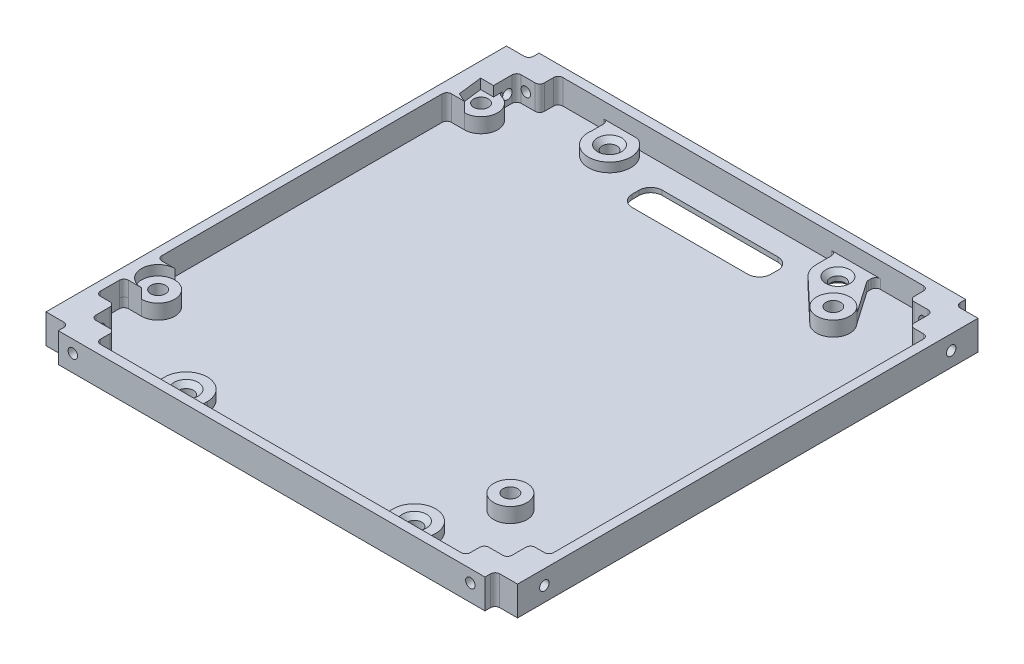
ISO-10303-21;
HEADER;
FILE_DESCRIPTION(('STEP AP214'),'2;1');
FILE_NAME('part.step','',(''),(''),'','','');
FILE_SCHEMA(('AUTOMOTIVE_DESIGN { 1 0 10303 214 1 1 1 1 }'));
ENDSEC;
DATA;
#1=APPLICATION_CONTEXT('core data for automotive mechanical design processes');
#2=APPLICATION_PROTOCOL_DEFINITION('international standard','automotive_design',2000,#1);
#3=PRODUCT_CONTEXT('',#1,'mechanical');
#4=PRODUCT('Part','Part','',(#3));
#5=PRODUCT_RELATED_PRODUCT_CATEGORY('part','',(#4));
#6=PRODUCT_DEFINITION_FORMATION('','',#4);
#7=PRODUCT_DEFINITION_CONTEXT('part definition',#1,'design');
#8=PRODUCT_DEFINITION('design','',#6,#7);
#9=PRODUCT_DEFINITION_SHAPE('','',#8);
#10=(LENGTH_UNIT() NAMED_UNIT(*) SI_UNIT(.MILLI.,.METRE.));
#11=(NAMED_UNIT(*) PLANE_ANGLE_UNIT() SI_UNIT($,.RADIAN.));
#12=(NAMED_UNIT(*) SI_UNIT($,.STERADIAN.) SOLID_ANGLE_UNIT());
#13=UNCERTAINTY_MEASURE_WITH_UNIT(LENGTH_MEASURE(1.E-05),#10,'distance_accuracy_value','');
#14=(GEOMETRIC_REPRESENTATION_CONTEXT(3) GLOBAL_UNCERTAINTY_ASSIGNED_CONTEXT((#13)) GLOBAL_UNIT_ASSIGNED_CONTEXT((#10,
#11,#12)) REPRESENTATION_CONTEXT('',''));
#15=CARTESIAN_POINT('',(0.,0.,0.));
#16=DIRECTION('',(0.,0.,1.));
#17=DIRECTION('',(1.,0.,0.));
#18=AXIS2_PLACEMENT_3D('',#15,#16,#17);
#19=CARTESIAN_POINT('',(-49.,-140.014284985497,50.));
#20=DIRECTION('',(-1.,0.,0.));
#21=DIRECTION('',(0.,0.,1.));
#22=AXIS2_PLACEMENT_3D('',#19,#20,#21);
#23=PLANE('',#22);
#24=DIRECTION('',(0.,0.,1.));
#25=VECTOR('',#24,1.);
#26=CARTESIAN_POINT('',(-49.,6.35,50.));
#27=LINE('',#26,#25);
#28=CARTESIAN_POINT('',(-49.,6.35,-33.9));
#29=VERTEX_POINT('',#28);
#30=CARTESIAN_POINT('',(-49.,6.35,26.75));
#31=VERTEX_POINT('',#30);
#32=EDGE_CURVE('E1128',#29,#31,#27,.T.);
#33=ORIENTED_EDGE('',*,*,#32,.T.);
#34=DIRECTION('',(0.,-1.,0.));
#35=VECTOR('',#34,1.);
#36=CARTESIAN_POINT('',(-49.,3.,26.75));
#37=LINE('',#36,#35);
#38=CARTESIAN_POINT('',(-49.,3.,26.75));
#39=VERTEX_POINT('',#38);
#40=EDGE_CURVE('E2029',#31,#39,#37,.T.);
#41=ORIENTED_EDGE('',*,*,#40,.T.);
#42=DIRECTION('',(0.,-1.,0.));
#43=VECTOR('',#42,1.);
#44=CARTESIAN_POINT('',(-49.,1.,26.75));
#45=LINE('',#44,#43);
#46=CARTESIAN_POINT('',(-49.,1.,26.75));
#47=VERTEX_POINT('',#46);
#48=EDGE_CURVE('E2079',#39,#47,#45,.T.);
#49=ORIENTED_EDGE('',*,*,#48,.T.);
#50=DIRECTION('',(0.,0.,1.));
#51=VECTOR('',#50,1.);
#52=CARTESIAN_POINT('',(-49.,1.,50.));
#53=LINE('',#52,#51);
#54=CARTESIAN_POINT('',(-49.,1.,-33.9));
#55=VERTEX_POINT('',#54);
#56=EDGE_CURVE('E1151',#55,#47,#53,.T.);
#57=ORIENTED_EDGE('',*,*,#56,.F.);
#58=DIRECTION('',(0.,-1.,0.));
#59=VECTOR('',#58,1.);
#60=CARTESIAN_POINT('',(-49.,6.35,-33.9));
#61=LINE('',#60,#59);
#62=EDGE_CURVE('E2033',#55,#29,#61,.F.);
#63=ORIENTED_EDGE('',*,*,#62,.T.);
#64=EDGE_LOOP('',(#33,#41,#49,#57,#63));
#65=FACE_BOUND('',#64,.T.);
#66=ADVANCED_FACE('F41',(#65),#23,.F.);
#67=CARTESIAN_POINT('',(-45.2,4.2,31.35));
#68=DIRECTION('',(0.,-1.,0.));
#69=DIRECTION('',(0.,0.,-1.));
#70=AXIS2_PLACEMENT_3D('',#67,#68,#69);
#71=CYLINDRICAL_SURFACE('',#70,3.6);
#72=DIRECTION('',(0.,-1.,0.));
#73=VECTOR('',#72,1.);
#74=CARTESIAN_POINT('',(-45.2,11.141252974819,27.75));
#75=LINE('',#74,#73);
#76=CARTESIAN_POINT('',(-45.2,4.2,27.75));
#77=VERTEX_POINT('',#76);
#78=CARTESIAN_POINT('',(-45.2,1.,27.75));
#79=VERTEX_POINT('',#78);
#80=EDGE_CURVE('E836',#77,#79,#75,.T.);
#81=ORIENTED_EDGE('',*,*,#80,.F.);
#82=CARTESIAN_POINT('',(-45.2,4.2,31.35));
#83=DIRECTION('',(0.,1.,0.));
#84=DIRECTION('',(0.,0.,1.));
#85=AXIS2_PLACEMENT_3D('',#82,#83,#84);
#86=CIRCLE('',#85,3.6);
#87=CARTESIAN_POINT('',(-45.2,4.2,34.95));
#88=VERTEX_POINT('',#87);
#89=EDGE_CURVE('E942',#88,#77,#86,.T.);
#90=ORIENTED_EDGE('',*,*,#89,.F.);
#91=DIRECTION('',(0.,-1.,0.));
#92=VECTOR('',#91,1.);
#93=CARTESIAN_POINT('',(-45.2,11.141252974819,34.95));
#94=LINE('',#93,#92);
#95=CARTESIAN_POINT('',(-45.2,1.,34.95));
#96=VERTEX_POINT('',#95);
#97=EDGE_CURVE('E840',#88,#96,#94,.T.);
#98=ORIENTED_EDGE('',*,*,#97,.T.);
#99=CARTESIAN_POINT('',(-45.2,1.,31.35));
#100=DIRECTION('',(0.,-1.,0.));
#101=DIRECTION('',(0.,0.,-1.));
#102=AXIS2_PLACEMENT_3D('',#99,#100,#101);
#103=CIRCLE('',#102,3.6);
#104=EDGE_CURVE('E1242',#96,#79,#103,.F.);
#105=ORIENTED_EDGE('',*,*,#104,.T.);
#106=EDGE_LOOP('',(#81,#90,#98,#105));
#107=FACE_BOUND('',#106,.T.);
#108=ADVANCED_FACE('F1604',(#107),#71,.T.);
#109=CARTESIAN_POINT('',(0.,1.,0.));
#110=DIRECTION('',(0.,-1.,0.));
#111=DIRECTION('',(0.,0.,-1.));
#112=AXIS2_PLACEMENT_3D('',#109,#110,#111);
#113=PLANE('',#112);
#114=DIRECTION('',(-1.,0.,0.));
#115=VECTOR('',#114,1.);
#116=CARTESIAN_POINT('',(-15.,1.,-45.));
#117=LINE('',#116,#115);
#118=CARTESIAN_POINT('',(12.5,1.,-45.));
#119=VERTEX_POINT('',#118);
#120=CARTESIAN_POINT('',(-12.5,1.,-45.));
#121=VERTEX_POINT('',#120);
#122=EDGE_CURVE('E976',#119,#121,#117,.T.);
#123=ORIENTED_EDGE('',*,*,#122,.F.);
#124=CARTESIAN_POINT('',(12.5,1.,-42.5));
#125=DIRECTION('',(0.,-1.,0.));
#126=DIRECTION('',(0.,0.,-1.));
#127=AXIS2_PLACEMENT_3D('',#124,#125,#126);
#128=CIRCLE('',#127,2.5);
#129=CARTESIAN_POINT('',(15.,1.,-42.5));
#130=VERTEX_POINT('',#129);
#131=EDGE_CURVE('E1228',#119,#130,#128,.T.);
#132=ORIENTED_EDGE('',*,*,#131,.T.);
#133=DIRECTION('',(0.,0.,-1.));
#134=VECTOR('',#133,1.);
#135=CARTESIAN_POINT('',(15.,1.,-38.5));
#136=LINE('',#135,#134);
#137=CARTESIAN_POINT('',(15.,1.,-41.));
#138=VERTEX_POINT('',#137);
#139=EDGE_CURVE('E959',#138,#130,#136,.T.);
#140=ORIENTED_EDGE('',*,*,#139,.F.);
#141=CARTESIAN_POINT('',(12.5,1.,-41.));
#142=DIRECTION('',(0.,-1.,0.));
#143=DIRECTION('',(0.,0.,-1.));
#144=AXIS2_PLACEMENT_3D('',#141,#142,#143);
#145=CIRCLE('',#144,2.5);
#146=CARTESIAN_POINT('',(12.5,1.,-38.5));
#147=VERTEX_POINT('',#146);
#148=EDGE_CURVE('E1220',#138,#147,#145,.T.);
#149=ORIENTED_EDGE('',*,*,#148,.T.);
#150=DIRECTION('',(1.,0.,0.));
#151=VECTOR('',#150,1.);
#152=CARTESIAN_POINT('',(-15.,1.,-38.5));
#153=LINE('',#152,#151);
#154=CARTESIAN_POINT('',(-12.5,1.,-38.5));
#155=VERTEX_POINT('',#154);
#156=EDGE_CURVE('E964',#155,#147,#153,.T.);
#157=ORIENTED_EDGE('',*,*,#156,.F.);
#158=CARTESIAN_POINT('',(-12.5,1.,-41.));
#159=DIRECTION('',(0.,-1.,0.));
#160=DIRECTION('',(0.,0.,-1.));
#161=AXIS2_PLACEMENT_3D('',#158,#159,#160);
#162=CIRCLE('',#161,2.5);
#163=CARTESIAN_POINT('',(-15.,1.,-41.));
#164=VERTEX_POINT('',#163);
#165=EDGE_CURVE('E1224',#155,#164,#162,.T.);
#166=ORIENTED_EDGE('',*,*,#165,.T.);
#167=DIRECTION('',(0.,0.,1.));
#168=VECTOR('',#167,1.);
#169=CARTESIAN_POINT('',(-15.,1.,-38.5));
#170=LINE('',#169,#168);
#171=CARTESIAN_POINT('',(-15.,1.,-42.5));
#172=VERTEX_POINT('',#171);
#173=EDGE_CURVE('E979',#172,#164,#170,.T.);
#174=ORIENTED_EDGE('',*,*,#173,.F.);
#175=CARTESIAN_POINT('',(-12.5,1.,-42.5));
#176=DIRECTION('',(0.,-1.,0.));
#177=DIRECTION('',(0.,0.,-1.));
#178=AXIS2_PLACEMENT_3D('',#175,#176,#177);
#179=CIRCLE('',#178,2.5);
#180=EDGE_CURVE('E1232',#172,#121,#179,.T.);
#181=ORIENTED_EDGE('',*,*,#180,.T.);
#182=EDGE_LOOP('',(#123,#132,#140,#149,#157,#166,#174,#181));
#183=FACE_BOUND('',#182,.T.);
#184=CARTESIAN_POINT('',(31.,1.,31.35));
#185=DIRECTION('',(0.,-1.,0.));
#186=DIRECTION('',(0.,0.,-1.));
#187=AXIS2_PLACEMENT_3D('',#184,#185,#186);
#188=CIRCLE('',#187,3.6);
#189=CARTESIAN_POINT('',(31.,1.,27.75));
#190=VERTEX_POINT('',#189);
#191=EDGE_CURVE('E1244',#190,#190,#188,.F.);
#192=ORIENTED_EDGE('',*,*,#191,.F.);
#193=EDGE_LOOP('',(#192));
#194=FACE_BOUND('',#193,.T.);
#195=DIRECTION('',(1.,0.,0.));
#196=VECTOR('',#195,1.);
#197=CARTESIAN_POINT('',(-45.2,1.,-34.9));
#198=LINE('',#197,#196);
#199=CARTESIAN_POINT('',(-48.,1.,-34.9));
#200=VERTEX_POINT('',#199);
#201=CARTESIAN_POINT('',(-45.2,1.,-34.9));
#202=VERTEX_POINT('',#201);
#203=EDGE_CURVE('E759',#200,#202,#198,.T.);
#204=ORIENTED_EDGE('',*,*,#203,.F.);
#205=CARTESIAN_POINT('',(-48.,1.,-33.9));
#206=DIRECTION('',(0.,-1.,0.));
#207=DIRECTION('',(0.,0.,-1.));
#208=AXIS2_PLACEMENT_3D('',#205,#206,#207);
#209=CIRCLE('',#208,1.);
#210=EDGE_CURVE('E2075',#200,#55,#209,.F.);
#211=ORIENTED_EDGE('',*,*,#210,.T.);
#212=ORIENTED_EDGE('',*,*,#56,.T.);
#213=CARTESIAN_POINT('',(-48.,1.,26.75));
#214=DIRECTION('',(0.,-1.,0.));
#215=DIRECTION('',(0.,0.,-1.));
#216=AXIS2_PLACEMENT_3D('',#213,#214,#215);
#217=CIRCLE('',#216,1.);
#218=CARTESIAN_POINT('',(-48.,1.,27.75));
#219=VERTEX_POINT('',#218);
#220=EDGE_CURVE('E2059',#47,#219,#217,.F.);
#221=ORIENTED_EDGE('',*,*,#220,.T.);
#222=DIRECTION('',(-1.,0.,0.));
#223=VECTOR('',#222,1.);
#224=CARTESIAN_POINT('',(0.,1.,27.75));
#225=LINE('',#224,#223);
#226=EDGE_CURVE('E837',#79,#219,#225,.T.);
#227=ORIENTED_EDGE('',*,*,#226,.F.);
#228=ORIENTED_EDGE('',*,*,#104,.F.);
#229=DIRECTION('',(-1.,0.,0.));
#230=VECTOR('',#229,1.);
#231=CARTESIAN_POINT('',(0.,1.,34.95));
#232=LINE('',#231,#230);
#233=CARTESIAN_POINT('',(-48.,1.,34.95));
#234=VERTEX_POINT('',#233);
#235=EDGE_CURVE('E828',#96,#234,#232,.T.);
#236=ORIENTED_EDGE('',*,*,#235,.T.);
#237=CARTESIAN_POINT('',(-48.,1.,35.95));
#238=DIRECTION('',(0.,-1.,0.));
#239=DIRECTION('',(0.,0.,-1.));
#240=AXIS2_PLACEMENT_3D('',#237,#238,#239);
#241=CIRCLE('',#240,1.);
#242=CARTESIAN_POINT('',(-49.,1.,35.95));
#243=VERTEX_POINT('',#242);
#244=EDGE_CURVE('E2058',#234,#243,#241,.F.);
#245=ORIENTED_EDGE('',*,*,#244,.T.);
#246=CARTESIAN_POINT('',(-49.,1.,40.));
#247=VERTEX_POINT('',#246);
#248=EDGE_CURVE('E1140',#243,#247,#53,.T.);
#249=ORIENTED_EDGE('',*,*,#248,.T.);
#250=CARTESIAN_POINT('',(-48.,1.,40.));
#251=DIRECTION('',(0.,-1.,0.));
#252=DIRECTION('',(0.,0.,-1.));
#253=AXIS2_PLACEMENT_3D('',#250,#251,#252);
#254=CIRCLE('',#253,1.);
#255=CARTESIAN_POINT('',(-48.,1.,41.));
#256=VERTEX_POINT('',#255);
#257=EDGE_CURVE('E1326',#247,#256,#254,.F.);
#258=ORIENTED_EDGE('',*,*,#257,.T.);
#259=DIRECTION('',(1.,0.,0.));
#260=VECTOR('',#259,1.);
#261=CARTESIAN_POINT('',(0.,1.,41.));
#262=LINE('',#261,#260);
#263=CARTESIAN_POINT('',(-46.,1.,41.));
#264=VERTEX_POINT('',#263);
#265=EDGE_CURVE('E1067',#256,#264,#262,.T.);
#266=ORIENTED_EDGE('',*,*,#265,.T.);
#267=CARTESIAN_POINT('',(-46.,1.,42.));
#268=DIRECTION('',(0.,-1.,0.));
#269=DIRECTION('',(0.,0.,-1.));
#270=AXIS2_PLACEMENT_3D('',#267,#268,#269);
#271=CIRCLE('',#270,1.);
#272=CARTESIAN_POINT('',(-45.,1.,42.));
#273=VERTEX_POINT('',#272);
#274=EDGE_CURVE('E1497',#264,#273,#271,.T.);
#275=ORIENTED_EDGE('',*,*,#274,.T.);
#276=DIRECTION('',(0.,0.,1.));
#277=VECTOR('',#276,1.);
#278=CARTESIAN_POINT('',(-45.0000000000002,1.,1.87350135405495E-13));
#279=LINE('',#278,#277);
#280=CARTESIAN_POINT('',(-45.,1.,45.));
#281=VERTEX_POINT('',#280);
#282=EDGE_CURVE('E1197',#273,#281,#279,.T.);
#283=ORIENTED_EDGE('',*,*,#282,.T.);
#284=CARTESIAN_POINT('',(-44.,1.,45.));
#285=DIRECTION('',(0.,-1.,0.));
#286=DIRECTION('',(0.,0.,-1.));
#287=AXIS2_PLACEMENT_3D('',#284,#285,#286);
#288=CIRCLE('',#287,1.);
#289=CARTESIAN_POINT('',(-44.,1.,46.));
#290=VERTEX_POINT('',#289);
#291=EDGE_CURVE('E1324',#281,#290,#288,.F.);
#292=ORIENTED_EDGE('',*,*,#291,.T.);
#293=DIRECTION('',(1.,0.,0.));
#294=VECTOR('',#293,1.);
#295=CARTESIAN_POINT('',(0.,1.,46.));
#296=LINE('',#295,#294);
#297=CARTESIAN_POINT('',(-41.,1.,46.));
#298=VERTEX_POINT('',#297);
#299=EDGE_CURVE('E1194',#290,#298,#296,.T.);
#300=ORIENTED_EDGE('',*,*,#299,.T.);
#301=CARTESIAN_POINT('',(-41.,1.,47.));
#302=DIRECTION('',(0.,-1.,0.));
#303=DIRECTION('',(0.,0.,-1.));
#304=AXIS2_PLACEMENT_3D('',#301,#302,#303);
#305=CIRCLE('',#304,1.);
#306=CARTESIAN_POINT('',(-40.,1.,47.));
#307=VERTEX_POINT('',#306);
#308=EDGE_CURVE('E1501',#298,#307,#305,.T.);
#309=ORIENTED_EDGE('',*,*,#308,.T.);
#310=DIRECTION('',(0.,0.,1.));
#311=VECTOR('',#310,1.);
#312=CARTESIAN_POINT('',(-40.,1.,0.));
#313=LINE('',#312,#311);
#314=CARTESIAN_POINT('',(-40.,1.,49.));
#315=VERTEX_POINT('',#314);
#316=EDGE_CURVE('E1064',#307,#315,#313,.T.);
#317=ORIENTED_EDGE('',*,*,#316,.T.);
#318=CARTESIAN_POINT('',(-39.,1.,49.));
#319=DIRECTION('',(0.,-1.,0.));
#320=DIRECTION('',(0.,0.,-1.));
#321=AXIS2_PLACEMENT_3D('',#318,#319,#320);
#322=CIRCLE('',#321,1.);
#323=CARTESIAN_POINT('',(-39.,1.,50.));
#324=VERTEX_POINT('',#323);
#325=EDGE_CURVE('E1322',#315,#324,#322,.F.);
#326=ORIENTED_EDGE('',*,*,#325,.T.);
#327=DIRECTION('',(1.,0.,0.));
#328=VECTOR('',#327,1.);
#329=CARTESIAN_POINT('',(-49.,1.,50.));
#330=LINE('',#329,#328);
#331=CARTESIAN_POINT('',(-30.3,1.,50.));
#332=VERTEX_POINT('',#331);
#333=EDGE_CURVE('E1146',#324,#332,#330,.T.);
#334=ORIENTED_EDGE('',*,*,#333,.T.);
#335=CARTESIAN_POINT('',(-30.3,1.,49.));
#336=DIRECTION('',(0.,-1.,0.));
#337=DIRECTION('',(0.,0.,-1.));
#338=AXIS2_PLACEMENT_3D('',#335,#336,#337);
#339=CIRCLE('',#338,1.);
#340=CARTESIAN_POINT('',(-29.3,1.,49.));
#341=VERTEX_POINT('',#340);
#342=EDGE_CURVE('E2268',#332,#341,#339,.F.);
#343=ORIENTED_EDGE('',*,*,#342,.T.);
#344=DIRECTION('',(0.,0.,1.));
#345=VECTOR('',#344,1.);
#346=CARTESIAN_POINT('',(-29.3,1.,0.));
#347=LINE('',#346,#345);
#348=CARTESIAN_POINT('',(-29.3,1.,45.8));
#349=VERTEX_POINT('',#348);
#350=EDGE_CURVE('E825',#349,#341,#347,.T.);
#351=ORIENTED_EDGE('',*,*,#350,.F.);
#352=CARTESIAN_POINT('',(-24.7,1.,45.8));
#353=DIRECTION('',(0.,1.,0.));
#354=DIRECTION('',(0.,0.,1.));
#355=AXIS2_PLACEMENT_3D('',#352,#353,#354);
#356=CIRCLE('',#355,4.6);
#357=CARTESIAN_POINT('',(-20.1,1.,45.8));
#358=VERTEX_POINT('',#357);
#359=EDGE_CURVE('E914',#358,#349,#356,.T.);
#360=ORIENTED_EDGE('',*,*,#359,.F.);
#361=DIRECTION('',(0.,0.,1.));
#362=VECTOR('',#361,1.);
#363=CARTESIAN_POINT('',(-20.1,1.,0.));
#364=LINE('',#363,#362);
#365=CARTESIAN_POINT('',(-20.1,1.,49.));
#366=VERTEX_POINT('',#365);
#367=EDGE_CURVE('E815',#358,#366,#364,.T.);
#368=ORIENTED_EDGE('',*,*,#367,.T.);
#369=CARTESIAN_POINT('',(-19.1,1.,49.));
#370=DIRECTION('',(0.,-1.,0.));
#371=DIRECTION('',(0.,0.,-1.));
#372=AXIS2_PLACEMENT_3D('',#369,#370,#371);
#373=CIRCLE('',#372,1.);
#374=CARTESIAN_POINT('',(-19.1,1.,50.));
#375=VERTEX_POINT('',#374);
#376=EDGE_CURVE('E2270',#366,#375,#373,.F.);
#377=ORIENTED_EDGE('',*,*,#376,.T.);
#378=CARTESIAN_POINT('',(19.1,1.,50.));
#379=VERTEX_POINT('',#378);
#380=EDGE_CURVE('E1149',#375,#379,#330,.T.);
#381=ORIENTED_EDGE('',*,*,#380,.T.);
#382=CARTESIAN_POINT('',(19.1,1.,49.));
#383=DIRECTION('',(0.,-1.,0.));
#384=DIRECTION('',(0.,0.,-1.));
#385=AXIS2_PLACEMENT_3D('',#382,#383,#384);
#386=CIRCLE('',#385,1.);
#387=CARTESIAN_POINT('',(20.1,1.,49.));
#388=VERTEX_POINT('',#387);
#389=EDGE_CURVE('E2264',#379,#388,#386,.F.);
#390=ORIENTED_EDGE('',*,*,#389,.T.);
#391=DIRECTION('',(0.,0.,1.));
#392=VECTOR('',#391,1.);
#393=CARTESIAN_POINT('',(20.1,1.,0.));
#394=LINE('',#393,#392);
#395=CARTESIAN_POINT('',(20.1,1.,45.8));
#396=VERTEX_POINT('',#395);
#397=EDGE_CURVE('E799',#396,#388,#394,.T.);
#398=ORIENTED_EDGE('',*,*,#397,.F.);
#399=CARTESIAN_POINT('',(24.7,1.,45.8));
#400=DIRECTION('',(0.,1.,0.));
#401=DIRECTION('',(0.,0.,1.));
#402=AXIS2_PLACEMENT_3D('',#399,#400,#401);
#403=CIRCLE('',#402,4.6);
#404=CARTESIAN_POINT('',(29.2319740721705,1.,46.5881694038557));
#405=VERTEX_POINT('',#404);
#406=EDGE_CURVE('E917',#405,#396,#403,.T.);
#407=ORIENTED_EDGE('',*,*,#406,.F.);
#408=DIRECTION('',(0.,0.,1.));
#409=VECTOR('',#408,1.);
#410=CARTESIAN_POINT('',(29.2319740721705,1.,0.));
#411=LINE('',#410,#409);
#412=CARTESIAN_POINT('',(29.2319740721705,1.,49.));
#413=VERTEX_POINT('',#412);
#414=EDGE_CURVE('E805',#405,#413,#411,.T.);
#415=ORIENTED_EDGE('',*,*,#414,.T.);
#416=CARTESIAN_POINT('',(30.2319740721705,1.,49.));
#417=DIRECTION('',(0.,-1.,0.));
#418=DIRECTION('',(0.,0.,-1.));
#419=AXIS2_PLACEMENT_3D('',#416,#417,#418);
#420=CIRCLE('',#419,1.);
#421=CARTESIAN_POINT('',(30.2319740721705,1.,50.));
#422=VERTEX_POINT('',#421);
#423=EDGE_CURVE('E2266',#413,#422,#420,.F.);
#424=ORIENTED_EDGE('',*,*,#423,.T.);
#425=CARTESIAN_POINT('',(39.,1.,50.));
#426=VERTEX_POINT('',#425);
#427=EDGE_CURVE('E1150',#422,#426,#330,.T.);
#428=ORIENTED_EDGE('',*,*,#427,.T.);
#429=CARTESIAN_POINT('',(39.,1.,49.));
#430=DIRECTION('',(0.,-1.,0.));
#431=DIRECTION('',(0.,0.,-1.));
#432=AXIS2_PLACEMENT_3D('',#429,#430,#431);
#433=CIRCLE('',#432,1.);
#434=CARTESIAN_POINT('',(40.,1.,49.));
#435=VERTEX_POINT('',#434);
#436=EDGE_CURVE('E1343',#426,#435,#433,.F.);
#437=ORIENTED_EDGE('',*,*,#436,.T.);
#438=DIRECTION('',(0.,0.,-1.));
#439=VECTOR('',#438,1.);
#440=CARTESIAN_POINT('',(40.,1.,0.));
#441=LINE('',#440,#439);
#442=CARTESIAN_POINT('',(40.,1.,47.));
#443=VERTEX_POINT('',#442);
#444=EDGE_CURVE('E1085',#435,#443,#441,.T.);
#445=ORIENTED_EDGE('',*,*,#444,.T.);
#446=CARTESIAN_POINT('',(41.,1.,47.));
#447=DIRECTION('',(0.,-1.,0.));
#448=DIRECTION('',(0.,0.,-1.));
#449=AXIS2_PLACEMENT_3D('',#446,#447,#448);
#450=CIRCLE('',#449,1.);
#451=CARTESIAN_POINT('',(41.,1.,46.));
#452=VERTEX_POINT('',#451);
#453=EDGE_CURVE('E1469',#443,#452,#450,.T.);
#454=ORIENTED_EDGE('',*,*,#453,.T.);
#455=DIRECTION('',(1.,0.,0.));
#456=VECTOR('',#455,1.);
#457=CARTESIAN_POINT('',(0.,1.,46.));
#458=LINE('',#457,#456);
#459=CARTESIAN_POINT('',(44.,1.,46.));
#460=VERTEX_POINT('',#459);
#461=EDGE_CURVE('E1191',#452,#460,#458,.T.);
#462=ORIENTED_EDGE('',*,*,#461,.T.);
#463=CARTESIAN_POINT('',(44.,1.,45.));
#464=DIRECTION('',(0.,-1.,0.));
#465=DIRECTION('',(0.,0.,-1.));
#466=AXIS2_PLACEMENT_3D('',#463,#464,#465);
#467=CIRCLE('',#466,1.);
#468=CARTESIAN_POINT('',(45.,1.,45.));
#469=VERTEX_POINT('',#468);
#470=EDGE_CURVE('E1345',#460,#469,#467,.F.);
#471=ORIENTED_EDGE('',*,*,#470,.T.);
#472=DIRECTION('',(0.,0.,-1.));
#473=VECTOR('',#472,1.);
#474=CARTESIAN_POINT('',(45.0000000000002,1.,1.87350135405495E-13));
#475=LINE('',#474,#473);
#476=CARTESIAN_POINT('',(45.,1.,42.));
#477=VERTEX_POINT('',#476);
#478=EDGE_CURVE('E1188',#469,#477,#475,.T.);
#479=ORIENTED_EDGE('',*,*,#478,.T.);
#480=CARTESIAN_POINT('',(46.,1.,42.));
#481=DIRECTION('',(0.,-1.,0.));
#482=DIRECTION('',(0.,0.,-1.));
#483=AXIS2_PLACEMENT_3D('',#480,#481,#482);
#484=CIRCLE('',#483,1.);
#485=CARTESIAN_POINT('',(46.,1.,41.));
#486=VERTEX_POINT('',#485);
#487=EDGE_CURVE('E1471',#477,#486,#484,.T.);
#488=ORIENTED_EDGE('',*,*,#487,.T.);
#489=DIRECTION('',(1.,0.,0.));
#490=VECTOR('',#489,1.);
#491=CARTESIAN_POINT('',(0.,1.,41.));
#492=LINE('',#491,#490);
#493=CARTESIAN_POINT('',(48.,1.,41.));
#494=VERTEX_POINT('',#493);
#495=EDGE_CURVE('E1082',#486,#494,#492,.T.);
#496=ORIENTED_EDGE('',*,*,#495,.T.);
#497=CARTESIAN_POINT('',(48.,1.,40.));
#498=DIRECTION('',(0.,-1.,0.));
#499=DIRECTION('',(0.,0.,-1.));
#500=AXIS2_PLACEMENT_3D('',#497,#498,#499);
#501=CIRCLE('',#500,1.);
#502=CARTESIAN_POINT('',(49.,1.,40.));
#503=VERTEX_POINT('',#502);
#504=EDGE_CURVE('E1341',#494,#503,#501,.F.);
#505=ORIENTED_EDGE('',*,*,#504,.T.);
#506=DIRECTION('',(0.,0.,-1.));
#507=VECTOR('',#506,1.);
#508=CARTESIAN_POINT('',(49.,1.,50.));
#509=LINE('',#508,#507);
#510=CARTESIAN_POINT('',(49.,1.,-40.));
#511=VERTEX_POINT('',#510);
#512=EDGE_CURVE('E1142',#503,#511,#509,.T.);
#513=ORIENTED_EDGE('',*,*,#512,.T.);
#514=CARTESIAN_POINT('',(48.,1.,-40.));
#515=DIRECTION('',(0.,-1.,0.));
#516=DIRECTION('',(0.,0.,-1.));
#517=AXIS2_PLACEMENT_3D('',#514,#515,#516);
#518=CIRCLE('',#517,1.);
#519=CARTESIAN_POINT('',(48.,1.,-41.));
#520=VERTEX_POINT('',#519);
#521=EDGE_CURVE('E1339',#511,#520,#518,.F.);
#522=ORIENTED_EDGE('',*,*,#521,.T.);
#523=DIRECTION('',(-1.,0.,0.));
#524=VECTOR('',#523,1.);
#525=CARTESIAN_POINT('',(0.,1.,-41.));
#526=LINE('',#525,#524);
#527=CARTESIAN_POINT('',(46.,1.,-41.));
#528=VERTEX_POINT('',#527);
#529=EDGE_CURVE('E1100',#520,#528,#526,.T.);
#530=ORIENTED_EDGE('',*,*,#529,.T.);
#531=CARTESIAN_POINT('',(46.,1.,-42.));
#532=DIRECTION('',(0.,-1.,0.));
#533=DIRECTION('',(0.,0.,-1.));
#534=AXIS2_PLACEMENT_3D('',#531,#532,#533);
#535=CIRCLE('',#534,1.);
#536=CARTESIAN_POINT('',(45.,1.,-42.));
#537=VERTEX_POINT('',#536);
#538=EDGE_CURVE('E1477',#528,#537,#535,.T.);
#539=ORIENTED_EDGE('',*,*,#538,.T.);
#540=DIRECTION('',(0.,0.,-1.));
#541=VECTOR('',#540,1.);
#542=CARTESIAN_POINT('',(45.,1.,0.));
#543=LINE('',#542,#541);
#544=CARTESIAN_POINT('',(45.,1.,-45.));
#545=VERTEX_POINT('',#544);
#546=EDGE_CURVE('E1185',#537,#545,#543,.T.);
#547=ORIENTED_EDGE('',*,*,#546,.T.);
#548=CARTESIAN_POINT('',(44.,1.,-45.));
#549=DIRECTION('',(0.,-1.,0.));
#550=DIRECTION('',(0.,0.,-1.));
#551=AXIS2_PLACEMENT_3D('',#548,#549,#550);
#552=CIRCLE('',#551,1.);
#553=CARTESIAN_POINT('',(44.,1.,-46.));
#554=VERTEX_POINT('',#553);
#555=EDGE_CURVE('E1337',#545,#554,#552,.F.);
#556=ORIENTED_EDGE('',*,*,#555,.T.);
#557=DIRECTION('',(-1.,0.,0.));
#558=VECTOR('',#557,1.);
#559=CARTESIAN_POINT('',(0.,1.,-46.));
#560=LINE('',#559,#558);
#561=CARTESIAN_POINT('',(41.,1.,-46.));
#562=VERTEX_POINT('',#561);
#563=EDGE_CURVE('E1182',#554,#562,#560,.T.);
#564=ORIENTED_EDGE('',*,*,#563,.T.);
#565=CARTESIAN_POINT('',(41.,1.,-47.));
#566=DIRECTION('',(0.,-1.,0.));
#567=DIRECTION('',(0.,0.,-1.));
#568=AXIS2_PLACEMENT_3D('',#565,#566,#567);
#569=CIRCLE('',#568,1.);
#570=CARTESIAN_POINT('',(40.,1.,-47.));
#571=VERTEX_POINT('',#570);
#572=EDGE_CURVE('E1481',#562,#571,#569,.T.);
#573=ORIENTED_EDGE('',*,*,#572,.T.);
#574=DIRECTION('',(0.,0.,-1.));
#575=VECTOR('',#574,1.);
#576=CARTESIAN_POINT('',(40.,1.,0.));
#577=LINE('',#576,#575);
#578=CARTESIAN_POINT('',(40.,1.,-49.));
#579=VERTEX_POINT('',#578);
#580=EDGE_CURVE('E1103',#571,#579,#577,.T.);
#581=ORIENTED_EDGE('',*,*,#580,.T.);
#582=CARTESIAN_POINT('',(39.,1.,-49.));
#583=DIRECTION('',(0.,-1.,0.));
#584=DIRECTION('',(0.,0.,-1.));
#585=AXIS2_PLACEMENT_3D('',#582,#583,#584);
#586=CIRCLE('',#585,1.);
#587=CARTESIAN_POINT('',(39.,1.,-50.));
#588=VERTEX_POINT('',#587);
#589=EDGE_CURVE('E1335',#579,#588,#586,.F.);
#590=ORIENTED_EDGE('',*,*,#589,.T.);
#591=DIRECTION('',(-1.,0.,0.));
#592=VECTOR('',#591,1.);
#593=CARTESIAN_POINT('',(-49.,1.,-50.));
#594=LINE('',#593,#592);
#595=CARTESIAN_POINT('',(29.6851159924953,1.,-50.));
#596=VERTEX_POINT('',#595);
#597=EDGE_CURVE('E1137',#588,#596,#594,.T.);
#598=ORIENTED_EDGE('',*,*,#597,.T.);
#599=CARTESIAN_POINT('',(29.6851159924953,1.,-49.));
#600=DIRECTION('',(0.,-1.,0.));
#601=DIRECTION('',(0.,0.,-1.));
#602=AXIS2_PLACEMENT_3D('',#599,#600,#601);
#603=CIRCLE('',#602,1.);
#604=CARTESIAN_POINT('',(28.6851159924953,1.,-49.));
#605=VERTEX_POINT('',#604);
#606=EDGE_CURVE('E2260',#596,#605,#603,.F.);
#607=ORIENTED_EDGE('',*,*,#606,.T.);
#608=DIRECTION('',(0.,0.,-1.));
#609=VECTOR('',#608,1.);
#610=CARTESIAN_POINT('',(28.6851159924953,1.,0.));
#611=LINE('',#610,#609);
#612=CARTESIAN_POINT('',(28.6851159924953,1.,-48.4102719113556));
#613=VERTEX_POINT('',#612);
#614=EDGE_CURVE('E784',#613,#605,#611,.T.);
#615=ORIENTED_EDGE('',*,*,#614,.F.);
#616=CARTESIAN_POINT('',(29.6851159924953,1.,-48.4102719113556));
#617=DIRECTION('',(0.,-1.,0.));
#618=DIRECTION('',(0.,0.,-1.));
#619=AXIS2_PLACEMENT_3D('',#616,#617,#618);
#620=CIRCLE('',#619,1.);
#621=CARTESIAN_POINT('',(28.8632563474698,1.,-47.8405818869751));
#622=VERTEX_POINT('',#621);
#623=EDGE_CURVE('E2258',#613,#622,#620,.F.);
#624=ORIENTED_EDGE('',*,*,#623,.T.);
#625=DIRECTION('',(0.569690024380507,0.,0.821859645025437));
#626=VECTOR('',#625,1.);
#627=CARTESIAN_POINT('',(41.8949922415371,1.,-29.0404320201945));
#628=LINE('',#627,#626);
#629=CARTESIAN_POINT('',(33.645292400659,1.,-40.941808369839));
#630=VERTEX_POINT('',#629);
#631=EDGE_CURVE('E892',#622,#630,#628,.T.);
#632=ORIENTED_EDGE('',*,*,#631,.T.);
#633=CARTESIAN_POINT('',(31.,1.,-38.5));
#634=DIRECTION('',(0.,-1.,0.));
#635=DIRECTION('',(0.,0.,-1.));
#636=AXIS2_PLACEMENT_3D('',#633,#634,#635);
#637=CIRCLE('',#636,3.6);
#638=CARTESIAN_POINT('',(28.354707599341,1.,-36.058191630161));
#639=VERTEX_POINT('',#638);
#640=EDGE_CURVE('E1236',#639,#630,#637,.F.);
#641=ORIENTED_EDGE('',*,*,#640,.F.);
#642=DIRECTION('',(-0.726408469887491,0.,-0.687263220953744));
#643=VECTOR('',#642,1.);
#644=CARTESIAN_POINT('',(31.3942687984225,1.,-33.1824286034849));
#645=LINE('',#644,#643);
#646=CARTESIAN_POINT('',(21.9754575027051,1.,-42.0936718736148));
#647=VERTEX_POINT('',#646);
#648=EDGE_CURVE('E897',#639,#647,#645,.T.);
#649=ORIENTED_EDGE('',*,*,#648,.T.);
#650=CARTESIAN_POINT('',(24.7,1.,-45.8));
#651=DIRECTION('',(0.,1.,0.));
#652=DIRECTION('',(0.,0.,1.));
#653=AXIS2_PLACEMENT_3D('',#650,#651,#652);
#654=CIRCLE('',#653,4.6);
#655=CARTESIAN_POINT('',(20.1,1.,-45.8));
#656=VERTEX_POINT('',#655);
#657=EDGE_CURVE('E922',#656,#647,#654,.T.);
#658=ORIENTED_EDGE('',*,*,#657,.F.);
#659=DIRECTION('',(0.,0.,-1.));
#660=VECTOR('',#659,1.);
#661=CARTESIAN_POINT('',(20.1,1.,0.));
#662=LINE('',#661,#660);
#663=CARTESIAN_POINT('',(20.1,1.,-49.));
#664=VERTEX_POINT('',#663);
#665=EDGE_CURVE('E787',#656,#664,#662,.T.);
#666=ORIENTED_EDGE('',*,*,#665,.T.);
#667=CARTESIAN_POINT('',(19.1,1.,-49.));
#668=DIRECTION('',(0.,-1.,0.));
#669=DIRECTION('',(0.,0.,-1.));
#670=AXIS2_PLACEMENT_3D('',#667,#668,#669);
#671=CIRCLE('',#670,1.);
#672=CARTESIAN_POINT('',(19.1,1.,-50.));
#673=VERTEX_POINT('',#672);
#674=EDGE_CURVE('E2262',#664,#673,#671,.F.);
#675=ORIENTED_EDGE('',*,*,#674,.T.);
#676=CARTESIAN_POINT('',(-22.8238336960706,1.,-50.));
#677=VERTEX_POINT('',#676);
#678=EDGE_CURVE('E1141',#673,#677,#594,.T.);
#679=ORIENTED_EDGE('',*,*,#678,.T.);
#680=CARTESIAN_POINT('',(-24.7,1.,-45.8));
#681=DIRECTION('',(0.,1.,0.));
#682=DIRECTION('',(0.,0.,1.));
#683=AXIS2_PLACEMENT_3D('',#680,#681,#682);
#684=CIRCLE('',#683,4.6);
#685=CARTESIAN_POINT('',(-29.2319740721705,1.,-46.5881694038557));
#686=VERTEX_POINT('',#685);
#687=EDGE_CURVE('E927',#686,#677,#684,.T.);
#688=ORIENTED_EDGE('',*,*,#687,.F.);
#689=DIRECTION('',(0.,0.,-1.));
#690=VECTOR('',#689,1.);
#691=CARTESIAN_POINT('',(-29.2319740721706,1.,0.));
#692=LINE('',#691,#690);
#693=CARTESIAN_POINT('',(-29.2319740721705,1.,-49.));
#694=VERTEX_POINT('',#693);
#695=EDGE_CURVE('E883',#686,#694,#692,.T.);
#696=ORIENTED_EDGE('',*,*,#695,.T.);
#697=CARTESIAN_POINT('',(-30.2319740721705,1.,-49.));
#698=DIRECTION('',(0.,-1.,0.));
#699=DIRECTION('',(0.,0.,-1.));
#700=AXIS2_PLACEMENT_3D('',#697,#698,#699);
#701=CIRCLE('',#700,1.);
#702=CARTESIAN_POINT('',(-30.2319740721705,1.,-50.));
#703=VERTEX_POINT('',#702);
#704=EDGE_CURVE('E1508',#694,#703,#701,.F.);
#705=ORIENTED_EDGE('',*,*,#704,.T.);
#706=CARTESIAN_POINT('',(-39.,1.,-50.));
#707=VERTEX_POINT('',#706);
#708=EDGE_CURVE('E1127',#703,#707,#594,.T.);
#709=ORIENTED_EDGE('',*,*,#708,.T.);
#710=CARTESIAN_POINT('',(-39.,1.,-49.));
#711=DIRECTION('',(0.,-1.,0.));
#712=DIRECTION('',(0.,0.,-1.));
#713=AXIS2_PLACEMENT_3D('',#710,#711,#712);
#714=CIRCLE('',#713,1.);
#715=CARTESIAN_POINT('',(-40.,1.,-49.));
#716=VERTEX_POINT('',#715);
#717=EDGE_CURVE('E1333',#707,#716,#714,.F.);
#718=ORIENTED_EDGE('',*,*,#717,.T.);
#719=DIRECTION('',(0.,0.,1.));
#720=VECTOR('',#719,1.);
#721=CARTESIAN_POINT('',(-40.,1.,0.));
#722=LINE('',#721,#720);
#723=CARTESIAN_POINT('',(-40.,1.,-47.));
#724=VERTEX_POINT('',#723);
#725=EDGE_CURVE('E1120',#716,#724,#722,.T.);
#726=ORIENTED_EDGE('',*,*,#725,.T.);
#727=CARTESIAN_POINT('',(-41.,1.,-47.));
#728=DIRECTION('',(0.,-1.,0.));
#729=DIRECTION('',(0.,0.,-1.));
#730=AXIS2_PLACEMENT_3D('',#727,#728,#729);
#731=CIRCLE('',#730,1.);
#732=CARTESIAN_POINT('',(-41.,1.,-46.));
#733=VERTEX_POINT('',#732);
#734=EDGE_CURVE('E1487',#724,#733,#731,.T.);
#735=ORIENTED_EDGE('',*,*,#734,.T.);
#736=DIRECTION('',(-1.,0.,0.));
#737=VECTOR('',#736,1.);
#738=CARTESIAN_POINT('',(0.,1.,-46.));
#739=LINE('',#738,#737);
#740=CARTESIAN_POINT('',(-44.,1.,-46.));
#741=VERTEX_POINT('',#740);
#742=EDGE_CURVE('E1179',#733,#741,#739,.T.);
#743=ORIENTED_EDGE('',*,*,#742,.T.);
#744=CARTESIAN_POINT('',(-44.,1.,-45.));
#745=DIRECTION('',(0.,-1.,0.));
#746=DIRECTION('',(0.,0.,-1.));
#747=AXIS2_PLACEMENT_3D('',#744,#745,#746);
#748=CIRCLE('',#747,1.);
#749=CARTESIAN_POINT('',(-45.,1.,-45.));
#750=VERTEX_POINT('',#749);
#751=EDGE_CURVE('E1331',#741,#750,#748,.F.);
#752=ORIENTED_EDGE('',*,*,#751,.T.);
#753=DIRECTION('',(0.,0.,1.));
#754=VECTOR('',#753,1.);
#755=CARTESIAN_POINT('',(-45.,1.,0.));
#756=LINE('',#755,#754);
#757=CARTESIAN_POINT('',(-45.,1.,-42.9407206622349));
#758=VERTEX_POINT('',#757);
#759=EDGE_CURVE('E1166',#750,#758,#756,.T.);
#760=ORIENTED_EDGE('',*,*,#759,.T.);
#761=CARTESIAN_POINT('',(-44.,1.,-42.9407206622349));
#762=DIRECTION('',(0.,-1.,0.));
#763=DIRECTION('',(0.,0.,-1.));
#764=AXIS2_PLACEMENT_3D('',#761,#762,#763);
#765=CIRCLE('',#764,1.);
#766=CARTESIAN_POINT('',(-44.2608695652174,1.,-41.9753466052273));
#767=VERTEX_POINT('',#766);
#768=EDGE_CURVE('E1328',#758,#767,#765,.F.);
#769=ORIENTED_EDGE('',*,*,#768,.T.);
#770=CARTESIAN_POINT('',(-45.2,1.,-38.5));
#771=DIRECTION('',(0.,1.,0.));
#772=DIRECTION('',(0.,0.,1.));
#773=AXIS2_PLACEMENT_3D('',#770,#771,#772);
#774=CIRCLE('',#773,3.6);
#775=EDGE_CURVE('E947',#202,#767,#774,.T.);
#776=ORIENTED_EDGE('',*,*,#775,.F.);
#777=EDGE_LOOP('',(#204,#211,#212,#221,#227,#228,#236,#245,#249,#258,#266,#275,#283,#292,#300,
#309,#317,#326,#334,#343,#351,#360,#368,#377,#381,#390,#398,#407,#415,#424,#428,#437,#445,#454,
#462,#471,#479,#488,#496,#505,#513,#522,#530,#539,#547,#556,#564,#573,#581,#590,#598,#607,#615,
#624,#632,#641,#649,#658,#666,#675,#679,#688,#696,#705,#709,#718,#726,#735,#743,#752,#760,#769,#776));
#778=FACE_BOUND('',#777,.T.);
#779=ADVANCED_FACE('F1607',(#183,#194,#778),#113,.F.);
#780=DIRECTION('',(0.,-1.,0.));
#781=VECTOR('',#780,1.);
#782=CARTESIAN_POINT('',(-49.,-140.014284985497,35.95));
#783=LINE('',#782,#781);
#784=CARTESIAN_POINT('',(-49.,3.,35.95));
#785=VERTEX_POINT('',#784);
#786=EDGE_CURVE('E2066',#243,#785,#783,.F.);
#787=ORIENTED_EDGE('',*,*,#786,.T.);
#788=DIRECTION('',(0.,1.,0.));
#789=VECTOR('',#788,1.);
#790=CARTESIAN_POINT('',(-49.,-140.014284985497,35.95));
#791=LINE('',#790,#789);
#792=CARTESIAN_POINT('',(-49.,6.35,35.95));
#793=VERTEX_POINT('',#792);
#794=EDGE_CURVE('E2040',#785,#793,#791,.T.);
#795=ORIENTED_EDGE('',*,*,#794,.T.);
#796=CARTESIAN_POINT('',(-49.,6.35,40.));
#797=VERTEX_POINT('',#796);
#798=EDGE_CURVE('E1131',#793,#797,#27,.T.);
#799=ORIENTED_EDGE('',*,*,#798,.T.);
#800=DIRECTION('',(0.,1.,0.));
#801=VECTOR('',#800,1.);
#802=CARTESIAN_POINT('',(-49.,-140.014284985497,40.));
#803=LINE('',#802,#801);
#804=EDGE_CURVE('E1442',#797,#247,#803,.F.);
#805=ORIENTED_EDGE('',*,*,#804,.T.);
#806=ORIENTED_EDGE('',*,*,#248,.F.);
#807=EDGE_LOOP('',(#787,#795,#799,#805,#806));
#808=FACE_BOUND('',#807,.T.);
#809=ADVANCED_FACE('F1770',(#808),#23,.F.);
#810=CARTESIAN_POINT('',(-49.,0.,-41.));
#811=DIRECTION('',(0.,0.,1.));
#812=DIRECTION('',(1.,0.,0.));
#813=AXIS2_PLACEMENT_3D('',#810,#811,#812);
#814=PLANE('',#813);
#815=DIRECTION('',(-1.,0.,0.));
#816=VECTOR('',#815,1.);
#817=CARTESIAN_POINT('',(-49.,6.35,-41.));
#818=LINE('',#817,#816);
#819=CARTESIAN_POINT('',(-45.,6.35,-41.));
#820=VERTEX_POINT('',#819);
#821=CARTESIAN_POINT('',(-47.7903667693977,6.35,-41.));
#822=VERTEX_POINT('',#821);
#823=EDGE_CURVE('E1114',#820,#822,#818,.T.);
#824=ORIENTED_EDGE('',*,*,#823,.T.);
#825=DIRECTION('',(0.,-1.,0.));
#826=VECTOR('',#825,1.);
#827=CARTESIAN_POINT('',(-47.7903667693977,6.35,-41.));
#828=LINE('',#827,#826);
#829=CARTESIAN_POINT('',(-47.7903667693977,4.2,-41.));
#830=VERTEX_POINT('',#829);
#831=EDGE_CURVE('E771',#822,#830,#828,.T.);
#832=ORIENTED_EDGE('',*,*,#831,.T.);
#833=DIRECTION('',(-1.,0.,0.));
#834=VECTOR('',#833,1.);
#835=CARTESIAN_POINT('',(-49.,4.2,-41.));
#836=LINE('',#835,#834);
#837=CARTESIAN_POINT('',(-45.,4.2,-41.));
#838=VERTEX_POINT('',#837);
#839=EDGE_CURVE('E1239',#838,#830,#836,.T.);
#840=ORIENTED_EDGE('',*,*,#839,.F.);
#841=DIRECTION('',(0.,1.,0.));
#842=VECTOR('',#841,1.);
#843=CARTESIAN_POINT('',(-45.,0.,-41.));
#844=LINE('',#843,#842);
#845=EDGE_CURVE('E1117',#838,#820,#844,.T.);
#846=ORIENTED_EDGE('',*,*,#845,.T.);
#847=EDGE_LOOP('',(#824,#832,#840,#846));
#848=FACE_BOUND('',#847,.T.);
#849=ADVANCED_FACE('F1612',(#848),#814,.T.);
#850=CARTESIAN_POINT('',(-45.2,4.2,-38.5));
#851=DIRECTION('',(0.,1.,0.));
#852=DIRECTION('',(0.,0.,1.));
#853=AXIS2_PLACEMENT_3D('',#850,#851,#852);
#854=PLANE('',#853);
#855=CARTESIAN_POINT('',(-45.2,4.2,-38.5));
#856=DIRECTION('',(0.,1.,0.));
#857=DIRECTION('',(0.,0.,1.));
#858=AXIS2_PLACEMENT_3D('',#855,#856,#857);
#859=CIRCLE('',#858,1.6);
#860=CARTESIAN_POINT('',(-45.2,4.2,-36.9));
#861=VERTEX_POINT('',#860);
#862=EDGE_CURVE('E944',#861,#861,#859,.T.);
#863=ORIENTED_EDGE('',*,*,#862,.F.);
#864=EDGE_LOOP('',(#863));
#865=FACE_BOUND('',#864,.T.);
#866=DIRECTION('',(0.12093840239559,0.,0.99266001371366));
#867=VECTOR('',#866,1.);
#868=CARTESIAN_POINT('',(-47.452353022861,4.2,-38.2255898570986));
#869=LINE('',#868,#867);
#870=CARTESIAN_POINT('',(-47.1506788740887,4.2,-35.7494544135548));
#871=VERTEX_POINT('',#870);
#872=EDGE_CURVE('E777',#830,#871,#869,.T.);
#873=ORIENTED_EDGE('',*,*,#872,.T.);
#874=DIRECTION('',(0.916840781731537,0.,0.399253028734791));
#875=VECTOR('',#874,1.);
#876=CARTESIAN_POINT('',(-46.517785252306,4.2,-35.4738507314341));
#877=LINE('',#876,#875);
#878=CARTESIAN_POINT('',(-45.2,4.2,-34.9));
#879=VERTEX_POINT('',#878);
#880=EDGE_CURVE('E780',#871,#879,#877,.T.);
#881=ORIENTED_EDGE('',*,*,#880,.T.);
#882=CARTESIAN_POINT('',(-45.2,4.2,-38.5));
#883=DIRECTION('',(0.,1.,0.));
#884=DIRECTION('',(0.,0.,1.));
#885=AXIS2_PLACEMENT_3D('',#882,#883,#884);
#886=CIRCLE('',#885,3.6);
#887=CARTESIAN_POINT('',(-44.2608695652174,4.2,-41.9753466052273));
#888=VERTEX_POINT('',#887);
#889=EDGE_CURVE('E948',#879,#888,#886,.T.);
#890=ORIENTED_EDGE('',*,*,#889,.T.);
#891=CARTESIAN_POINT('',(-44.,4.2,-42.9407206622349));
#892=DIRECTION('',(0.,1.,0.));
#893=DIRECTION('',(0.,0.,1.));
#894=AXIS2_PLACEMENT_3D('',#891,#892,#893);
#895=CIRCLE('',#894,1.);
#896=CARTESIAN_POINT('',(-45.,4.2,-42.9407206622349));
#897=VERTEX_POINT('',#896);
#898=EDGE_CURVE('E1491',#888,#897,#895,.F.);
#899=ORIENTED_EDGE('',*,*,#898,.T.);
#900=DIRECTION('',(0.,0.,1.));
#901=VECTOR('',#900,1.);
#902=CARTESIAN_POINT('',(-45.,4.2,-41.));
#903=LINE('',#902,#901);
#904=EDGE_CURVE('E950',#897,#838,#903,.T.);
#905=ORIENTED_EDGE('',*,*,#904,.T.);
#906=ORIENTED_EDGE('',*,*,#839,.T.);
#907=EDGE_LOOP('',(#873,#881,#890,#899,#905,#906));
#908=FACE_BOUND('',#907,.T.);
#909=ADVANCED_FACE('F1609',(#865,#908),#854,.T.);
#910=CARTESIAN_POINT('',(-49.,-140.014284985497,50.));
#911=DIRECTION('',(0.,0.,1.));
#912=DIRECTION('',(1.,0.,0.));
#913=AXIS2_PLACEMENT_3D('',#910,#911,#912);
#914=PLANE('',#913);
#915=DIRECTION('',(-1.,0.,0.));
#916=VECTOR('',#915,1.);
#917=CARTESIAN_POINT('',(-49.,3.,50.));
#918=LINE('',#917,#916);
#919=CARTESIAN_POINT('',(30.2319740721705,3.,50.));
#920=VERTEX_POINT('',#919);
#921=CARTESIAN_POINT('',(19.1,3.,50.));
#922=VERTEX_POINT('',#921);
#923=EDGE_CURVE('E1255',#920,#922,#918,.T.);
#924=ORIENTED_EDGE('',*,*,#923,.T.);
#925=DIRECTION('',(0.,-1.,0.));
#926=VECTOR('',#925,1.);
#927=CARTESIAN_POINT('',(19.1,1.,50.));
#928=LINE('',#927,#926);
#929=EDGE_CURVE('E2237',#922,#379,#928,.T.);
#930=ORIENTED_EDGE('',*,*,#929,.T.);
#931=ORIENTED_EDGE('',*,*,#380,.F.);
#932=DIRECTION('',(0.,-1.,0.));
#933=VECTOR('',#932,1.);
#934=CARTESIAN_POINT('',(-19.1,-140.014284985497,50.));
#935=LINE('',#934,#933);
#936=CARTESIAN_POINT('',(-19.1,3.,50.));
#937=VERTEX_POINT('',#936);
#938=EDGE_CURVE('E2245',#375,#937,#935,.F.);
#939=ORIENTED_EDGE('',*,*,#938,.T.);
#940=DIRECTION('',(-1.,0.,0.));
#941=VECTOR('',#940,1.);
#942=CARTESIAN_POINT('',(-49.,3.,50.));
#943=LINE('',#942,#941);
#944=CARTESIAN_POINT('',(-30.3,3.,50.));
#945=VERTEX_POINT('',#944);
#946=EDGE_CURVE('E1257',#937,#945,#943,.T.);
#947=ORIENTED_EDGE('',*,*,#946,.T.);
#948=DIRECTION('',(0.,-1.,0.));
#949=VECTOR('',#948,1.);
#950=CARTESIAN_POINT('',(-30.3,1.,50.));
#951=LINE('',#950,#949);
#952=EDGE_CURVE('E2243',#945,#332,#951,.T.);
#953=ORIENTED_EDGE('',*,*,#952,.T.);
#954=ORIENTED_EDGE('',*,*,#333,.F.);
#955=DIRECTION('',(0.,1.,0.));
#956=VECTOR('',#955,1.);
#957=CARTESIAN_POINT('',(-39.,-140.014284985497,50.));
#958=LINE('',#957,#956);
#959=CARTESIAN_POINT('',(-39.,6.35,50.));
#960=VERTEX_POINT('',#959);
#961=EDGE_CURVE('E1352',#324,#960,#958,.T.);
#962=ORIENTED_EDGE('',*,*,#961,.T.);
#963=DIRECTION('',(1.,0.,0.));
#964=VECTOR('',#963,1.);
#965=CARTESIAN_POINT('',(-49.,6.35,50.));
#966=LINE('',#965,#964);
#967=CARTESIAN_POINT('',(39.,6.35,50.));
#968=VERTEX_POINT('',#967);
#969=EDGE_CURVE('E1124',#960,#968,#966,.T.);
#970=ORIENTED_EDGE('',*,*,#969,.T.);
#971=DIRECTION('',(0.,1.,0.));
#972=VECTOR('',#971,1.);
#973=CARTESIAN_POINT('',(39.,-140.014284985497,50.));
#974=LINE('',#973,#972);
#975=EDGE_CURVE('E1355',#968,#426,#974,.F.);
#976=ORIENTED_EDGE('',*,*,#975,.T.);
#977=ORIENTED_EDGE('',*,*,#427,.F.);
#978=DIRECTION('',(0.,-1.,0.));
#979=VECTOR('',#978,1.);
#980=CARTESIAN_POINT('',(30.2319740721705,-140.014284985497,50.));
#981=LINE('',#980,#979);
#982=EDGE_CURVE('E2240',#422,#920,#981,.F.);
#983=ORIENTED_EDGE('',*,*,#982,.T.);
#984=EDGE_LOOP('',(#924,#930,#931,#939,#947,#953,#954,#962,#970,#976,#977,#983));
#985=FACE_BOUND('',#984,.T.);
#986=ADVANCED_FACE('F1574',(#985),#914,.F.);
#987=CARTESIAN_POINT('',(24.7,3.,45.8));
#988=DIRECTION('',(0.,-1.,0.));
#989=DIRECTION('',(0.,0.,-1.));
#990=AXIS2_PLACEMENT_3D('',#987,#988,#989);
#991=CYLINDRICAL_SURFACE('',#990,4.6);
#992=DIRECTION('',(0.,-1.,0.));
#993=VECTOR('',#992,1.);
#994=CARTESIAN_POINT('',(20.1,11.141252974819,45.8));
#995=LINE('',#994,#993);
#996=CARTESIAN_POINT('',(20.1,3.,45.8));
#997=VERTEX_POINT('',#996);
#998=EDGE_CURVE('E798',#997,#396,#995,.T.);
#999=ORIENTED_EDGE('',*,*,#998,.F.);
#1000=CARTESIAN_POINT('',(24.7,3.,45.8));
#1001=DIRECTION('',(0.,1.,0.));
#1002=DIRECTION('',(0.,0.,1.));
#1003=AXIS2_PLACEMENT_3D('',#1000,#1001,#1002);
#1004=CIRCLE('',#1003,4.6);
#1005=CARTESIAN_POINT('',(29.2319740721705,3.,46.5881694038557));
#1006=VERTEX_POINT('',#1005);
#1007=EDGE_CURVE('E919',#1006,#997,#1004,.T.);
#1008=ORIENTED_EDGE('',*,*,#1007,.F.);
#1009=DIRECTION('',(0.,-1.,0.));
#1010=VECTOR('',#1009,1.);
#1011=CARTESIAN_POINT('',(29.2319740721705,11.141252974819,46.5881694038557));
#1012=LINE('',#1011,#1010);
#1013=EDGE_CURVE('E812',#1006,#405,#1012,.T.);
#1014=ORIENTED_EDGE('',*,*,#1013,.T.);
#1015=ORIENTED_EDGE('',*,*,#406,.T.);
#1016=EDGE_LOOP('',(#999,#1008,#1014,#1015));
#1017=FACE_BOUND('',#1016,.T.);
#1018=ADVANCED_FACE('F1566',(#1017),#991,.T.);
#1019=CARTESIAN_POINT('',(-24.7,3.,45.8));
#1020=DIRECTION('',(0.,-1.,0.));
#1021=DIRECTION('',(0.,0.,-1.));
#1022=AXIS2_PLACEMENT_3D('',#1019,#1020,#1021);
#1023=CYLINDRICAL_SURFACE('',#1022,4.6);
#1024=CARTESIAN_POINT('',(-24.7,3.,45.8));
#1025=DIRECTION('',(0.,1.,0.));
#1026=DIRECTION('',(0.,0.,1.));
#1027=AXIS2_PLACEMENT_3D('',#1024,#1025,#1026);
#1028=CIRCLE('',#1027,4.6);
#1029=CARTESIAN_POINT('',(-20.1,3.,45.8));
#1030=VERTEX_POINT('',#1029);
#1031=CARTESIAN_POINT('',(-29.3,3.,45.8));
#1032=VERTEX_POINT('',#1031);
#1033=EDGE_CURVE('E915',#1030,#1032,#1028,.T.);
#1034=ORIENTED_EDGE('',*,*,#1033,.F.);
#1035=DIRECTION('',(0.,-1.,0.));
#1036=VECTOR('',#1035,1.);
#1037=CARTESIAN_POINT('',(-20.1,11.141252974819,45.8));
#1038=LINE('',#1037,#1036);
#1039=EDGE_CURVE('E821',#1030,#358,#1038,.T.);
#1040=ORIENTED_EDGE('',*,*,#1039,.T.);
#1041=ORIENTED_EDGE('',*,*,#359,.T.);
#1042=DIRECTION('',(0.,-1.,0.));
#1043=VECTOR('',#1042,1.);
#1044=CARTESIAN_POINT('',(-29.3,11.141252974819,45.8));
#1045=LINE('',#1044,#1043);
#1046=EDGE_CURVE('E829',#1032,#349,#1045,.T.);
#1047=ORIENTED_EDGE('',*,*,#1046,.F.);
#1048=EDGE_LOOP('',(#1034,#1040,#1041,#1047));
#1049=FACE_BOUND('',#1048,.T.);
#1050=ADVANCED_FACE('F1562',(#1049),#1023,.T.);
#1051=CARTESIAN_POINT('',(51.,6.35,52.));
#1052=DIRECTION('',(-1.,0.,0.));
#1053=DIRECTION('',(0.,0.,1.));
#1054=AXIS2_PLACEMENT_3D('',#1051,#1052,#1053);
#1055=PLANE('',#1054);
#1056=CARTESIAN_POINT('',(51.,3.175,44.));
#1057=DIRECTION('',(1.,0.,0.));
#1058=DIRECTION('',(0.,0.,-1.));
#1059=AXIS2_PLACEMENT_3D('',#1056,#1057,#1058);
#1060=CIRCLE('',#1059,1.02499999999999);
#1061=CARTESIAN_POINT('',(51.,3.175,42.975));
#1062=VERTEX_POINT('',#1061);
#1063=EDGE_CURVE('E853',#1062,#1062,#1060,.T.);
#1064=ORIENTED_EDGE('',*,*,#1063,.F.);
#1065=EDGE_LOOP('',(#1064));
#1066=FACE_BOUND('',#1065,.T.);
#1067=DIRECTION('',(0.,0.,-1.));
#1068=VECTOR('',#1067,1.);
#1069=CARTESIAN_POINT('',(51.,6.35,52.));
#1070=LINE('',#1069,#1068);
#1071=CARTESIAN_POINT('',(51.,6.35,49.8));
#1072=VERTEX_POINT('',#1071);
#1073=CARTESIAN_POINT('',(51.,6.35,-49.8));
#1074=VERTEX_POINT('',#1073);
#1075=EDGE_CURVE('E1153',#1072,#1074,#1070,.T.);
#1076=ORIENTED_EDGE('',*,*,#1075,.F.);
#1077=DIRECTION('',(0.,1.,0.));
#1078=VECTOR('',#1077,1.);
#1079=CARTESIAN_POINT('',(51.,0.,49.8));
#1080=LINE('',#1079,#1078);
#1081=CARTESIAN_POINT('',(51.,0.,49.8));
#1082=VERTEX_POINT('',#1081);
#1083=EDGE_CURVE('E999',#1082,#1072,#1080,.T.);
#1084=ORIENTED_EDGE('',*,*,#1083,.F.);
#1085=DIRECTION('',(0.,0.,-1.));
#1086=VECTOR('',#1085,1.);
#1087=CARTESIAN_POINT('',(51.,0.,52.));
#1088=LINE('',#1087,#1086);
#1089=CARTESIAN_POINT('',(51.,0.,-49.8));
#1090=VERTEX_POINT('',#1089);
#1091=EDGE_CURVE('E1145',#1082,#1090,#1088,.T.);
#1092=ORIENTED_EDGE('',*,*,#1091,.T.);
#1093=DIRECTION('',(0.,1.,0.));
#1094=VECTOR('',#1093,1.);
#1095=CARTESIAN_POINT('',(51.,0.,-49.8));
#1096=LINE('',#1095,#1094);
#1097=EDGE_CURVE('E1048',#1090,#1074,#1096,.T.);
#1098=ORIENTED_EDGE('',*,*,#1097,.T.);
#1099=EDGE_LOOP('',(#1076,#1084,#1092,#1098));
#1100=FACE_BOUND('',#1099,.T.);
#1101=CARTESIAN_POINT('',(51.,3.175,-44.));
#1102=DIRECTION('',(1.,0.,0.));
#1103=DIRECTION('',(0.,0.,-1.));
#1104=AXIS2_PLACEMENT_3D('',#1101,#1102,#1103);
#1105=CIRCLE('',#1104,1.02499999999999);
#1106=CARTESIAN_POINT('',(51.,3.175,-45.025));
#1107=VERTEX_POINT('',#1106);
#1108=EDGE_CURVE('E858',#1107,#1107,#1105,.T.);
#1109=ORIENTED_EDGE('',*,*,#1108,.F.);
#1110=EDGE_LOOP('',(#1109));
#1111=FACE_BOUND('',#1110,.T.);
#1112=ADVANCED_FACE('F1565',(#1066,#1100,#1111),#1055,.F.);
#1113=CARTESIAN_POINT('',(-49.,-140.014284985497,-50.));
#1114=DIRECTION('',(0.,0.,-1.));
#1115=DIRECTION('',(-1.,0.,0.));
#1116=AXIS2_PLACEMENT_3D('',#1113,#1114,#1115);
#1117=PLANE('',#1116);
#1118=DIRECTION('',(1.,0.,0.));
#1119=VECTOR('',#1118,1.);
#1120=CARTESIAN_POINT('',(-49.,3.,-50.));
#1121=LINE('',#1120,#1119);
#1122=CARTESIAN_POINT('',(19.1,3.,-50.));
#1123=VERTEX_POINT('',#1122);
#1124=CARTESIAN_POINT('',(29.6851159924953,3.,-50.));
#1125=VERTEX_POINT('',#1124);
#1126=EDGE_CURVE('E1253',#1123,#1125,#1121,.T.);
#1127=ORIENTED_EDGE('',*,*,#1126,.T.);
#1128=DIRECTION('',(0.,-1.,0.));
#1129=VECTOR('',#1128,1.);
#1130=CARTESIAN_POINT('',(29.6851159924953,1.,-50.));
#1131=LINE('',#1130,#1129);
#1132=EDGE_CURVE('E2251',#1125,#596,#1131,.T.);
#1133=ORIENTED_EDGE('',*,*,#1132,.T.);
#1134=ORIENTED_EDGE('',*,*,#597,.F.);
#1135=DIRECTION('',(0.,1.,0.));
#1136=VECTOR('',#1135,1.);
#1137=CARTESIAN_POINT('',(39.,-140.014284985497,-50.));
#1138=LINE('',#1137,#1136);
#1139=CARTESIAN_POINT('',(39.,6.35,-50.));
#1140=VERTEX_POINT('',#1139);
#1141=EDGE_CURVE('E1410',#588,#1140,#1138,.T.);
#1142=ORIENTED_EDGE('',*,*,#1141,.T.);
#1143=DIRECTION('',(-1.,0.,0.));
#1144=VECTOR('',#1143,1.);
#1145=CARTESIAN_POINT('',(-49.,6.35,-50.));
#1146=LINE('',#1145,#1144);
#1147=CARTESIAN_POINT('',(-39.,6.35,-50.));
#1148=VERTEX_POINT('',#1147);
#1149=EDGE_CURVE('E1132',#1140,#1148,#1146,.T.);
#1150=ORIENTED_EDGE('',*,*,#1149,.T.);
#1151=DIRECTION('',(0.,1.,0.));
#1152=VECTOR('',#1151,1.);
#1153=CARTESIAN_POINT('',(-39.,-140.014284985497,-50.));
#1154=LINE('',#1153,#1152);
#1155=EDGE_CURVE('E1407',#1148,#707,#1154,.F.);
#1156=ORIENTED_EDGE('',*,*,#1155,.T.);
#1157=ORIENTED_EDGE('',*,*,#708,.F.);
#1158=DIRECTION('',(0.,-1.,0.));
#1159=VECTOR('',#1158,1.);
#1160=CARTESIAN_POINT('',(-30.2319740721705,-140.014284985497,-50.));
#1161=LINE('',#1160,#1159);
#1162=CARTESIAN_POINT('',(-30.2319740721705,3.,-50.));
#1163=VERTEX_POINT('',#1162);
#1164=EDGE_CURVE('E1510',#703,#1163,#1161,.F.);
#1165=ORIENTED_EDGE('',*,*,#1164,.T.);
#1166=DIRECTION('',(1.,0.,0.));
#1167=VECTOR('',#1166,1.);
#1168=CARTESIAN_POINT('',(-49.,3.,-50.));
#1169=LINE('',#1168,#1167);
#1170=CARTESIAN_POINT('',(-22.8238336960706,3.,-50.));
#1171=VERTEX_POINT('',#1170);
#1172=EDGE_CURVE('E1247',#1163,#1171,#1169,.T.);
#1173=ORIENTED_EDGE('',*,*,#1172,.T.);
#1174=DIRECTION('',(0.,-1.,0.));
#1175=VECTOR('',#1174,1.);
#1176=CARTESIAN_POINT('',(-22.8238336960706,3.,-50.));
#1177=LINE('',#1176,#1175);
#1178=EDGE_CURVE('E1250',#677,#1171,#1177,.F.);
#1179=ORIENTED_EDGE('',*,*,#1178,.F.);
#1180=ORIENTED_EDGE('',*,*,#678,.F.);
#1181=DIRECTION('',(0.,-1.,0.));
#1182=VECTOR('',#1181,1.);
#1183=CARTESIAN_POINT('',(19.1,-140.014284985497,-50.));
#1184=LINE('',#1183,#1182);
#1185=EDGE_CURVE('E2253',#673,#1123,#1184,.F.);
#1186=ORIENTED_EDGE('',*,*,#1185,.T.);
#1187=EDGE_LOOP('',(#1127,#1133,#1134,#1142,#1150,#1156,#1157,#1165,#1173,#1179,#1180,#1186));
#1188=FACE_BOUND('',#1187,.T.);
#1189=ADVANCED_FACE('F1782',(#1188),#1117,.F.);
#1190=CARTESIAN_POINT('',(-51.,6.35,-52.));
#1191=DIRECTION('',(0.,0.,1.));
#1192=DIRECTION('',(1.,0.,0.));
#1193=AXIS2_PLACEMENT_3D('',#1190,#1191,#1192);
#1194=PLANE('',#1193);
#1195=CARTESIAN_POINT('',(43.,3.675,-52.));
#1196=DIRECTION('',(0.,0.,-1.));
#1197=DIRECTION('',(-1.,0.,0.));
#1198=AXIS2_PLACEMENT_3D('',#1195,#1196,#1197);
#1199=CIRCLE('',#1198,1.02499999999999);
#1200=CARTESIAN_POINT('',(41.975,3.675,-52.));
#1201=VERTEX_POINT('',#1200);
#1202=EDGE_CURVE('E843',#1201,#1201,#1199,.T.);
#1203=ORIENTED_EDGE('',*,*,#1202,.F.);
#1204=EDGE_LOOP('',(#1203));
#1205=FACE_BOUND('',#1204,.T.);
#1206=CARTESIAN_POINT('',(-43.,3.675,-52.));
#1207=DIRECTION('',(0.,0.,-1.));
#1208=DIRECTION('',(-1.,0.,0.));
#1209=AXIS2_PLACEMENT_3D('',#1206,#1207,#1208);
#1210=CIRCLE('',#1209,1.02499999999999);
#1211=CARTESIAN_POINT('',(-44.025,3.675,-52.));
#1212=VERTEX_POINT('',#1211);
#1213=EDGE_CURVE('E848',#1212,#1212,#1210,.T.);
#1214=ORIENTED_EDGE('',*,*,#1213,.F.);
#1215=EDGE_LOOP('',(#1214));
#1216=FACE_BOUND('',#1215,.T.);
#1217=DIRECTION('',(-1.,0.,0.));
#1218=VECTOR('',#1217,1.);
#1219=CARTESIAN_POINT('',(-51.,0.,-52.));
#1220=LINE('',#1219,#1218);
#1221=CARTESIAN_POINT('',(46.15,0.,-52.));
#1222=VERTEX_POINT('',#1221);
#1223=CARTESIAN_POINT('',(-46.15,0.,-52.));
#1224=VERTEX_POINT('',#1223);
#1225=EDGE_CURVE('E1169',#1222,#1224,#1220,.T.);
#1226=ORIENTED_EDGE('',*,*,#1225,.T.);
#1227=DIRECTION('',(0.,1.,0.));
#1228=VECTOR('',#1227,1.);
#1229=CARTESIAN_POINT('',(-46.15,0.,-52.));
#1230=LINE('',#1229,#1228);
#1231=CARTESIAN_POINT('',(-46.15,6.35,-52.));
#1232=VERTEX_POINT('',#1231);
#1233=EDGE_CURVE('E1033',#1224,#1232,#1230,.T.);
#1234=ORIENTED_EDGE('',*,*,#1233,.T.);
#1235=DIRECTION('',(-1.,0.,0.));
#1236=VECTOR('',#1235,1.);
#1237=CARTESIAN_POINT('',(-51.,6.35,-52.));
#1238=LINE('',#1237,#1236);
#1239=CARTESIAN_POINT('',(46.15,6.35,-52.));
#1240=VERTEX_POINT('',#1239);
#1241=EDGE_CURVE('E1156',#1240,#1232,#1238,.T.);
#1242=ORIENTED_EDGE('',*,*,#1241,.F.);
#1243=DIRECTION('',(0.,1.,0.));
#1244=VECTOR('',#1243,1.);
#1245=CARTESIAN_POINT('',(46.15,0.,-52.));
#1246=LINE('',#1245,#1244);
#1247=EDGE_CURVE('E1044',#1222,#1240,#1246,.T.);
#1248=ORIENTED_EDGE('',*,*,#1247,.F.);
#1249=EDGE_LOOP('',(#1226,#1234,#1242,#1248));
#1250=FACE_BOUND('',#1249,.T.);
#1251=ADVANCED_FACE('F1785',(#1205,#1216,#1250),#1194,.F.);
#1252=CARTESIAN_POINT('',(-51.,6.35,52.));
#1253=DIRECTION('',(1.,0.,0.));
#1254=DIRECTION('',(0.,0.,-1.));
#1255=AXIS2_PLACEMENT_3D('',#1252,#1253,#1254);
#1256=PLANE('',#1255);
#1257=CARTESIAN_POINT('',(-51.,3.175,-44.));
#1258=DIRECTION('',(-1.,0.,0.));
#1259=DIRECTION('',(0.,0.,1.));
#1260=AXIS2_PLACEMENT_3D('',#1257,#1258,#1259);
#1261=CIRCLE('',#1260,1.025);
#1262=CARTESIAN_POINT('',(-51.,3.175,-42.975));
#1263=VERTEX_POINT('',#1262);
#1264=EDGE_CURVE('E873',#1263,#1263,#1261,.T.);
#1265=ORIENTED_EDGE('',*,*,#1264,.F.);
#1266=EDGE_LOOP('',(#1265));
#1267=FACE_BOUND('',#1266,.T.);
#1268=CARTESIAN_POINT('',(-51.,3.175,44.));
#1269=DIRECTION('',(-1.,0.,0.));
#1270=DIRECTION('',(0.,0.,1.));
#1271=AXIS2_PLACEMENT_3D('',#1268,#1269,#1270);
#1272=CIRCLE('',#1271,1.025);
#1273=CARTESIAN_POINT('',(-51.,3.175,45.025));
#1274=VERTEX_POINT('',#1273);
#1275=EDGE_CURVE('E878',#1274,#1274,#1272,.T.);
#1276=ORIENTED_EDGE('',*,*,#1275,.F.);
#1277=EDGE_LOOP('',(#1276));
#1278=FACE_BOUND('',#1277,.T.);
#1279=DIRECTION('',(0.,0.,1.));
#1280=VECTOR('',#1279,1.);
#1281=CARTESIAN_POINT('',(-51.,0.,52.));
#1282=LINE('',#1281,#1280);
#1283=CARTESIAN_POINT('',(-51.,0.,-49.8));
#1284=VERTEX_POINT('',#1283);
#1285=CARTESIAN_POINT('',(-51.,0.,49.8));
#1286=VERTEX_POINT('',#1285);
#1287=EDGE_CURVE('E1172',#1284,#1286,#1282,.T.);
#1288=ORIENTED_EDGE('',*,*,#1287,.T.);
#1289=DIRECTION('',(0.,1.,0.));
#1290=VECTOR('',#1289,1.);
#1291=CARTESIAN_POINT('',(-51.,0.,49.8));
#1292=LINE('',#1291,#1290);
#1293=CARTESIAN_POINT('',(-51.,6.35,49.8));
#1294=VERTEX_POINT('',#1293);
#1295=EDGE_CURVE('E1018',#1286,#1294,#1292,.T.);
#1296=ORIENTED_EDGE('',*,*,#1295,.T.);
#1297=DIRECTION('',(0.,0.,1.));
#1298=VECTOR('',#1297,1.);
#1299=CARTESIAN_POINT('',(-51.,6.35,52.));
#1300=LINE('',#1299,#1298);
#1301=CARTESIAN_POINT('',(-51.,6.35,-49.8));
#1302=VERTEX_POINT('',#1301);
#1303=EDGE_CURVE('E1160',#1302,#1294,#1300,.T.);
#1304=ORIENTED_EDGE('',*,*,#1303,.F.);
#1305=DIRECTION('',(0.,1.,0.));
#1306=VECTOR('',#1305,1.);
#1307=CARTESIAN_POINT('',(-51.,0.,-49.8));
#1308=LINE('',#1307,#1306);
#1309=EDGE_CURVE('E1029',#1284,#1302,#1308,.T.);
#1310=ORIENTED_EDGE('',*,*,#1309,.F.);
#1311=EDGE_LOOP('',(#1288,#1296,#1304,#1310));
#1312=FACE_BOUND('',#1311,.T.);
#1313=ADVANCED_FACE('F1798',(#1267,#1278,#1312),#1256,.F.);
#1314=CARTESIAN_POINT('',(-51.,6.35,52.));
#1315=DIRECTION('',(0.,0.,-1.));
#1316=DIRECTION('',(-1.,0.,0.));
#1317=AXIS2_PLACEMENT_3D('',#1314,#1315,#1316);
#1318=PLANE('',#1317);
#1319=CARTESIAN_POINT('',(-43.,3.675,52.));
#1320=DIRECTION('',(0.,0.,1.));
#1321=DIRECTION('',(1.,0.,0.));
#1322=AXIS2_PLACEMENT_3D('',#1319,#1320,#1321);
#1323=CIRCLE('',#1322,1.02499999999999);
#1324=CARTESIAN_POINT('',(-41.975,3.675,52.));
#1325=VERTEX_POINT('',#1324);
#1326=EDGE_CURVE('E863',#1325,#1325,#1323,.T.);
#1327=ORIENTED_EDGE('',*,*,#1326,.F.);
#1328=EDGE_LOOP('',(#1327));
#1329=FACE_BOUND('',#1328,.T.);
#1330=CARTESIAN_POINT('',(43.,3.675,52.));
#1331=DIRECTION('',(0.,0.,1.));
#1332=DIRECTION('',(1.,0.,0.));
#1333=AXIS2_PLACEMENT_3D('',#1330,#1331,#1332);
#1334=CIRCLE('',#1333,1.02499999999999);
#1335=CARTESIAN_POINT('',(44.025,3.675,52.));
#1336=VERTEX_POINT('',#1335);
#1337=EDGE_CURVE('E868',#1336,#1336,#1334,.T.);
#1338=ORIENTED_EDGE('',*,*,#1337,.F.);
#1339=EDGE_LOOP('',(#1338));
#1340=FACE_BOUND('',#1339,.T.);
#1341=DIRECTION('',(1.,0.,0.));
#1342=VECTOR('',#1341,1.);
#1343=CARTESIAN_POINT('',(-51.,0.,52.));
#1344=LINE('',#1343,#1342);
#1345=CARTESIAN_POINT('',(-46.15,0.,52.));
#1346=VERTEX_POINT('',#1345);
#1347=CARTESIAN_POINT('',(46.15,0.,52.));
#1348=VERTEX_POINT('',#1347);
#1349=EDGE_CURVE('E1157',#1346,#1348,#1344,.T.);
#1350=ORIENTED_EDGE('',*,*,#1349,.T.);
#1351=DIRECTION('',(0.,1.,0.));
#1352=VECTOR('',#1351,1.);
#1353=CARTESIAN_POINT('',(46.15,0.,52.));
#1354=LINE('',#1353,#1352);
#1355=CARTESIAN_POINT('',(46.15,6.35,52.));
#1356=VERTEX_POINT('',#1355);
#1357=EDGE_CURVE('E1003',#1348,#1356,#1354,.T.);
#1358=ORIENTED_EDGE('',*,*,#1357,.T.);
#1359=DIRECTION('',(1.,0.,0.));
#1360=VECTOR('',#1359,1.);
#1361=CARTESIAN_POINT('',(-51.,6.35,52.));
#1362=LINE('',#1361,#1360);
#1363=CARTESIAN_POINT('',(-46.15,6.35,52.));
#1364=VERTEX_POINT('',#1363);
#1365=EDGE_CURVE('E1163',#1364,#1356,#1362,.T.);
#1366=ORIENTED_EDGE('',*,*,#1365,.F.);
#1367=DIRECTION('',(0.,1.,0.));
#1368=VECTOR('',#1367,1.);
#1369=CARTESIAN_POINT('',(-46.15,0.,52.));
#1370=LINE('',#1369,#1368);
#1371=EDGE_CURVE('E1014',#1346,#1364,#1370,.T.);
#1372=ORIENTED_EDGE('',*,*,#1371,.F.);
#1373=EDGE_LOOP('',(#1350,#1358,#1366,#1372));
#1374=FACE_BOUND('',#1373,.T.);
#1375=ADVANCED_FACE('F1792',(#1329,#1340,#1374),#1318,.F.);
#1376=CARTESIAN_POINT('',(0.,6.35,0.));
#1377=DIRECTION('',(0.,-1.,0.));
#1378=DIRECTION('',(0.,0.,-1.));
#1379=AXIS2_PLACEMENT_3D('',#1376,#1377,#1378);
#1380=PLANE('',#1379);
#1381=ORIENTED_EDGE('',*,*,#798,.F.);
#1382=CARTESIAN_POINT('',(-48.,6.34999999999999,35.95));
#1383=DIRECTION('',(0.,-1.,0.));
#1384=DIRECTION('',(0.,0.,-1.));
#1385=AXIS2_PLACEMENT_3D('',#1382,#1383,#1384);
#1386=CIRCLE('',#1385,1.);
#1387=CARTESIAN_POINT('',(-48.,6.35,34.95));
#1388=VERTEX_POINT('',#1387);
#1389=EDGE_CURVE('E12',#793,#1388,#1386,.T.);
#1390=ORIENTED_EDGE('',*,*,#1389,.T.);
#1391=DIRECTION('',(-1.,0.,0.));
#1392=VECTOR('',#1391,1.);
#1393=CARTESIAN_POINT('',(0.,6.35,34.95));
#1394=LINE('',#1393,#1392);
#1395=CARTESIAN_POINT('',(-45.2,6.35,34.95));
#1396=VERTEX_POINT('',#1395);
#1397=EDGE_CURVE('E737',#1396,#1388,#1394,.T.);
#1398=ORIENTED_EDGE('',*,*,#1397,.F.);
#1399=CARTESIAN_POINT('',(-45.2,6.35,31.35));
#1400=DIRECTION('',(0.,1.,0.));
#1401=DIRECTION('',(0.,0.,1.));
#1402=AXIS2_PLACEMENT_3D('',#1399,#1400,#1401);
#1403=CIRCLE('',#1402,3.6);
#1404=CARTESIAN_POINT('',(-45.2,6.35,27.75));
#1405=VERTEX_POINT('',#1404);
#1406=EDGE_CURVE('E738',#1405,#1396,#1403,.T.);
#1407=ORIENTED_EDGE('',*,*,#1406,.F.);
#1408=DIRECTION('',(1.,0.,0.));
#1409=VECTOR('',#1408,1.);
#1410=CARTESIAN_POINT('',(0.,6.35,27.75));
#1411=LINE('',#1410,#1409);
#1412=CARTESIAN_POINT('',(-48.,6.35,27.75));
#1413=VERTEX_POINT('',#1412);
#1414=EDGE_CURVE('E727',#1413,#1405,#1411,.T.);
#1415=ORIENTED_EDGE('',*,*,#1414,.F.);
#1416=CARTESIAN_POINT('',(-48.,6.34999999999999,26.75));
#1417=DIRECTION('',(0.,-1.,0.));
#1418=DIRECTION('',(0.,0.,-1.));
#1419=AXIS2_PLACEMENT_3D('',#1416,#1417,#1418);
#1420=CIRCLE('',#1419,1.);
#1421=EDGE_CURVE('E50',#1413,#31,#1420,.T.);
#1422=ORIENTED_EDGE('',*,*,#1421,.T.);
#1423=ORIENTED_EDGE('',*,*,#32,.F.);
#1424=CARTESIAN_POINT('',(-48.,6.35,-33.9));
#1425=DIRECTION('',(0.,-1.,0.));
#1426=DIRECTION('',(0.,0.,-1.));
#1427=AXIS2_PLACEMENT_3D('',#1424,#1425,#1426);
#1428=CIRCLE('',#1427,1.);
#1429=CARTESIAN_POINT('',(-48.,6.35,-34.9));
#1430=VERTEX_POINT('',#1429);
#1431=EDGE_CURVE('E2038',#29,#1430,#1428,.T.);
#1432=ORIENTED_EDGE('',*,*,#1431,.T.);
#1433=DIRECTION('',(1.,0.,0.));
#1434=VECTOR('',#1433,1.);
#1435=CARTESIAN_POINT('',(-45.2,6.35,-34.9));
#1436=LINE('',#1435,#1434);
#1437=CARTESIAN_POINT('',(-45.2,6.35,-34.9));
#1438=VERTEX_POINT('',#1437);
#1439=EDGE_CURVE('E765',#1430,#1438,#1436,.T.);
#1440=ORIENTED_EDGE('',*,*,#1439,.T.);
#1441=DIRECTION('',(-0.916840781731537,0.,-0.399253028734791));
#1442=VECTOR('',#1441,1.);
#1443=CARTESIAN_POINT('',(-47.1506788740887,6.35,-35.7494544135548));
#1444=LINE('',#1443,#1442);
#1445=CARTESIAN_POINT('',(-47.1506788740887,6.35,-35.7494544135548));
#1446=VERTEX_POINT('',#1445);
#1447=EDGE_CURVE('E760',#1438,#1446,#1444,.T.);
#1448=ORIENTED_EDGE('',*,*,#1447,.T.);
#1449=DIRECTION('',(-0.12093840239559,0.,-0.992660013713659));
#1450=VECTOR('',#1449,1.);
#1451=CARTESIAN_POINT('',(-47.7903667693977,6.35,-41.));
#1452=LINE('',#1451,#1450);
#1453=EDGE_CURVE('E763',#1446,#822,#1452,.T.);
#1454=ORIENTED_EDGE('',*,*,#1453,.T.);
#1455=ORIENTED_EDGE('',*,*,#823,.F.);
#1456=DIRECTION('',(0.,0.,1.));
#1457=VECTOR('',#1456,1.);
#1458=CARTESIAN_POINT('',(-45.,6.35,-41.));
#1459=LINE('',#1458,#1457);
#1460=CARTESIAN_POINT('',(-45.,6.35,-45.));
#1461=VERTEX_POINT('',#1460);
#1462=EDGE_CURVE('E1112',#1461,#820,#1459,.T.);
#1463=ORIENTED_EDGE('',*,*,#1462,.F.);
#1464=CARTESIAN_POINT('',(-44.,6.35,-45.));
#1465=DIRECTION('',(0.,-1.,0.));
#1466=DIRECTION('',(0.,0.,-1.));
#1467=AXIS2_PLACEMENT_3D('',#1464,#1465,#1466);
#1468=CIRCLE('',#1467,1.);
#1469=CARTESIAN_POINT('',(-44.,6.35,-46.));
#1470=VERTEX_POINT('',#1469);
#1471=EDGE_CURVE('E1489',#1461,#1470,#1468,.T.);
#1472=ORIENTED_EDGE('',*,*,#1471,.T.);
#1473=DIRECTION('',(-1.,0.,0.));
#1474=VECTOR('',#1473,1.);
#1475=CARTESIAN_POINT('',(-45.,6.35,-46.));
#1476=LINE('',#1475,#1474);
#1477=CARTESIAN_POINT('',(-41.,6.35,-46.));
#1478=VERTEX_POINT('',#1477);
#1479=EDGE_CURVE('E1109',#1478,#1470,#1476,.T.);
#1480=ORIENTED_EDGE('',*,*,#1479,.F.);
#1481=CARTESIAN_POINT('',(-41.,6.35,-47.));
#1482=DIRECTION('',(0.,-1.,0.));
#1483=DIRECTION('',(0.,0.,-1.));
#1484=AXIS2_PLACEMENT_3D('',#1481,#1482,#1483);
#1485=CIRCLE('',#1484,1.);
#1486=CARTESIAN_POINT('',(-40.,6.35,-47.));
#1487=VERTEX_POINT('',#1486);
#1488=EDGE_CURVE('E1362',#1478,#1487,#1485,.F.);
#1489=ORIENTED_EDGE('',*,*,#1488,.T.);
#1490=DIRECTION('',(0.,0.,1.));
#1491=VECTOR('',#1490,1.);
#1492=CARTESIAN_POINT('',(-40.,6.35,-46.));
#1493=LINE('',#1492,#1491);
#1494=CARTESIAN_POINT('',(-40.,6.35,-49.));
#1495=VERTEX_POINT('',#1494);
#1496=EDGE_CURVE('E1106',#1495,#1487,#1493,.T.);
#1497=ORIENTED_EDGE('',*,*,#1496,.F.);
#1498=CARTESIAN_POINT('',(-39.,6.35,-49.));
#1499=DIRECTION('',(0.,-1.,0.));
#1500=DIRECTION('',(0.,0.,-1.));
#1501=AXIS2_PLACEMENT_3D('',#1498,#1499,#1500);
#1502=CIRCLE('',#1501,1.);
#1503=EDGE_CURVE('E1485',#1495,#1148,#1502,.T.);
#1504=ORIENTED_EDGE('',*,*,#1503,.T.);
#1505=ORIENTED_EDGE('',*,*,#1149,.F.);
#1506=CARTESIAN_POINT('',(39.,6.34999999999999,-49.));
#1507=DIRECTION('',(0.,-1.,0.));
#1508=DIRECTION('',(0.,0.,-1.));
#1509=AXIS2_PLACEMENT_3D('',#1506,#1507,#1508);
#1510=CIRCLE('',#1509,1.);
#1511=CARTESIAN_POINT('',(40.,6.35,-49.));
#1512=VERTEX_POINT('',#1511);
#1513=EDGE_CURVE('E1483',#1140,#1512,#1510,.T.);
#1514=ORIENTED_EDGE('',*,*,#1513,.T.);
#1515=DIRECTION('',(0.,0.,-1.));
#1516=VECTOR('',#1515,1.);
#1517=CARTESIAN_POINT('',(40.,6.35,-46.));
#1518=LINE('',#1517,#1516);
#1519=CARTESIAN_POINT('',(40.,6.35,-47.));
#1520=VERTEX_POINT('',#1519);
#1521=EDGE_CURVE('E1097',#1520,#1512,#1518,.T.);
#1522=ORIENTED_EDGE('',*,*,#1521,.F.);
#1523=CARTESIAN_POINT('',(41.,6.35,-47.));
#1524=DIRECTION('',(0.,-1.,0.));
#1525=DIRECTION('',(0.,0.,-1.));
#1526=AXIS2_PLACEMENT_3D('',#1523,#1524,#1525);
#1527=CIRCLE('',#1526,1.);
#1528=CARTESIAN_POINT('',(41.,6.35,-46.));
#1529=VERTEX_POINT('',#1528);
#1530=EDGE_CURVE('E1364',#1520,#1529,#1527,.F.);
#1531=ORIENTED_EDGE('',*,*,#1530,.T.);
#1532=DIRECTION('',(-1.,0.,0.));
#1533=VECTOR('',#1532,1.);
#1534=CARTESIAN_POINT('',(45.,6.35,-46.));
#1535=LINE('',#1534,#1533);
#1536=CARTESIAN_POINT('',(44.,6.35,-46.));
#1537=VERTEX_POINT('',#1536);
#1538=EDGE_CURVE('E1094',#1537,#1529,#1535,.T.);
#1539=ORIENTED_EDGE('',*,*,#1538,.F.);
#1540=CARTESIAN_POINT('',(44.,6.35,-45.));
#1541=DIRECTION('',(0.,-1.,0.));
#1542=DIRECTION('',(0.,0.,-1.));
#1543=AXIS2_PLACEMENT_3D('',#1540,#1541,#1542);
#1544=CIRCLE('',#1543,1.);
#1545=CARTESIAN_POINT('',(45.,6.35,-45.));
#1546=VERTEX_POINT('',#1545);
#1547=EDGE_CURVE('E1479',#1537,#1546,#1544,.T.);
#1548=ORIENTED_EDGE('',*,*,#1547,.T.);
#1549=DIRECTION('',(0.,0.,-1.));
#1550=VECTOR('',#1549,1.);
#1551=CARTESIAN_POINT('',(45.,6.35,-41.));
#1552=LINE('',#1551,#1550);
#1553=CARTESIAN_POINT('',(45.,6.35,-42.));
#1554=VERTEX_POINT('',#1553);
#1555=EDGE_CURVE('E1091',#1554,#1546,#1552,.T.);
#1556=ORIENTED_EDGE('',*,*,#1555,.F.);
#1557=CARTESIAN_POINT('',(46.,6.35,-42.));
#1558=DIRECTION('',(0.,-1.,0.));
#1559=DIRECTION('',(0.,0.,-1.));
#1560=AXIS2_PLACEMENT_3D('',#1557,#1558,#1559);
#1561=CIRCLE('',#1560,1.);
#1562=CARTESIAN_POINT('',(46.,6.35,-41.));
#1563=VERTEX_POINT('',#1562);
#1564=EDGE_CURVE('E1366',#1554,#1563,#1561,.F.);
#1565=ORIENTED_EDGE('',*,*,#1564,.T.);
#1566=DIRECTION('',(-1.,0.,0.));
#1567=VECTOR('',#1566,1.);
#1568=CARTESIAN_POINT('',(49.,6.35,-41.));
#1569=LINE('',#1568,#1567);
#1570=CARTESIAN_POINT('',(48.,6.35,-41.));
#1571=VERTEX_POINT('',#1570);
#1572=EDGE_CURVE('E1088',#1571,#1563,#1569,.T.);
#1573=ORIENTED_EDGE('',*,*,#1572,.F.);
#1574=CARTESIAN_POINT('',(48.,6.34999999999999,-40.));
#1575=DIRECTION('',(0.,-1.,0.));
#1576=DIRECTION('',(0.,0.,-1.));
#1577=AXIS2_PLACEMENT_3D('',#1574,#1575,#1576);
#1578=CIRCLE('',#1577,1.);
#1579=CARTESIAN_POINT('',(49.,6.35,-40.));
#1580=VERTEX_POINT('',#1579);
#1581=EDGE_CURVE('E1475',#1571,#1580,#1578,.T.);
#1582=ORIENTED_EDGE('',*,*,#1581,.T.);
#1583=DIRECTION('',(0.,0.,-1.));
#1584=VECTOR('',#1583,1.);
#1585=CARTESIAN_POINT('',(49.,6.35,50.));
#1586=LINE('',#1585,#1584);
#1587=CARTESIAN_POINT('',(49.,6.35,40.));
#1588=VERTEX_POINT('',#1587);
#1589=EDGE_CURVE('E1123',#1588,#1580,#1586,.T.);
#1590=ORIENTED_EDGE('',*,*,#1589,.F.);
#1591=CARTESIAN_POINT('',(48.,6.34999999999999,40.));
#1592=DIRECTION('',(0.,-1.,0.));
#1593=DIRECTION('',(0.,0.,-1.));
#1594=AXIS2_PLACEMENT_3D('',#1591,#1592,#1593);
#1595=CIRCLE('',#1594,1.);
#1596=CARTESIAN_POINT('',(48.,6.35,41.));
#1597=VERTEX_POINT('',#1596);
#1598=EDGE_CURVE('E1473',#1588,#1597,#1595,.T.);
#1599=ORIENTED_EDGE('',*,*,#1598,.T.);
#1600=DIRECTION('',(1.,0.,0.));
#1601=VECTOR('',#1600,1.);
#1602=CARTESIAN_POINT('',(49.,6.35,41.));
#1603=LINE('',#1602,#1601);
#1604=CARTESIAN_POINT('',(46.,6.35,41.));
#1605=VERTEX_POINT('',#1604);
#1606=EDGE_CURVE('E1079',#1605,#1597,#1603,.T.);
#1607=ORIENTED_EDGE('',*,*,#1606,.F.);
#1608=CARTESIAN_POINT('',(46.,6.35,42.));
#1609=DIRECTION('',(0.,-1.,0.));
#1610=DIRECTION('',(0.,0.,-1.));
#1611=AXIS2_PLACEMENT_3D('',#1608,#1609,#1610);
#1612=CIRCLE('',#1611,1.);
#1613=CARTESIAN_POINT('',(45.,6.35,42.));
#1614=VERTEX_POINT('',#1613);
#1615=EDGE_CURVE('E1368',#1605,#1614,#1612,.F.);
#1616=ORIENTED_EDGE('',*,*,#1615,.T.);
#1617=DIRECTION('',(0.,0.,-1.));
#1618=VECTOR('',#1617,1.);
#1619=CARTESIAN_POINT('',(45.,6.35,41.));
#1620=LINE('',#1619,#1618);
#1621=CARTESIAN_POINT('',(45.,6.35,45.));
#1622=VERTEX_POINT('',#1621);
#1623=EDGE_CURVE('E1076',#1622,#1614,#1620,.T.);
#1624=ORIENTED_EDGE('',*,*,#1623,.F.);
#1625=CARTESIAN_POINT('',(44.,6.35,45.));
#1626=DIRECTION('',(0.,-1.,0.));
#1627=DIRECTION('',(0.,0.,-1.));
#1628=AXIS2_PLACEMENT_3D('',#1625,#1626,#1627);
#1629=CIRCLE('',#1628,1.);
#1630=CARTESIAN_POINT('',(44.,6.35,46.));
#1631=VERTEX_POINT('',#1630);
#1632=EDGE_CURVE('E1465',#1622,#1631,#1629,.T.);
#1633=ORIENTED_EDGE('',*,*,#1632,.T.);
#1634=DIRECTION('',(1.,0.,0.));
#1635=VECTOR('',#1634,1.);
#1636=CARTESIAN_POINT('',(45.,6.35,46.));
#1637=LINE('',#1636,#1635);
#1638=CARTESIAN_POINT('',(41.,6.35,46.));
#1639=VERTEX_POINT('',#1638);
#1640=EDGE_CURVE('E1073',#1639,#1631,#1637,.T.);
#1641=ORIENTED_EDGE('',*,*,#1640,.F.);
#1642=CARTESIAN_POINT('',(41.,6.35,47.));
#1643=DIRECTION('',(0.,-1.,0.));
#1644=DIRECTION('',(0.,0.,-1.));
#1645=AXIS2_PLACEMENT_3D('',#1642,#1643,#1644);
#1646=CIRCLE('',#1645,1.);
#1647=CARTESIAN_POINT('',(40.,6.35,47.));
#1648=VERTEX_POINT('',#1647);
#1649=EDGE_CURVE('E1370',#1639,#1648,#1646,.F.);
#1650=ORIENTED_EDGE('',*,*,#1649,.T.);
#1651=DIRECTION('',(0.,0.,-1.));
#1652=VECTOR('',#1651,1.);
#1653=CARTESIAN_POINT('',(40.,6.35,46.));
#1654=LINE('',#1653,#1652);
#1655=CARTESIAN_POINT('',(40.,6.35,49.));
#1656=VERTEX_POINT('',#1655);
#1657=EDGE_CURVE('E1070',#1656,#1648,#1654,.T.);
#1658=ORIENTED_EDGE('',*,*,#1657,.F.);
#1659=CARTESIAN_POINT('',(39.,6.35,49.));
#1660=DIRECTION('',(0.,-1.,0.));
#1661=DIRECTION('',(0.,0.,-1.));
#1662=AXIS2_PLACEMENT_3D('',#1659,#1660,#1661);
#1663=CIRCLE('',#1662,1.);
#1664=EDGE_CURVE('E1467',#1656,#968,#1663,.T.);
#1665=ORIENTED_EDGE('',*,*,#1664,.T.);
#1666=ORIENTED_EDGE('',*,*,#969,.F.);
#1667=CARTESIAN_POINT('',(-39.,6.34999999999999,49.));
#1668=DIRECTION('',(0.,-1.,0.));
#1669=DIRECTION('',(0.,0.,-1.));
#1670=AXIS2_PLACEMENT_3D('',#1667,#1668,#1669);
#1671=CIRCLE('',#1670,1.);
#1672=CARTESIAN_POINT('',(-40.,6.35,49.));
#1673=VERTEX_POINT('',#1672);
#1674=EDGE_CURVE('E1503',#960,#1673,#1671,.T.);
#1675=ORIENTED_EDGE('',*,*,#1674,.T.);
#1676=DIRECTION('',(0.,0.,1.));
#1677=VECTOR('',#1676,1.);
#1678=CARTESIAN_POINT('',(-40.,6.35,46.));
#1679=LINE('',#1678,#1677);
#1680=CARTESIAN_POINT('',(-40.,6.35,47.));
#1681=VERTEX_POINT('',#1680);
#1682=EDGE_CURVE('E1061',#1681,#1673,#1679,.T.);
#1683=ORIENTED_EDGE('',*,*,#1682,.F.);
#1684=CARTESIAN_POINT('',(-41.,6.35,47.));
#1685=DIRECTION('',(0.,-1.,0.));
#1686=DIRECTION('',(0.,0.,-1.));
#1687=AXIS2_PLACEMENT_3D('',#1684,#1685,#1686);
#1688=CIRCLE('',#1687,1.);
#1689=CARTESIAN_POINT('',(-41.,6.35,46.));
#1690=VERTEX_POINT('',#1689);
#1691=EDGE_CURVE('E1358',#1681,#1690,#1688,.F.);
#1692=ORIENTED_EDGE('',*,*,#1691,.T.);
#1693=DIRECTION('',(1.,0.,0.));
#1694=VECTOR('',#1693,1.);
#1695=CARTESIAN_POINT('',(-45.,6.35,46.));
#1696=LINE('',#1695,#1694);
#1697=CARTESIAN_POINT('',(-44.,6.35,46.));
#1698=VERTEX_POINT('',#1697);
#1699=EDGE_CURVE('E1058',#1698,#1690,#1696,.T.);
#1700=ORIENTED_EDGE('',*,*,#1699,.F.);
#1701=CARTESIAN_POINT('',(-44.,6.35,45.));
#1702=DIRECTION('',(0.,-1.,0.));
#1703=DIRECTION('',(0.,0.,-1.));
#1704=AXIS2_PLACEMENT_3D('',#1701,#1702,#1703);
#1705=CIRCLE('',#1704,1.);
#1706=CARTESIAN_POINT('',(-45.,6.35,45.));
#1707=VERTEX_POINT('',#1706);
#1708=EDGE_CURVE('E1499',#1698,#1707,#1705,.T.);
#1709=ORIENTED_EDGE('',*,*,#1708,.T.);
#1710=DIRECTION('',(0.,0.,1.));
#1711=VECTOR('',#1710,1.);
#1712=CARTESIAN_POINT('',(-45.,6.35,41.));
#1713=LINE('',#1712,#1711);
#1714=CARTESIAN_POINT('',(-45.,6.35,42.));
#1715=VERTEX_POINT('',#1714);
#1716=EDGE_CURVE('E1055',#1715,#1707,#1713,.T.);
#1717=ORIENTED_EDGE('',*,*,#1716,.F.);
#1718=CARTESIAN_POINT('',(-46.,6.35,42.));
#1719=DIRECTION('',(0.,-1.,0.));
#1720=DIRECTION('',(0.,0.,-1.));
#1721=AXIS2_PLACEMENT_3D('',#1718,#1719,#1720);
#1722=CIRCLE('',#1721,1.);
#1723=CARTESIAN_POINT('',(-46.,6.35,41.));
#1724=VERTEX_POINT('',#1723);
#1725=EDGE_CURVE('E1360',#1715,#1724,#1722,.F.);
#1726=ORIENTED_EDGE('',*,*,#1725,.T.);
#1727=DIRECTION('',(1.,0.,0.));
#1728=VECTOR('',#1727,1.);
#1729=CARTESIAN_POINT('',(-49.,6.35,41.));
#1730=LINE('',#1729,#1728);
#1731=CARTESIAN_POINT('',(-48.,6.35,41.));
#1732=VERTEX_POINT('',#1731);
#1733=EDGE_CURVE('E1051',#1732,#1724,#1730,.T.);
#1734=ORIENTED_EDGE('',*,*,#1733,.F.);
#1735=CARTESIAN_POINT('',(-48.,6.35,40.));
#1736=DIRECTION('',(0.,-1.,0.));
#1737=DIRECTION('',(0.,0.,-1.));
#1738=AXIS2_PLACEMENT_3D('',#1735,#1736,#1737);
#1739=CIRCLE('',#1738,1.);
#1740=EDGE_CURVE('E1494',#1732,#797,#1739,.T.);
#1741=ORIENTED_EDGE('',*,*,#1740,.T.);
#1742=EDGE_LOOP('',(#1381,#1390,#1398,#1407,#1415,#1422,#1423,#1432,#1440,#1448,#1454,#1455,
#1463,#1472,#1480,#1489,#1497,#1504,#1505,#1514,#1522,#1531,#1539,#1548,#1556,#1565,#1573,#1582,
#1590,#1599,#1607,#1616,#1624,#1633,#1641,#1650,#1658,#1665,#1666,#1675,#1683,#1692,#1700,#1709,
#1717,#1726,#1734,#1741));
#1743=FACE_BOUND('',#1742,.T.);
#1744=ORIENTED_EDGE('',*,*,#1365,.T.);
#1745=DIRECTION('',(0.,0.,1.));
#1746=VECTOR('',#1745,1.);
#1747=CARTESIAN_POINT('',(46.15,6.35,52.));
#1748=LINE('',#1747,#1746);
#1749=CARTESIAN_POINT('',(46.15,6.35,50.8));
#1750=VERTEX_POINT('',#1749);
#1751=EDGE_CURVE('E997',#1750,#1356,#1748,.T.);
#1752=ORIENTED_EDGE('',*,*,#1751,.F.);
#1753=CARTESIAN_POINT('',(47.15,6.35,50.8));
#1754=DIRECTION('',(0.,-1.,0.));
#1755=DIRECTION('',(0.,0.,-1.));
#1756=AXIS2_PLACEMENT_3D('',#1753,#1754,#1755);
#1757=CIRCLE('',#1756,1.);
#1758=CARTESIAN_POINT('',(47.15,6.35,49.8));
#1759=VERTEX_POINT('',#1758);
#1760=EDGE_CURVE('E2279',#1750,#1759,#1757,.T.);
#1761=ORIENTED_EDGE('',*,*,#1760,.T.);
#1762=DIRECTION('',(-1.,0.,0.));
#1763=VECTOR('',#1762,1.);
#1764=CARTESIAN_POINT('',(51.,6.35,49.8));
#1765=LINE('',#1764,#1763);
#1766=EDGE_CURVE('E992',#1072,#1759,#1765,.T.);
#1767=ORIENTED_EDGE('',*,*,#1766,.F.);
#1768=ORIENTED_EDGE('',*,*,#1075,.T.);
#1769=DIRECTION('',(1.,0.,0.));
#1770=VECTOR('',#1769,1.);
#1771=CARTESIAN_POINT('',(51.,6.35,-49.8));
#1772=LINE('',#1771,#1770);
#1773=CARTESIAN_POINT('',(47.15,6.35,-49.8));
#1774=VERTEX_POINT('',#1773);
#1775=EDGE_CURVE('E1042',#1774,#1074,#1772,.T.);
#1776=ORIENTED_EDGE('',*,*,#1775,.F.);
#1777=CARTESIAN_POINT('',(47.15,6.35,-50.8));
#1778=DIRECTION('',(0.,-1.,0.));
#1779=DIRECTION('',(0.,0.,-1.));
#1780=AXIS2_PLACEMENT_3D('',#1777,#1778,#1779);
#1781=CIRCLE('',#1780,1.);
#1782=CARTESIAN_POINT('',(46.15,6.35,-50.8));
#1783=VERTEX_POINT('',#1782);
#1784=EDGE_CURVE('E2283',#1774,#1783,#1781,.T.);
#1785=ORIENTED_EDGE('',*,*,#1784,.T.);
#1786=DIRECTION('',(0.,0.,1.));
#1787=VECTOR('',#1786,1.);
#1788=CARTESIAN_POINT('',(46.15,6.35,-52.));
#1789=LINE('',#1788,#1787);
#1790=EDGE_CURVE('E1036',#1240,#1783,#1789,.T.);
#1791=ORIENTED_EDGE('',*,*,#1790,.F.);
#1792=ORIENTED_EDGE('',*,*,#1241,.T.);
#1793=DIRECTION('',(0.,0.,-1.));
#1794=VECTOR('',#1793,1.);
#1795=CARTESIAN_POINT('',(-46.15,6.35,-52.));
#1796=LINE('',#1795,#1794);
#1797=CARTESIAN_POINT('',(-46.15,6.35,-50.8));
#1798=VERTEX_POINT('',#1797);
#1799=EDGE_CURVE('E1027',#1798,#1232,#1796,.T.);
#1800=ORIENTED_EDGE('',*,*,#1799,.F.);
#1801=CARTESIAN_POINT('',(-47.15,6.35,-50.8));
#1802=DIRECTION('',(0.,-1.,0.));
#1803=DIRECTION('',(0.,0.,-1.));
#1804=AXIS2_PLACEMENT_3D('',#1801,#1802,#1803);
#1805=CIRCLE('',#1804,1.);
#1806=CARTESIAN_POINT('',(-47.15,6.35,-49.8));
#1807=VERTEX_POINT('',#1806);
#1808=EDGE_CURVE('E2287',#1798,#1807,#1805,.T.);
#1809=ORIENTED_EDGE('',*,*,#1808,.T.);
#1810=DIRECTION('',(1.,0.,0.));
#1811=VECTOR('',#1810,1.);
#1812=CARTESIAN_POINT('',(-51.,6.35,-49.8));
#1813=LINE('',#1812,#1811);
#1814=EDGE_CURVE('E1021',#1302,#1807,#1813,.T.);
#1815=ORIENTED_EDGE('',*,*,#1814,.F.);
#1816=ORIENTED_EDGE('',*,*,#1303,.T.);
#1817=DIRECTION('',(-1.,0.,0.));
#1818=VECTOR('',#1817,1.);
#1819=CARTESIAN_POINT('',(-51.,6.35,49.8));
#1820=LINE('',#1819,#1818);
#1821=CARTESIAN_POINT('',(-47.15,6.35,49.8));
#1822=VERTEX_POINT('',#1821);
#1823=EDGE_CURVE('E1012',#1822,#1294,#1820,.T.);
#1824=ORIENTED_EDGE('',*,*,#1823,.F.);
#1825=CARTESIAN_POINT('',(-47.15,6.35,50.8));
#1826=DIRECTION('',(0.,-1.,0.));
#1827=DIRECTION('',(0.,0.,-1.));
#1828=AXIS2_PLACEMENT_3D('',#1825,#1826,#1827);
#1829=CIRCLE('',#1828,1.);
#1830=CARTESIAN_POINT('',(-46.15,6.35,50.8));
#1831=VERTEX_POINT('',#1830);
#1832=EDGE_CURVE('E2291',#1822,#1831,#1829,.T.);
#1833=ORIENTED_EDGE('',*,*,#1832,.T.);
#1834=DIRECTION('',(0.,0.,-1.));
#1835=VECTOR('',#1834,1.);
#1836=CARTESIAN_POINT('',(-46.15,6.35,52.));
#1837=LINE('',#1836,#1835);
#1838=EDGE_CURVE('E1006',#1364,#1831,#1837,.T.);
#1839=ORIENTED_EDGE('',*,*,#1838,.F.);
#1840=EDGE_LOOP('',(#1744,#1752,#1761,#1767,#1768,#1776,#1785,#1791,#1792,#1800,#1809,#1815,
#1816,#1824,#1833,#1839));
#1841=FACE_BOUND('',#1840,.T.);
#1842=ADVANCED_FACE('F749',(#1743,#1841),#1380,.F.);
#1843=CARTESIAN_POINT('',(0.,0.,0.));
#1844=DIRECTION('',(0.,-1.,0.));
#1845=DIRECTION('',(0.,0.,-1.));
#1846=AXIS2_PLACEMENT_3D('',#1843,#1844,#1845);
#1847=PLANE('',#1846);
#1848=CARTESIAN_POINT('',(31.,0.,-38.5));
#1849=DIRECTION('',(0.,-1.,0.));
#1850=DIRECTION('',(0.,0.,-1.));
#1851=AXIS2_PLACEMENT_3D('',#1848,#1849,#1850);
#1852=CIRCLE('',#1851,2.75);
#1853=CARTESIAN_POINT('',(31.,0.,-41.25));
#1854=VERTEX_POINT('',#1853);
#1855=EDGE_CURVE('E753',#1854,#1854,#1852,.T.);
#1856=ORIENTED_EDGE('',*,*,#1855,.F.);
#1857=EDGE_LOOP('',(#1856));
#1858=FACE_BOUND('',#1857,.T.);
#1859=CARTESIAN_POINT('',(24.7,0.,-45.8));
#1860=DIRECTION('',(0.,-1.,0.));
#1861=DIRECTION('',(0.,0.,-1.));
#1862=AXIS2_PLACEMENT_3D('',#1859,#1860,#1861);
#1863=CIRCLE('',#1862,2.6);
#1864=CARTESIAN_POINT('',(24.7,0.,-48.4));
#1865=VERTEX_POINT('',#1864);
#1866=EDGE_CURVE('E1268',#1865,#1865,#1863,.F.);
#1867=ORIENTED_EDGE('',*,*,#1866,.T.);
#1868=EDGE_LOOP('',(#1867));
#1869=FACE_BOUND('',#1868,.T.);
#1870=CARTESIAN_POINT('',(-45.2,0.,-38.5));
#1871=DIRECTION('',(0.,-1.,0.));
#1872=DIRECTION('',(0.,0.,-1.));
#1873=AXIS2_PLACEMENT_3D('',#1870,#1871,#1872);
#1874=CIRCLE('',#1873,2.59999999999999);
#1875=CARTESIAN_POINT('',(-45.2,0.,-41.1));
#1876=VERTEX_POINT('',#1875);
#1877=EDGE_CURVE('E1265',#1876,#1876,#1874,.F.);
#1878=ORIENTED_EDGE('',*,*,#1877,.T.);
#1879=EDGE_LOOP('',(#1878));
#1880=FACE_BOUND('',#1879,.T.);
#1881=CARTESIAN_POINT('',(-45.2,0.,31.35));
#1882=DIRECTION('',(0.,-1.,0.));
#1883=DIRECTION('',(0.,0.,-1.));
#1884=AXIS2_PLACEMENT_3D('',#1881,#1882,#1883);
#1885=CIRCLE('',#1884,2.6);
#1886=CARTESIAN_POINT('',(-45.2,0.,28.75));
#1887=VERTEX_POINT('',#1886);
#1888=EDGE_CURVE('E1262',#1887,#1887,#1885,.F.);
#1889=ORIENTED_EDGE('',*,*,#1888,.T.);
#1890=EDGE_LOOP('',(#1889));
#1891=FACE_BOUND('',#1890,.T.);
#1892=CARTESIAN_POINT('',(31.,0.,31.35));
#1893=DIRECTION('',(0.,-1.,0.));
#1894=DIRECTION('',(0.,0.,-1.));
#1895=AXIS2_PLACEMENT_3D('',#1892,#1893,#1894);
#1896=CIRCLE('',#1895,2.6);
#1897=CARTESIAN_POINT('',(31.,0.,28.75));
#1898=VERTEX_POINT('',#1897);
#1899=EDGE_CURVE('E1259',#1898,#1898,#1896,.F.);
#1900=ORIENTED_EDGE('',*,*,#1899,.T.);
#1901=EDGE_LOOP('',(#1900));
#1902=FACE_BOUND('',#1901,.T.);
#1903=DIRECTION('',(1.,0.,0.));
#1904=VECTOR('',#1903,1.);
#1905=CARTESIAN_POINT('',(-15.,0.,-38.5));
#1906=LINE('',#1905,#1904);
#1907=CARTESIAN_POINT('',(-12.5,0.,-38.5));
#1908=VERTEX_POINT('',#1907);
#1909=CARTESIAN_POINT('',(12.5,0.,-38.5));
#1910=VERTEX_POINT('',#1909);
#1911=EDGE_CURVE('E970',#1908,#1910,#1906,.T.);
#1912=ORIENTED_EDGE('',*,*,#1911,.T.);
#1913=CARTESIAN_POINT('',(12.5,0.,-41.));
#1914=DIRECTION('',(0.,-1.,0.));
#1915=DIRECTION('',(0.,0.,-1.));
#1916=AXIS2_PLACEMENT_3D('',#1913,#1914,#1915);
#1917=CIRCLE('',#1916,2.5);
#1918=CARTESIAN_POINT('',(15.,0.,-41.));
#1919=VERTEX_POINT('',#1918);
#1920=EDGE_CURVE('E1222',#1910,#1919,#1917,.F.);
#1921=ORIENTED_EDGE('',*,*,#1920,.T.);
#1922=DIRECTION('',(0.,0.,-1.));
#1923=VECTOR('',#1922,1.);
#1924=CARTESIAN_POINT('',(15.,0.,-38.5));
#1925=LINE('',#1924,#1923);
#1926=CARTESIAN_POINT('',(15.,0.,-42.5));
#1927=VERTEX_POINT('',#1926);
#1928=EDGE_CURVE('E960',#1919,#1927,#1925,.T.);
#1929=ORIENTED_EDGE('',*,*,#1928,.T.);
#1930=CARTESIAN_POINT('',(12.5,0.,-42.5));
#1931=DIRECTION('',(0.,-1.,0.));
#1932=DIRECTION('',(0.,0.,-1.));
#1933=AXIS2_PLACEMENT_3D('',#1930,#1931,#1932);
#1934=CIRCLE('',#1933,2.5);
#1935=CARTESIAN_POINT('',(12.5,0.,-45.));
#1936=VERTEX_POINT('',#1935);
#1937=EDGE_CURVE('E1230',#1927,#1936,#1934,.F.);
#1938=ORIENTED_EDGE('',*,*,#1937,.T.);
#1939=DIRECTION('',(-1.,0.,0.));
#1940=VECTOR('',#1939,1.);
#1941=CARTESIAN_POINT('',(-15.,0.,-45.));
#1942=LINE('',#1941,#1940);
#1943=CARTESIAN_POINT('',(-12.5,0.,-45.));
#1944=VERTEX_POINT('',#1943);
#1945=EDGE_CURVE('E963',#1936,#1944,#1942,.T.);
#1946=ORIENTED_EDGE('',*,*,#1945,.T.);
#1947=CARTESIAN_POINT('',(-12.5,0.,-42.5));
#1948=DIRECTION('',(0.,-1.,0.));
#1949=DIRECTION('',(0.,0.,-1.));
#1950=AXIS2_PLACEMENT_3D('',#1947,#1948,#1949);
#1951=CIRCLE('',#1950,2.5);
#1952=CARTESIAN_POINT('',(-15.,0.,-42.5));
#1953=VERTEX_POINT('',#1952);
#1954=EDGE_CURVE('E1234',#1944,#1953,#1951,.F.);
#1955=ORIENTED_EDGE('',*,*,#1954,.T.);
#1956=DIRECTION('',(0.,0.,1.));
#1957=VECTOR('',#1956,1.);
#1958=CARTESIAN_POINT('',(-15.,0.,-38.5));
#1959=LINE('',#1958,#1957);
#1960=CARTESIAN_POINT('',(-15.,0.,-41.));
#1961=VERTEX_POINT('',#1960);
#1962=EDGE_CURVE('E967',#1953,#1961,#1959,.T.);
#1963=ORIENTED_EDGE('',*,*,#1962,.T.);
#1964=CARTESIAN_POINT('',(-12.5,0.,-41.));
#1965=DIRECTION('',(0.,-1.,0.));
#1966=DIRECTION('',(0.,0.,-1.));
#1967=AXIS2_PLACEMENT_3D('',#1964,#1965,#1966);
#1968=CIRCLE('',#1967,2.5);
#1969=EDGE_CURVE('E1226',#1961,#1908,#1968,.F.);
#1970=ORIENTED_EDGE('',*,*,#1969,.T.);
#1971=EDGE_LOOP('',(#1912,#1921,#1929,#1938,#1946,#1955,#1963,#1970));
#1972=FACE_BOUND('',#1971,.T.);
#1973=CARTESIAN_POINT('',(24.7,0.,45.8));
#1974=DIRECTION('',(0.,-1.,0.));
#1975=DIRECTION('',(0.,0.,-1.));
#1976=AXIS2_PLACEMENT_3D('',#1973,#1974,#1975);
#1977=CIRCLE('',#1976,1.6);
#1978=CARTESIAN_POINT('',(24.7,0.,44.2));
#1979=VERTEX_POINT('',#1978);
#1980=EDGE_CURVE('E973',#1979,#1979,#1977,.F.);
#1981=ORIENTED_EDGE('',*,*,#1980,.T.);
#1982=EDGE_LOOP('',(#1981));
#1983=FACE_BOUND('',#1982,.T.);
#1984=CARTESIAN_POINT('',(-24.7,0.,45.8));
#1985=DIRECTION('',(0.,-1.,0.));
#1986=DIRECTION('',(0.,0.,-1.));
#1987=AXIS2_PLACEMENT_3D('',#1984,#1985,#1986);
#1988=CIRCLE('',#1987,1.6);
#1989=CARTESIAN_POINT('',(-24.7,0.,44.2));
#1990=VERTEX_POINT('',#1989);
#1991=EDGE_CURVE('E986',#1990,#1990,#1988,.F.);
#1992=ORIENTED_EDGE('',*,*,#1991,.T.);
#1993=EDGE_LOOP('',(#1992));
#1994=FACE_BOUND('',#1993,.T.);
#1995=CARTESIAN_POINT('',(-24.7,0.,-45.8));
#1996=DIRECTION('',(0.,-1.,0.));
#1997=DIRECTION('',(0.,0.,-1.));
#1998=AXIS2_PLACEMENT_3D('',#1995,#1996,#1997);
#1999=CIRCLE('',#1998,1.6);
#2000=CARTESIAN_POINT('',(-24.7,0.,-47.4));
#2001=VERTEX_POINT('',#2000);
#2002=EDGE_CURVE('E989',#2001,#2001,#1999,.F.);
#2003=ORIENTED_EDGE('',*,*,#2002,.T.);
#2004=EDGE_LOOP('',(#2003));
#2005=FACE_BOUND('',#2004,.T.);
#2006=DIRECTION('',(-1.,0.,0.));
#2007=VECTOR('',#2006,1.);
#2008=CARTESIAN_POINT('',(51.,0.,49.8));
#2009=LINE('',#2008,#2007);
#2010=CARTESIAN_POINT('',(47.15,0.,49.8));
#2011=VERTEX_POINT('',#2010);
#2012=EDGE_CURVE('E993',#1082,#2011,#2009,.T.);
#2013=ORIENTED_EDGE('',*,*,#2012,.T.);
#2014=CARTESIAN_POINT('',(47.15,0.,50.8));
#2015=DIRECTION('',(0.,-1.,0.));
#2016=DIRECTION('',(0.,0.,-1.));
#2017=AXIS2_PLACEMENT_3D('',#2014,#2015,#2016);
#2018=CIRCLE('',#2017,1.);
#2019=CARTESIAN_POINT('',(46.15,0.,50.8));
#2020=VERTEX_POINT('',#2019);
#2021=EDGE_CURVE('E2277',#2011,#2020,#2018,.F.);
#2022=ORIENTED_EDGE('',*,*,#2021,.T.);
#2023=DIRECTION('',(0.,0.,1.));
#2024=VECTOR('',#2023,1.);
#2025=CARTESIAN_POINT('',(46.15,0.,52.));
#2026=LINE('',#2025,#2024);
#2027=EDGE_CURVE('E996',#2020,#1348,#2026,.T.);
#2028=ORIENTED_EDGE('',*,*,#2027,.T.);
#2029=ORIENTED_EDGE('',*,*,#1349,.F.);
#2030=DIRECTION('',(0.,0.,-1.));
#2031=VECTOR('',#2030,1.);
#2032=CARTESIAN_POINT('',(-46.15,0.,52.));
#2033=LINE('',#2032,#2031);
#2034=CARTESIAN_POINT('',(-46.15,0.,50.8));
#2035=VERTEX_POINT('',#2034);
#2036=EDGE_CURVE('E1008',#1346,#2035,#2033,.T.);
#2037=ORIENTED_EDGE('',*,*,#2036,.T.);
#2038=CARTESIAN_POINT('',(-47.15,0.,50.8));
#2039=DIRECTION('',(0.,-1.,0.));
#2040=DIRECTION('',(0.,0.,-1.));
#2041=AXIS2_PLACEMENT_3D('',#2038,#2039,#2040);
#2042=CIRCLE('',#2041,1.);
#2043=CARTESIAN_POINT('',(-47.15,0.,49.8));
#2044=VERTEX_POINT('',#2043);
#2045=EDGE_CURVE('E2289',#2035,#2044,#2042,.F.);
#2046=ORIENTED_EDGE('',*,*,#2045,.T.);
#2047=DIRECTION('',(-1.,0.,0.));
#2048=VECTOR('',#2047,1.);
#2049=CARTESIAN_POINT('',(-51.,0.,49.8));
#2050=LINE('',#2049,#2048);
#2051=EDGE_CURVE('E1011',#2044,#1286,#2050,.T.);
#2052=ORIENTED_EDGE('',*,*,#2051,.T.);
#2053=ORIENTED_EDGE('',*,*,#1287,.F.);
#2054=DIRECTION('',(1.,0.,0.));
#2055=VECTOR('',#2054,1.);
#2056=CARTESIAN_POINT('',(-51.,0.,-49.8));
#2057=LINE('',#2056,#2055);
#2058=CARTESIAN_POINT('',(-47.15,0.,-49.8));
#2059=VERTEX_POINT('',#2058);
#2060=EDGE_CURVE('E1023',#1284,#2059,#2057,.T.);
#2061=ORIENTED_EDGE('',*,*,#2060,.T.);
#2062=CARTESIAN_POINT('',(-47.15,0.,-50.8));
#2063=DIRECTION('',(0.,-1.,0.));
#2064=DIRECTION('',(0.,0.,-1.));
#2065=AXIS2_PLACEMENT_3D('',#2062,#2063,#2064);
#2066=CIRCLE('',#2065,1.);
#2067=CARTESIAN_POINT('',(-46.15,0.,-50.8));
#2068=VERTEX_POINT('',#2067);
#2069=EDGE_CURVE('E2285',#2059,#2068,#2066,.F.);
#2070=ORIENTED_EDGE('',*,*,#2069,.T.);
#2071=DIRECTION('',(0.,0.,-1.));
#2072=VECTOR('',#2071,1.);
#2073=CARTESIAN_POINT('',(-46.15,0.,-52.));
#2074=LINE('',#2073,#2072);
#2075=EDGE_CURVE('E1026',#2068,#1224,#2074,.T.);
#2076=ORIENTED_EDGE('',*,*,#2075,.T.);
#2077=ORIENTED_EDGE('',*,*,#1225,.F.);
#2078=DIRECTION('',(0.,0.,1.));
#2079=VECTOR('',#2078,1.);
#2080=CARTESIAN_POINT('',(46.15,0.,-52.));
#2081=LINE('',#2080,#2079);
#2082=CARTESIAN_POINT('',(46.15,0.,-50.8));
#2083=VERTEX_POINT('',#2082);
#2084=EDGE_CURVE('E1038',#1222,#2083,#2081,.T.);
#2085=ORIENTED_EDGE('',*,*,#2084,.T.);
#2086=CARTESIAN_POINT('',(47.15,0.,-50.8));
#2087=DIRECTION('',(0.,-1.,0.));
#2088=DIRECTION('',(0.,0.,-1.));
#2089=AXIS2_PLACEMENT_3D('',#2086,#2087,#2088);
#2090=CIRCLE('',#2089,1.);
#2091=CARTESIAN_POINT('',(47.15,0.,-49.8));
#2092=VERTEX_POINT('',#2091);
#2093=EDGE_CURVE('E2281',#2083,#2092,#2090,.F.);
#2094=ORIENTED_EDGE('',*,*,#2093,.T.);
#2095=DIRECTION('',(1.,0.,0.));
#2096=VECTOR('',#2095,1.);
#2097=CARTESIAN_POINT('',(51.,0.,-49.8));
#2098=LINE('',#2097,#2096);
#2099=EDGE_CURVE('E1041',#2092,#1090,#2098,.T.);
#2100=ORIENTED_EDGE('',*,*,#2099,.T.);
#2101=ORIENTED_EDGE('',*,*,#1091,.F.);
#2102=EDGE_LOOP('',(#2013,#2022,#2028,#2029,#2037,#2046,#2052,#2053,#2061,#2070,#2076,#2077,
#2085,#2094,#2100,#2101));
#2103=FACE_BOUND('',#2102,.T.);
#2104=ADVANCED_FACE('F1774',(#1858,#1869,#1880,#1891,#1902,#1972,#1983,#1994,#2005,#2103),#1847,.T.);
#2105=CARTESIAN_POINT('',(49.,-140.014284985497,50.));
#2106=DIRECTION('',(1.,0.,0.));
#2107=DIRECTION('',(0.,0.,-1.));
#2108=AXIS2_PLACEMENT_3D('',#2105,#2106,#2107);
#2109=PLANE('',#2108);
#2110=ORIENTED_EDGE('',*,*,#512,.F.);
#2111=DIRECTION('',(0.,1.,0.));
#2112=VECTOR('',#2111,1.);
#2113=CARTESIAN_POINT('',(49.,-140.014284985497,40.));
#2114=LINE('',#2113,#2112);
#2115=EDGE_CURVE('E1380',#503,#1588,#2114,.T.);
#2116=ORIENTED_EDGE('',*,*,#2115,.T.);
#2117=ORIENTED_EDGE('',*,*,#1589,.T.);
#2118=DIRECTION('',(0.,-1.,0.));
#2119=VECTOR('',#2118,1.);
#2120=CARTESIAN_POINT('',(49.,-140.014284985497,-40.));
#2121=LINE('',#2120,#2119);
#2122=EDGE_CURVE('E1377',#1580,#511,#2121,.T.);
#2123=ORIENTED_EDGE('',*,*,#2122,.T.);
#2124=EDGE_LOOP('',(#2110,#2116,#2117,#2123));
#2125=FACE_BOUND('',#2124,.T.);
#2126=ADVANCED_FACE('F1763',(#2125),#2109,.F.);
#2127=CARTESIAN_POINT('',(-45.,0.,-46.));
#2128=DIRECTION('',(0.,0.,1.));
#2129=DIRECTION('',(1.,0.,0.));
#2130=AXIS2_PLACEMENT_3D('',#2127,#2128,#2129);
#2131=PLANE('',#2130);
#2132=CARTESIAN_POINT('',(-43.,3.675,-46.));
#2133=DIRECTION('',(0.,0.,1.));
#2134=DIRECTION('',(1.,0.,0.));
#2135=AXIS2_PLACEMENT_3D('',#2132,#2133,#2134);
#2136=CIRCLE('',#2135,1.02499999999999);
#2137=CARTESIAN_POINT('',(-44.,3.45000000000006,-46.));
#2138=VERTEX_POINT('',#2137);
#2139=CARTESIAN_POINT('',(-44.,3.89999999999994,-46.));
#2140=VERTEX_POINT('',#2139);
#2141=EDGE_CURVE('E851',#2138,#2140,#2136,.T.);
#2142=ORIENTED_EDGE('',*,*,#2141,.F.);
#2143=DIRECTION('',(0.,1.,0.));
#2144=VECTOR('',#2143,1.);
#2145=CARTESIAN_POINT('',(-44.,1.,-46.));
#2146=LINE('',#2145,#2144);
#2147=EDGE_CURVE('E1418',#2138,#741,#2146,.F.);
#2148=ORIENTED_EDGE('',*,*,#2147,.T.);
#2149=ORIENTED_EDGE('',*,*,#742,.F.);
#2150=DIRECTION('',(0.,1.,0.));
#2151=VECTOR('',#2150,1.);
#2152=CARTESIAN_POINT('',(-41.,0.,-46.));
#2153=LINE('',#2152,#2151);
#2154=EDGE_CURVE('E1423',#733,#1478,#2153,.T.);
#2155=ORIENTED_EDGE('',*,*,#2154,.T.);
#2156=ORIENTED_EDGE('',*,*,#1479,.T.);
#2157=DIRECTION('',(0.,1.,0.));
#2158=VECTOR('',#2157,1.);
#2159=CARTESIAN_POINT('',(-44.,1.,-46.));
#2160=LINE('',#2159,#2158);
#2161=EDGE_CURVE('E1420',#1470,#2140,#2160,.F.);
#2162=ORIENTED_EDGE('',*,*,#2161,.T.);
#2163=EDGE_LOOP('',(#2142,#2148,#2149,#2155,#2156,#2162));
#2164=FACE_BOUND('',#2163,.T.);
#2165=ADVANCED_FACE('F1760',(#2164),#2131,.T.);
#2166=CARTESIAN_POINT('',(-45.,0.,-41.));
#2167=DIRECTION('',(1.,0.,0.));
#2168=DIRECTION('',(0.,0.,-1.));
#2169=AXIS2_PLACEMENT_3D('',#2166,#2167,#2168);
#2170=PLANE('',#2169);
#2171=CARTESIAN_POINT('',(-45.,3.175,-44.));
#2172=DIRECTION('',(1.,0.,0.));
#2173=DIRECTION('',(0.,0.,-1.));
#2174=AXIS2_PLACEMENT_3D('',#2171,#2172,#2173);
#2175=CIRCLE('',#2174,1.025);
#2176=CARTESIAN_POINT('',(-45.,3.39999999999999,-45.));
#2177=VERTEX_POINT('',#2176);
#2178=CARTESIAN_POINT('',(-45.,2.95000000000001,-45.));
#2179=VERTEX_POINT('',#2178);
#2180=EDGE_CURVE('E876',#2177,#2179,#2175,.T.);
#2181=ORIENTED_EDGE('',*,*,#2180,.F.);
#2182=DIRECTION('',(0.,1.,0.));
#2183=VECTOR('',#2182,1.);
#2184=CARTESIAN_POINT('',(-45.,6.35,-45.));
#2185=LINE('',#2184,#2183);
#2186=EDGE_CURVE('E1429',#2177,#1461,#2185,.T.);
#2187=ORIENTED_EDGE('',*,*,#2186,.T.);
#2188=ORIENTED_EDGE('',*,*,#1462,.T.);
#2189=ORIENTED_EDGE('',*,*,#845,.F.);
#2190=ORIENTED_EDGE('',*,*,#904,.F.);
#2191=DIRECTION('',(0.,-1.,0.));
#2192=VECTOR('',#2191,1.);
#2193=CARTESIAN_POINT('',(-45.,0.,-42.9407206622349));
#2194=LINE('',#2193,#2192);
#2195=EDGE_CURVE('E1426',#897,#758,#2194,.T.);
#2196=ORIENTED_EDGE('',*,*,#2195,.T.);
#2197=ORIENTED_EDGE('',*,*,#759,.F.);
#2198=DIRECTION('',(0.,1.,0.));
#2199=VECTOR('',#2198,1.);
#2200=CARTESIAN_POINT('',(-45.,6.35,-45.));
#2201=LINE('',#2200,#2199);
#2202=EDGE_CURVE('E1431',#750,#2179,#2201,.T.);
#2203=ORIENTED_EDGE('',*,*,#2202,.T.);
#2204=EDGE_LOOP('',(#2181,#2187,#2188,#2189,#2190,#2196,#2197,#2203));
#2205=FACE_BOUND('',#2204,.T.);
#2206=ADVANCED_FACE('F1758',(#2205),#2170,.T.);
#2207=CARTESIAN_POINT('',(-40.,0.,-46.));
#2208=DIRECTION('',(1.,0.,0.));
#2209=DIRECTION('',(0.,0.,-1.));
#2210=AXIS2_PLACEMENT_3D('',#2207,#2208,#2209);
#2211=PLANE('',#2210);
#2212=ORIENTED_EDGE('',*,*,#725,.F.);
#2213=DIRECTION('',(0.,1.,0.));
#2214=VECTOR('',#2213,1.);
#2215=CARTESIAN_POINT('',(-40.,0.,-49.));
#2216=LINE('',#2215,#2214);
#2217=EDGE_CURVE('E1415',#716,#1495,#2216,.T.);
#2218=ORIENTED_EDGE('',*,*,#2217,.T.);
#2219=ORIENTED_EDGE('',*,*,#1496,.T.);
#2220=DIRECTION('',(0.,1.,0.));
#2221=VECTOR('',#2220,1.);
#2222=CARTESIAN_POINT('',(-40.,0.,-47.));
#2223=LINE('',#2222,#2221);
#2224=EDGE_CURVE('E1413',#1487,#724,#2223,.F.);
#2225=ORIENTED_EDGE('',*,*,#2224,.T.);
#2226=EDGE_LOOP('',(#2212,#2218,#2219,#2225));
#2227=FACE_BOUND('',#2226,.T.);
#2228=ADVANCED_FACE('F1748',(#2227),#2211,.T.);
#2229=CARTESIAN_POINT('',(45.,0.,-41.));
#2230=DIRECTION('',(-1.,0.,0.));
#2231=DIRECTION('',(0.,0.,1.));
#2232=AXIS2_PLACEMENT_3D('',#2229,#2230,#2231);
#2233=PLANE('',#2232);
#2234=CARTESIAN_POINT('',(45.,3.175,-44.));
#2235=DIRECTION('',(-1.,0.,0.));
#2236=DIRECTION('',(0.,0.,1.));
#2237=AXIS2_PLACEMENT_3D('',#2234,#2235,#2236);
#2238=CIRCLE('',#2237,1.02499999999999);
#2239=CARTESIAN_POINT('',(45.,2.95000000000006,-45.));
#2240=VERTEX_POINT('',#2239);
#2241=CARTESIAN_POINT('',(45.,3.39999999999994,-45.));
#2242=VERTEX_POINT('',#2241);
#2243=EDGE_CURVE('E861',#2240,#2242,#2238,.T.);
#2244=ORIENTED_EDGE('',*,*,#2243,.F.);
#2245=DIRECTION('',(0.,1.,0.));
#2246=VECTOR('',#2245,1.);
#2247=CARTESIAN_POINT('',(45.,1.,-45.));
#2248=LINE('',#2247,#2246);
#2249=EDGE_CURVE('E1387',#2240,#545,#2248,.F.);
#2250=ORIENTED_EDGE('',*,*,#2249,.T.);
#2251=ORIENTED_EDGE('',*,*,#546,.F.);
#2252=DIRECTION('',(0.,1.,0.));
#2253=VECTOR('',#2252,1.);
#2254=CARTESIAN_POINT('',(45.,0.,-42.));
#2255=LINE('',#2254,#2253);
#2256=EDGE_CURVE('E1392',#537,#1554,#2255,.T.);
#2257=ORIENTED_EDGE('',*,*,#2256,.T.);
#2258=ORIENTED_EDGE('',*,*,#1555,.T.);
#2259=DIRECTION('',(0.,1.,0.));
#2260=VECTOR('',#2259,1.);
#2261=CARTESIAN_POINT('',(45.,1.,-45.));
#2262=LINE('',#2261,#2260);
#2263=EDGE_CURVE('E1389',#1546,#2242,#2262,.F.);
#2264=ORIENTED_EDGE('',*,*,#2263,.T.);
#2265=EDGE_LOOP('',(#2244,#2250,#2251,#2257,#2258,#2264));
#2266=FACE_BOUND('',#2265,.T.);
#2267=ADVANCED_FACE('F1744',(#2266),#2233,.T.);
#2268=CARTESIAN_POINT('',(45.,0.,-46.));
#2269=DIRECTION('',(0.,0.,1.));
#2270=DIRECTION('',(1.,0.,0.));
#2271=AXIS2_PLACEMENT_3D('',#2268,#2269,#2270);
#2272=PLANE('',#2271);
#2273=CARTESIAN_POINT('',(43.,3.675,-46.));
#2274=DIRECTION('',(0.,0.,1.));
#2275=DIRECTION('',(1.,0.,0.));
#2276=AXIS2_PLACEMENT_3D('',#2273,#2274,#2275);
#2277=CIRCLE('',#2276,1.02499999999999);
#2278=CARTESIAN_POINT('',(44.,3.89999999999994,-46.));
#2279=VERTEX_POINT('',#2278);
#2280=CARTESIAN_POINT('',(44.,3.45000000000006,-46.));
#2281=VERTEX_POINT('',#2280);
#2282=EDGE_CURVE('E846',#2279,#2281,#2277,.T.);
#2283=ORIENTED_EDGE('',*,*,#2282,.F.);
#2284=DIRECTION('',(0.,1.,0.));
#2285=VECTOR('',#2284,1.);
#2286=CARTESIAN_POINT('',(44.,6.35,-46.));
#2287=LINE('',#2286,#2285);
#2288=EDGE_CURVE('E1397',#2279,#1537,#2287,.T.);
#2289=ORIENTED_EDGE('',*,*,#2288,.T.);
#2290=ORIENTED_EDGE('',*,*,#1538,.T.);
#2291=DIRECTION('',(0.,1.,0.));
#2292=VECTOR('',#2291,1.);
#2293=CARTESIAN_POINT('',(41.,0.,-46.));
#2294=LINE('',#2293,#2292);
#2295=EDGE_CURVE('E1395',#1529,#562,#2294,.F.);
#2296=ORIENTED_EDGE('',*,*,#2295,.T.);
#2297=ORIENTED_EDGE('',*,*,#563,.F.);
#2298=DIRECTION('',(0.,1.,0.));
#2299=VECTOR('',#2298,1.);
#2300=CARTESIAN_POINT('',(44.,6.35,-46.));
#2301=LINE('',#2300,#2299);
#2302=EDGE_CURVE('E1399',#554,#2281,#2301,.T.);
#2303=ORIENTED_EDGE('',*,*,#2302,.T.);
#2304=EDGE_LOOP('',(#2283,#2289,#2290,#2296,#2297,#2303));
#2305=FACE_BOUND('',#2304,.T.);
#2306=ADVANCED_FACE('F1747',(#2305),#2272,.T.);
#2307=CARTESIAN_POINT('',(40.,0.,-46.));
#2308=DIRECTION('',(-1.,0.,0.));
#2309=DIRECTION('',(0.,0.,1.));
#2310=AXIS2_PLACEMENT_3D('',#2307,#2308,#2309);
#2311=PLANE('',#2310);
#2312=ORIENTED_EDGE('',*,*,#580,.F.);
#2313=DIRECTION('',(0.,1.,0.));
#2314=VECTOR('',#2313,1.);
#2315=CARTESIAN_POINT('',(40.,0.,-47.));
#2316=LINE('',#2315,#2314);
#2317=EDGE_CURVE('E1404',#571,#1520,#2316,.T.);
#2318=ORIENTED_EDGE('',*,*,#2317,.T.);
#2319=ORIENTED_EDGE('',*,*,#1521,.T.);
#2320=DIRECTION('',(0.,1.,0.));
#2321=VECTOR('',#2320,1.);
#2322=CARTESIAN_POINT('',(40.,0.,-49.));
#2323=LINE('',#2322,#2321);
#2324=EDGE_CURVE('E1402',#1512,#579,#2323,.F.);
#2325=ORIENTED_EDGE('',*,*,#2324,.T.);
#2326=EDGE_LOOP('',(#2312,#2318,#2319,#2325));
#2327=FACE_BOUND('',#2326,.T.);
#2328=ADVANCED_FACE('F1742',(#2327),#2311,.T.);
#2329=CARTESIAN_POINT('',(49.,0.,-41.));
#2330=DIRECTION('',(0.,0.,1.));
#2331=DIRECTION('',(1.,0.,0.));
#2332=AXIS2_PLACEMENT_3D('',#2329,#2330,#2331);
#2333=PLANE('',#2332);
#2334=ORIENTED_EDGE('',*,*,#529,.F.);
#2335=DIRECTION('',(0.,-1.,0.));
#2336=VECTOR('',#2335,1.);
#2337=CARTESIAN_POINT('',(48.,0.,-41.));
#2338=LINE('',#2337,#2336);
#2339=EDGE_CURVE('E1385',#520,#1571,#2338,.F.);
#2340=ORIENTED_EDGE('',*,*,#2339,.T.);
#2341=ORIENTED_EDGE('',*,*,#1572,.T.);
#2342=DIRECTION('',(0.,1.,0.));
#2343=VECTOR('',#2342,1.);
#2344=CARTESIAN_POINT('',(46.,0.,-41.));
#2345=LINE('',#2344,#2343);
#2346=EDGE_CURVE('E1383',#1563,#528,#2345,.F.);
#2347=ORIENTED_EDGE('',*,*,#2346,.T.);
#2348=EDGE_LOOP('',(#2334,#2340,#2341,#2347));
#2349=FACE_BOUND('',#2348,.T.);
#2350=ADVANCED_FACE('F1732',(#2349),#2333,.T.);
#2351=CARTESIAN_POINT('',(45.,0.,46.));
#2352=DIRECTION('',(0.,0.,-1.));
#2353=DIRECTION('',(-1.,0.,0.));
#2354=AXIS2_PLACEMENT_3D('',#2351,#2352,#2353);
#2355=PLANE('',#2354);
#2356=CARTESIAN_POINT('',(43.,3.675,46.));
#2357=DIRECTION('',(0.,0.,-1.));
#2358=DIRECTION('',(-1.,0.,0.));
#2359=AXIS2_PLACEMENT_3D('',#2356,#2357,#2358);
#2360=CIRCLE('',#2359,1.02499999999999);
#2361=CARTESIAN_POINT('',(44.,3.45000000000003,46.));
#2362=VERTEX_POINT('',#2361);
#2363=CARTESIAN_POINT('',(44.,3.89999999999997,46.));
#2364=VERTEX_POINT('',#2363);
#2365=EDGE_CURVE('E871',#2362,#2364,#2360,.T.);
#2366=ORIENTED_EDGE('',*,*,#2365,.F.);
#2367=DIRECTION('',(0.,1.,0.));
#2368=VECTOR('',#2367,1.);
#2369=CARTESIAN_POINT('',(44.,1.,46.));
#2370=LINE('',#2369,#2368);
#2371=EDGE_CURVE('E1317',#2362,#460,#2370,.F.);
#2372=ORIENTED_EDGE('',*,*,#2371,.T.);
#2373=ORIENTED_EDGE('',*,*,#461,.F.);
#2374=DIRECTION('',(0.,1.,0.));
#2375=VECTOR('',#2374,1.);
#2376=CARTESIAN_POINT('',(41.,0.,46.));
#2377=LINE('',#2376,#2375);
#2378=EDGE_CURVE('E1314',#452,#1639,#2377,.T.);
#2379=ORIENTED_EDGE('',*,*,#2378,.T.);
#2380=ORIENTED_EDGE('',*,*,#1640,.T.);
#2381=DIRECTION('',(0.,1.,0.));
#2382=VECTOR('',#2381,1.);
#2383=CARTESIAN_POINT('',(44.,1.,46.));
#2384=LINE('',#2383,#2382);
#2385=EDGE_CURVE('E1319',#1631,#2364,#2384,.F.);
#2386=ORIENTED_EDGE('',*,*,#2385,.T.);
#2387=EDGE_LOOP('',(#2366,#2372,#2373,#2379,#2380,#2386));
#2388=FACE_BOUND('',#2387,.T.);
#2389=ADVANCED_FACE('F1729',(#2388),#2355,.T.);
#2390=CARTESIAN_POINT('',(45.,0.,41.));
#2391=DIRECTION('',(-1.,0.,0.));
#2392=DIRECTION('',(0.,0.,1.));
#2393=AXIS2_PLACEMENT_3D('',#2390,#2391,#2392);
#2394=PLANE('',#2393);
#2395=CARTESIAN_POINT('',(45.,3.175,44.));
#2396=DIRECTION('',(-1.,0.,0.));
#2397=DIRECTION('',(0.,0.,1.));
#2398=AXIS2_PLACEMENT_3D('',#2395,#2396,#2397);
#2399=CIRCLE('',#2398,1.02499999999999);
#2400=CARTESIAN_POINT('',(45.,3.39999999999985,45.));
#2401=VERTEX_POINT('',#2400);
#2402=CARTESIAN_POINT('',(45.,2.95000000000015,45.));
#2403=VERTEX_POINT('',#2402);
#2404=EDGE_CURVE('E856',#2401,#2403,#2399,.T.);
#2405=ORIENTED_EDGE('',*,*,#2404,.F.);
#2406=DIRECTION('',(0.,1.,0.));
#2407=VECTOR('',#2406,1.);
#2408=CARTESIAN_POINT('',(45.,6.35,45.));
#2409=LINE('',#2408,#2407);
#2410=EDGE_CURVE('E1309',#2401,#1622,#2409,.T.);
#2411=ORIENTED_EDGE('',*,*,#2410,.T.);
#2412=ORIENTED_EDGE('',*,*,#1623,.T.);
#2413=DIRECTION('',(0.,1.,0.));
#2414=VECTOR('',#2413,1.);
#2415=CARTESIAN_POINT('',(45.,0.,42.));
#2416=LINE('',#2415,#2414);
#2417=EDGE_CURVE('E1307',#1614,#477,#2416,.F.);
#2418=ORIENTED_EDGE('',*,*,#2417,.T.);
#2419=ORIENTED_EDGE('',*,*,#478,.F.);
#2420=DIRECTION('',(0.,1.,0.));
#2421=VECTOR('',#2420,1.);
#2422=CARTESIAN_POINT('',(45.,6.35,45.));
#2423=LINE('',#2422,#2421);
#2424=EDGE_CURVE('E1311',#469,#2403,#2423,.T.);
#2425=ORIENTED_EDGE('',*,*,#2424,.T.);
#2426=EDGE_LOOP('',(#2405,#2411,#2412,#2418,#2419,#2425));
#2427=FACE_BOUND('',#2426,.T.);
#2428=ADVANCED_FACE('F1727',(#2427),#2394,.T.);
#2429=CARTESIAN_POINT('',(40.,0.,46.));
#2430=DIRECTION('',(-1.,0.,0.));
#2431=DIRECTION('',(0.,0.,1.));
#2432=AXIS2_PLACEMENT_3D('',#2429,#2430,#2431);
#2433=PLANE('',#2432);
#2434=ORIENTED_EDGE('',*,*,#444,.F.);
#2435=DIRECTION('',(0.,1.,0.));
#2436=VECTOR('',#2435,1.);
#2437=CARTESIAN_POINT('',(40.,0.,49.));
#2438=LINE('',#2437,#2436);
#2439=EDGE_CURVE('E1349',#435,#1656,#2438,.T.);
#2440=ORIENTED_EDGE('',*,*,#2439,.T.);
#2441=ORIENTED_EDGE('',*,*,#1657,.T.);
#2442=DIRECTION('',(0.,1.,0.));
#2443=VECTOR('',#2442,1.);
#2444=CARTESIAN_POINT('',(40.,0.,47.));
#2445=LINE('',#2444,#2443);
#2446=EDGE_CURVE('E1347',#1648,#443,#2445,.F.);
#2447=ORIENTED_EDGE('',*,*,#2446,.T.);
#2448=EDGE_LOOP('',(#2434,#2440,#2441,#2447));
#2449=FACE_BOUND('',#2448,.T.);
#2450=ADVANCED_FACE('F1724',(#2449),#2433,.T.);
#2451=CARTESIAN_POINT('',(49.,0.,41.));
#2452=DIRECTION('',(0.,0.,-1.));
#2453=DIRECTION('',(-1.,0.,0.));
#2454=AXIS2_PLACEMENT_3D('',#2451,#2452,#2453);
#2455=PLANE('',#2454);
#2456=ORIENTED_EDGE('',*,*,#495,.F.);
#2457=DIRECTION('',(0.,1.,0.));
#2458=VECTOR('',#2457,1.);
#2459=CARTESIAN_POINT('',(46.,0.,41.));
#2460=LINE('',#2459,#2458);
#2461=EDGE_CURVE('E1374',#486,#1605,#2460,.T.);
#2462=ORIENTED_EDGE('',*,*,#2461,.T.);
#2463=ORIENTED_EDGE('',*,*,#1606,.T.);
#2464=DIRECTION('',(0.,1.,0.));
#2465=VECTOR('',#2464,1.);
#2466=CARTESIAN_POINT('',(48.,0.,41.));
#2467=LINE('',#2466,#2465);
#2468=EDGE_CURVE('E1372',#1597,#494,#2467,.F.);
#2469=ORIENTED_EDGE('',*,*,#2468,.T.);
#2470=EDGE_LOOP('',(#2456,#2462,#2463,#2469));
#2471=FACE_BOUND('',#2470,.T.);
#2472=ADVANCED_FACE('F1716',(#2471),#2455,.T.);
#2473=CARTESIAN_POINT('',(-45.,0.,41.));
#2474=DIRECTION('',(1.,0.,0.));
#2475=DIRECTION('',(0.,0.,-1.));
#2476=AXIS2_PLACEMENT_3D('',#2473,#2474,#2475);
#2477=PLANE('',#2476);
#2478=CARTESIAN_POINT('',(-45.,3.175,44.));
#2479=DIRECTION('',(1.,0.,0.));
#2480=DIRECTION('',(0.,0.,-1.));
#2481=AXIS2_PLACEMENT_3D('',#2478,#2479,#2480);
#2482=CIRCLE('',#2481,1.025);
#2483=CARTESIAN_POINT('',(-45.,2.9500000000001,45.));
#2484=VERTEX_POINT('',#2483);
#2485=CARTESIAN_POINT('',(-45.,3.3999999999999,45.));
#2486=VERTEX_POINT('',#2485);
#2487=EDGE_CURVE('E881',#2484,#2486,#2482,.T.);
#2488=ORIENTED_EDGE('',*,*,#2487,.F.);
#2489=DIRECTION('',(0.,1.,0.));
#2490=VECTOR('',#2489,1.);
#2491=CARTESIAN_POINT('',(-45.,1.,45.));
#2492=LINE('',#2491,#2490);
#2493=EDGE_CURVE('E1445',#2484,#281,#2492,.F.);
#2494=ORIENTED_EDGE('',*,*,#2493,.T.);
#2495=ORIENTED_EDGE('',*,*,#282,.F.);
#2496=DIRECTION('',(0.,1.,0.));
#2497=VECTOR('',#2496,1.);
#2498=CARTESIAN_POINT('',(-45.,0.,42.));
#2499=LINE('',#2498,#2497);
#2500=EDGE_CURVE('E1450',#273,#1715,#2499,.T.);
#2501=ORIENTED_EDGE('',*,*,#2500,.T.);
#2502=ORIENTED_EDGE('',*,*,#1716,.T.);
#2503=DIRECTION('',(0.,1.,0.));
#2504=VECTOR('',#2503,1.);
#2505=CARTESIAN_POINT('',(-45.,1.,45.));
#2506=LINE('',#2505,#2504);
#2507=EDGE_CURVE('E1447',#1707,#2486,#2506,.F.);
#2508=ORIENTED_EDGE('',*,*,#2507,.T.);
#2509=EDGE_LOOP('',(#2488,#2494,#2495,#2501,#2502,#2508));
#2510=FACE_BOUND('',#2509,.T.);
#2511=ADVANCED_FACE('F1713',(#2510),#2477,.T.);
#2512=CARTESIAN_POINT('',(-45.,0.,46.));
#2513=DIRECTION('',(0.,0.,-1.));
#2514=DIRECTION('',(-1.,0.,0.));
#2515=AXIS2_PLACEMENT_3D('',#2512,#2513,#2514);
#2516=PLANE('',#2515);
#2517=CARTESIAN_POINT('',(-43.,3.675,46.));
#2518=DIRECTION('',(0.,0.,-1.));
#2519=DIRECTION('',(-1.,0.,0.));
#2520=AXIS2_PLACEMENT_3D('',#2517,#2518,#2519);
#2521=CIRCLE('',#2520,1.02499999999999);
#2522=CARTESIAN_POINT('',(-44.,3.89999999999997,46.));
#2523=VERTEX_POINT('',#2522);
#2524=CARTESIAN_POINT('',(-44.,3.45000000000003,46.));
#2525=VERTEX_POINT('',#2524);
#2526=EDGE_CURVE('E866',#2523,#2525,#2521,.T.);
#2527=ORIENTED_EDGE('',*,*,#2526,.F.);
#2528=DIRECTION('',(0.,1.,0.));
#2529=VECTOR('',#2528,1.);
#2530=CARTESIAN_POINT('',(-44.,6.35,46.));
#2531=LINE('',#2530,#2529);
#2532=EDGE_CURVE('E1455',#2523,#1698,#2531,.T.);
#2533=ORIENTED_EDGE('',*,*,#2532,.T.);
#2534=ORIENTED_EDGE('',*,*,#1699,.T.);
#2535=DIRECTION('',(0.,1.,0.));
#2536=VECTOR('',#2535,1.);
#2537=CARTESIAN_POINT('',(-41.,0.,46.));
#2538=LINE('',#2537,#2536);
#2539=EDGE_CURVE('E1453',#1690,#298,#2538,.F.);
#2540=ORIENTED_EDGE('',*,*,#2539,.T.);
#2541=ORIENTED_EDGE('',*,*,#299,.F.);
#2542=DIRECTION('',(0.,1.,0.));
#2543=VECTOR('',#2542,1.);
#2544=CARTESIAN_POINT('',(-44.,6.35,46.));
#2545=LINE('',#2544,#2543);
#2546=EDGE_CURVE('E1457',#290,#2525,#2545,.T.);
#2547=ORIENTED_EDGE('',*,*,#2546,.T.);
#2548=EDGE_LOOP('',(#2527,#2533,#2534,#2540,#2541,#2547));
#2549=FACE_BOUND('',#2548,.T.);
#2550=ADVANCED_FACE('F1711',(#2549),#2516,.T.);
#2551=CARTESIAN_POINT('',(-49.,0.,41.));
#2552=DIRECTION('',(0.,0.,-1.));
#2553=DIRECTION('',(-1.,0.,0.));
#2554=AXIS2_PLACEMENT_3D('',#2551,#2552,#2553);
#2555=PLANE('',#2554);
#2556=ORIENTED_EDGE('',*,*,#265,.F.);
#2557=DIRECTION('',(0.,1.,0.));
#2558=VECTOR('',#2557,1.);
#2559=CARTESIAN_POINT('',(-48.,0.,41.));
#2560=LINE('',#2559,#2558);
#2561=EDGE_CURVE('E1439',#256,#1732,#2560,.T.);
#2562=ORIENTED_EDGE('',*,*,#2561,.T.);
#2563=ORIENTED_EDGE('',*,*,#1733,.T.);
#2564=DIRECTION('',(0.,1.,0.));
#2565=VECTOR('',#2564,1.);
#2566=CARTESIAN_POINT('',(-46.,0.,41.));
#2567=LINE('',#2566,#2565);
#2568=EDGE_CURVE('E1437',#1724,#264,#2567,.F.);
#2569=ORIENTED_EDGE('',*,*,#2568,.T.);
#2570=EDGE_LOOP('',(#2556,#2562,#2563,#2569));
#2571=FACE_BOUND('',#2570,.T.);
#2572=ADVANCED_FACE('F1708',(#2571),#2555,.T.);
#2573=CARTESIAN_POINT('',(-40.,0.,46.));
#2574=DIRECTION('',(1.,0.,0.));
#2575=DIRECTION('',(0.,0.,-1.));
#2576=AXIS2_PLACEMENT_3D('',#2573,#2574,#2575);
#2577=PLANE('',#2576);
#2578=ORIENTED_EDGE('',*,*,#316,.F.);
#2579=DIRECTION('',(0.,1.,0.));
#2580=VECTOR('',#2579,1.);
#2581=CARTESIAN_POINT('',(-40.,0.,47.));
#2582=LINE('',#2581,#2580);
#2583=EDGE_CURVE('E1462',#307,#1681,#2582,.T.);
#2584=ORIENTED_EDGE('',*,*,#2583,.T.);
#2585=ORIENTED_EDGE('',*,*,#1682,.T.);
#2586=DIRECTION('',(0.,1.,0.));
#2587=VECTOR('',#2586,1.);
#2588=CARTESIAN_POINT('',(-40.,0.,49.));
#2589=LINE('',#2588,#2587);
#2590=EDGE_CURVE('E1460',#1673,#315,#2589,.F.);
#2591=ORIENTED_EDGE('',*,*,#2590,.T.);
#2592=EDGE_LOOP('',(#2578,#2584,#2585,#2591));
#2593=FACE_BOUND('',#2592,.T.);
#2594=ADVANCED_FACE('F1703',(#2593),#2577,.T.);
#2595=CARTESIAN_POINT('',(51.,0.,-49.8));
#2596=DIRECTION('',(0.,0.,1.));
#2597=DIRECTION('',(1.,0.,0.));
#2598=AXIS2_PLACEMENT_3D('',#2595,#2596,#2597);
#2599=PLANE('',#2598);
#2600=ORIENTED_EDGE('',*,*,#2099,.F.);
#2601=DIRECTION('',(0.,1.,0.));
#2602=VECTOR('',#2601,1.);
#2603=CARTESIAN_POINT('',(47.15,6.35,-49.8));
#2604=LINE('',#2603,#2602);
#2605=EDGE_CURVE('E2300',#2092,#1774,#2604,.T.);
#2606=ORIENTED_EDGE('',*,*,#2605,.T.);
#2607=ORIENTED_EDGE('',*,*,#1775,.T.);
#2608=ORIENTED_EDGE('',*,*,#1097,.F.);
#2609=EDGE_LOOP('',(#2600,#2606,#2607,#2608));
#2610=FACE_BOUND('',#2609,.T.);
#2611=ADVANCED_FACE('F1700',(#2610),#2599,.F.);
#2612=CARTESIAN_POINT('',(46.15,0.,-52.));
#2613=DIRECTION('',(-1.,0.,0.));
#2614=DIRECTION('',(0.,0.,1.));
#2615=AXIS2_PLACEMENT_3D('',#2612,#2613,#2614);
#2616=PLANE('',#2615);
#2617=ORIENTED_EDGE('',*,*,#1790,.T.);
#2618=DIRECTION('',(0.,1.,0.));
#2619=VECTOR('',#2618,1.);
#2620=CARTESIAN_POINT('',(46.15,0.,-50.8));
#2621=LINE('',#2620,#2619);
#2622=EDGE_CURVE('E2298',#1783,#2083,#2621,.F.);
#2623=ORIENTED_EDGE('',*,*,#2622,.T.);
#2624=ORIENTED_EDGE('',*,*,#2084,.F.);
#2625=ORIENTED_EDGE('',*,*,#1247,.T.);
#2626=EDGE_LOOP('',(#2617,#2623,#2624,#2625));
#2627=FACE_BOUND('',#2626,.T.);
#2628=ADVANCED_FACE('F1695',(#2627),#2616,.F.);
#2629=CARTESIAN_POINT('',(-46.15,0.,-52.));
#2630=DIRECTION('',(1.,0.,0.));
#2631=DIRECTION('',(0.,0.,-1.));
#2632=AXIS2_PLACEMENT_3D('',#2629,#2630,#2631);
#2633=PLANE('',#2632);
#2634=ORIENTED_EDGE('',*,*,#2075,.F.);
#2635=DIRECTION('',(0.,1.,0.));
#2636=VECTOR('',#2635,1.);
#2637=CARTESIAN_POINT('',(-46.15,6.35,-50.8));
#2638=LINE('',#2637,#2636);
#2639=EDGE_CURVE('E2305',#2068,#1798,#2638,.T.);
#2640=ORIENTED_EDGE('',*,*,#2639,.T.);
#2641=ORIENTED_EDGE('',*,*,#1799,.T.);
#2642=ORIENTED_EDGE('',*,*,#1233,.F.);
#2643=EDGE_LOOP('',(#2634,#2640,#2641,#2642));
#2644=FACE_BOUND('',#2643,.T.);
#2645=ADVANCED_FACE('F1692',(#2644),#2633,.F.);
#2646=CARTESIAN_POINT('',(-51.,0.,-49.8));
#2647=DIRECTION('',(0.,0.,1.));
#2648=DIRECTION('',(1.,0.,0.));
#2649=AXIS2_PLACEMENT_3D('',#2646,#2647,#2648);
#2650=PLANE('',#2649);
#2651=ORIENTED_EDGE('',*,*,#1814,.T.);
#2652=DIRECTION('',(0.,1.,0.));
#2653=VECTOR('',#2652,1.);
#2654=CARTESIAN_POINT('',(-47.15,0.,-49.8));
#2655=LINE('',#2654,#2653);
#2656=EDGE_CURVE('E2303',#1807,#2059,#2655,.F.);
#2657=ORIENTED_EDGE('',*,*,#2656,.T.);
#2658=ORIENTED_EDGE('',*,*,#2060,.F.);
#2659=ORIENTED_EDGE('',*,*,#1309,.T.);
#2660=EDGE_LOOP('',(#2651,#2657,#2658,#2659));
#2661=FACE_BOUND('',#2660,.T.);
#2662=ADVANCED_FACE('F1687',(#2661),#2650,.F.);
#2663=CARTESIAN_POINT('',(-51.,0.,49.8));
#2664=DIRECTION('',(0.,0.,-1.));
#2665=DIRECTION('',(-1.,0.,0.));
#2666=AXIS2_PLACEMENT_3D('',#2663,#2664,#2665);
#2667=PLANE('',#2666);
#2668=ORIENTED_EDGE('',*,*,#2051,.F.);
#2669=DIRECTION('',(0.,1.,0.));
#2670=VECTOR('',#2669,1.);
#2671=CARTESIAN_POINT('',(-47.15,6.35,49.8));
#2672=LINE('',#2671,#2670);
#2673=EDGE_CURVE('E1943',#2044,#1822,#2672,.T.);
#2674=ORIENTED_EDGE('',*,*,#2673,.T.);
#2675=ORIENTED_EDGE('',*,*,#1823,.T.);
#2676=ORIENTED_EDGE('',*,*,#1295,.F.);
#2677=EDGE_LOOP('',(#2668,#2674,#2675,#2676));
#2678=FACE_BOUND('',#2677,.T.);
#2679=ADVANCED_FACE('F1684',(#2678),#2667,.F.);
#2680=CARTESIAN_POINT('',(-46.15,0.,52.));
#2681=DIRECTION('',(1.,0.,0.));
#2682=DIRECTION('',(0.,0.,-1.));
#2683=AXIS2_PLACEMENT_3D('',#2680,#2681,#2682);
#2684=PLANE('',#2683);
#2685=ORIENTED_EDGE('',*,*,#1838,.T.);
#2686=DIRECTION('',(0.,1.,0.));
#2687=VECTOR('',#2686,1.);
#2688=CARTESIAN_POINT('',(-46.15,0.,50.8));
#2689=LINE('',#2688,#2687);
#2690=EDGE_CURVE('E1948',#1831,#2035,#2689,.F.);
#2691=ORIENTED_EDGE('',*,*,#2690,.T.);
#2692=ORIENTED_EDGE('',*,*,#2036,.F.);
#2693=ORIENTED_EDGE('',*,*,#1371,.T.);
#2694=EDGE_LOOP('',(#2685,#2691,#2692,#2693));
#2695=FACE_BOUND('',#2694,.T.);
#2696=ADVANCED_FACE('F1679',(#2695),#2684,.F.);
#2697=CARTESIAN_POINT('',(46.15,0.,52.));
#2698=DIRECTION('',(-1.,0.,0.));
#2699=DIRECTION('',(0.,0.,1.));
#2700=AXIS2_PLACEMENT_3D('',#2697,#2698,#2699);
#2701=PLANE('',#2700);
#2702=ORIENTED_EDGE('',*,*,#2027,.F.);
#2703=DIRECTION('',(0.,1.,0.));
#2704=VECTOR('',#2703,1.);
#2705=CARTESIAN_POINT('',(46.15,6.35,50.8));
#2706=LINE('',#2705,#2704);
#2707=EDGE_CURVE('E2295',#2020,#1750,#2706,.T.);
#2708=ORIENTED_EDGE('',*,*,#2707,.T.);
#2709=ORIENTED_EDGE('',*,*,#1751,.T.);
#2710=ORIENTED_EDGE('',*,*,#1357,.F.);
#2711=EDGE_LOOP('',(#2702,#2708,#2709,#2710));
#2712=FACE_BOUND('',#2711,.T.);
#2713=ADVANCED_FACE('F1676',(#2712),#2701,.F.);
#2714=CARTESIAN_POINT('',(51.,0.,49.8));
#2715=DIRECTION('',(0.,0.,-1.));
#2716=DIRECTION('',(-1.,0.,0.));
#2717=AXIS2_PLACEMENT_3D('',#2714,#2715,#2716);
#2718=PLANE('',#2717);
#2719=ORIENTED_EDGE('',*,*,#1766,.T.);
#2720=DIRECTION('',(0.,1.,0.));
#2721=VECTOR('',#2720,1.);
#2722=CARTESIAN_POINT('',(47.15,0.,49.8));
#2723=LINE('',#2722,#2721);
#2724=EDGE_CURVE('E2293',#1759,#2011,#2723,.F.);
#2725=ORIENTED_EDGE('',*,*,#2724,.T.);
#2726=ORIENTED_EDGE('',*,*,#2012,.F.);
#2727=ORIENTED_EDGE('',*,*,#1083,.T.);
#2728=EDGE_LOOP('',(#2719,#2725,#2726,#2727));
#2729=FACE_BOUND('',#2728,.T.);
#2730=ADVANCED_FACE('F1674',(#2729),#2718,.F.);
#2731=CARTESIAN_POINT('',(31.,0.,-38.5));
#2732=DIRECTION('',(0.,1.,0.));
#2733=DIRECTION('',(0.,0.,1.));
#2734=AXIS2_PLACEMENT_3D('',#2731,#2732,#2733);
#2735=CYLINDRICAL_SURFACE('',#2734,1.6);
#2736=CARTESIAN_POINT('',(31.,1.15,-38.5));
#2737=DIRECTION('',(0.,-1.,0.));
#2738=DIRECTION('',(0.,0.,-1.));
#2739=AXIS2_PLACEMENT_3D('',#2736,#2737,#2738);
#2740=CIRCLE('',#2739,1.6);
#2741=CARTESIAN_POINT('',(31.,1.15,-40.1));
#2742=VERTEX_POINT('',#2741);
#2743=EDGE_CURVE('E45',#2742,#2742,#2740,.T.);
#2744=ORIENTED_EDGE('',*,*,#2743,.T.);
#2745=EDGE_LOOP('',(#2744));
#2746=FACE_BOUND('',#2745,.T.);
#2747=CARTESIAN_POINT('',(31.,4.2,-38.5));
#2748=DIRECTION('',(0.,1.,0.));
#2749=DIRECTION('',(0.,0.,1.));
#2750=AXIS2_PLACEMENT_3D('',#2747,#2748,#2749);
#2751=CIRCLE('',#2750,1.6);
#2752=CARTESIAN_POINT('',(31.,4.2,-36.9));
#2753=VERTEX_POINT('',#2752);
#2754=EDGE_CURVE('E953',#2753,#2753,#2751,.T.);
#2755=ORIENTED_EDGE('',*,*,#2754,.T.);
#2756=EDGE_LOOP('',(#2755));
#2757=FACE_BOUND('',#2756,.T.);
#2758=ADVANCED_FACE('F1670',(#2746,#2757),#2735,.F.);
#2759=CARTESIAN_POINT('',(-45.2,0.,-38.5));
#2760=DIRECTION('',(0.,1.,0.));
#2761=DIRECTION('',(0.,0.,1.));
#2762=AXIS2_PLACEMENT_3D('',#2759,#2760,#2761);
#2763=CYLINDRICAL_SURFACE('',#2762,1.6);
#2764=CARTESIAN_POINT('',(-45.2,0.999999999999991,-38.5));
#2765=DIRECTION('',(0.,-1.,0.));
#2766=DIRECTION('',(0.,0.,-1.));
#2767=AXIS2_PLACEMENT_3D('',#2764,#2765,#2766);
#2768=CIRCLE('',#2767,1.6);
#2769=CARTESIAN_POINT('',(-45.2,0.999999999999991,-40.1));
#2770=VERTEX_POINT('',#2769);
#2771=EDGE_CURVE('E1274',#2770,#2770,#2768,.T.);
#2772=ORIENTED_EDGE('',*,*,#2771,.T.);
#2773=EDGE_LOOP('',(#2772));
#2774=FACE_BOUND('',#2773,.T.);
#2775=ORIENTED_EDGE('',*,*,#862,.T.);
#2776=EDGE_LOOP('',(#2775));
#2777=FACE_BOUND('',#2776,.T.);
#2778=ADVANCED_FACE('F1666',(#2774,#2777),#2763,.F.);
#2779=CARTESIAN_POINT('',(-45.2,0.,31.35));
#2780=DIRECTION('',(0.,1.,0.));
#2781=DIRECTION('',(0.,0.,1.));
#2782=AXIS2_PLACEMENT_3D('',#2779,#2780,#2781);
#2783=CYLINDRICAL_SURFACE('',#2782,1.6);
#2784=CARTESIAN_POINT('',(-45.2,1.,31.35));
#2785=DIRECTION('',(0.,-1.,0.));
#2786=DIRECTION('',(0.,0.,-1.));
#2787=AXIS2_PLACEMENT_3D('',#2784,#2785,#2786);
#2788=CIRCLE('',#2787,1.6);
#2789=CARTESIAN_POINT('',(-45.2,1.,29.75));
#2790=VERTEX_POINT('',#2789);
#2791=EDGE_CURVE('E1277',#2790,#2790,#2788,.T.);
#2792=ORIENTED_EDGE('',*,*,#2791,.T.);
#2793=EDGE_LOOP('',(#2792));
#2794=FACE_BOUND('',#2793,.T.);
#2795=CARTESIAN_POINT('',(-45.2,4.2,31.35));
#2796=DIRECTION('',(0.,1.,0.));
#2797=DIRECTION('',(0.,0.,1.));
#2798=AXIS2_PLACEMENT_3D('',#2795,#2796,#2797);
#2799=CIRCLE('',#2798,1.6);
#2800=CARTESIAN_POINT('',(-45.2,4.2,32.95));
#2801=VERTEX_POINT('',#2800);
#2802=EDGE_CURVE('E939',#2801,#2801,#2799,.T.);
#2803=ORIENTED_EDGE('',*,*,#2802,.T.);
#2804=EDGE_LOOP('',(#2803));
#2805=FACE_BOUND('',#2804,.T.);
#2806=ADVANCED_FACE('F1662',(#2794,#2805),#2783,.F.);
#2807=CARTESIAN_POINT('',(31.,0.,31.35));
#2808=DIRECTION('',(0.,1.,0.));
#2809=DIRECTION('',(0.,0.,1.));
#2810=AXIS2_PLACEMENT_3D('',#2807,#2808,#2809);
#2811=CYLINDRICAL_SURFACE('',#2810,1.6);
#2812=CARTESIAN_POINT('',(31.,1.,31.35));
#2813=DIRECTION('',(0.,-1.,0.));
#2814=DIRECTION('',(0.,0.,-1.));
#2815=AXIS2_PLACEMENT_3D('',#2812,#2813,#2814);
#2816=CIRCLE('',#2815,1.6);
#2817=CARTESIAN_POINT('',(31.,1.,29.75));
#2818=VERTEX_POINT('',#2817);
#2819=EDGE_CURVE('E1280',#2818,#2818,#2816,.T.);
#2820=ORIENTED_EDGE('',*,*,#2819,.T.);
#2821=EDGE_LOOP('',(#2820));
#2822=FACE_BOUND('',#2821,.T.);
#2823=CARTESIAN_POINT('',(31.,4.2,31.35));
#2824=DIRECTION('',(0.,1.,0.));
#2825=DIRECTION('',(0.,0.,1.));
#2826=AXIS2_PLACEMENT_3D('',#2823,#2824,#2825);
#2827=CIRCLE('',#2826,1.6);
#2828=CARTESIAN_POINT('',(31.,4.2,32.95));
#2829=VERTEX_POINT('',#2828);
#2830=EDGE_CURVE('E931',#2829,#2829,#2827,.T.);
#2831=ORIENTED_EDGE('',*,*,#2830,.T.);
#2832=EDGE_LOOP('',(#2831));
#2833=FACE_BOUND('',#2832,.T.);
#2834=ADVANCED_FACE('F1658',(#2822,#2833),#2811,.F.);
#2835=CARTESIAN_POINT('',(24.7,-0.000999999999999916,-45.8));
#2836=DIRECTION('',(0.,1.,0.));
#2837=DIRECTION('',(0.,0.,1.));
#2838=AXIS2_PLACEMENT_3D('',#2835,#2836,#2837);
#2839=CYLINDRICAL_SURFACE('',#2838,1.6);
#2840=CARTESIAN_POINT('',(24.7,1.99999999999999,-45.8));
#2841=DIRECTION('',(0.,1.,0.));
#2842=DIRECTION('',(0.,0.,1.));
#2843=AXIS2_PLACEMENT_3D('',#2840,#2841,#2842);
#2844=CIRCLE('',#2843,1.6);
#2845=CARTESIAN_POINT('',(24.7,1.99999999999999,-44.2));
#2846=VERTEX_POINT('',#2845);
#2847=EDGE_CURVE('E1283',#2846,#2846,#2844,.T.);
#2848=ORIENTED_EDGE('',*,*,#2847,.T.);
#2849=EDGE_LOOP('',(#2848));
#2850=FACE_BOUND('',#2849,.T.);
#2851=CARTESIAN_POINT('',(24.7,1.00000000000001,-45.8));
#2852=DIRECTION('',(0.,-1.,0.));
#2853=DIRECTION('',(0.,0.,-1.));
#2854=AXIS2_PLACEMENT_3D('',#2851,#2852,#2853);
#2855=CIRCLE('',#2854,1.6);
#2856=CARTESIAN_POINT('',(24.7,1.00000000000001,-47.4));
#2857=VERTEX_POINT('',#2856);
#2858=EDGE_CURVE('E1271',#2857,#2857,#2855,.T.);
#2859=ORIENTED_EDGE('',*,*,#2858,.T.);
#2860=EDGE_LOOP('',(#2859));
#2861=FACE_BOUND('',#2860,.T.);
#2862=ADVANCED_FACE('F1654',(#2850,#2861),#2839,.F.);
#2863=CARTESIAN_POINT('',(-24.7,-0.000999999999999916,-45.8));
#2864=DIRECTION('',(0.,1.,0.));
#2865=DIRECTION('',(0.,0.,1.));
#2866=AXIS2_PLACEMENT_3D('',#2863,#2864,#2865);
#2867=CYLINDRICAL_SURFACE('',#2866,1.6);
#2868=CARTESIAN_POINT('',(-24.7,1.99999999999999,-45.8));
#2869=DIRECTION('',(0.,1.,0.));
#2870=DIRECTION('',(0.,0.,1.));
#2871=AXIS2_PLACEMENT_3D('',#2868,#2869,#2870);
#2872=CIRCLE('',#2871,1.6);
#2873=CARTESIAN_POINT('',(-24.7,1.99999999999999,-44.2));
#2874=VERTEX_POINT('',#2873);
#2875=EDGE_CURVE('E1289',#2874,#2874,#2872,.T.);
#2876=ORIENTED_EDGE('',*,*,#2875,.T.);
#2877=EDGE_LOOP('',(#2876));
#2878=FACE_BOUND('',#2877,.T.);
#2879=ORIENTED_EDGE('',*,*,#2002,.F.);
#2880=EDGE_LOOP('',(#2879));
#2881=FACE_BOUND('',#2880,.T.);
#2882=ADVANCED_FACE('F1650',(#2878,#2881),#2867,.F.);
#2883=CARTESIAN_POINT('',(-24.7,-0.000999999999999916,45.8));
#2884=DIRECTION('',(0.,1.,0.));
#2885=DIRECTION('',(0.,0.,1.));
#2886=AXIS2_PLACEMENT_3D('',#2883,#2884,#2885);
#2887=CYLINDRICAL_SURFACE('',#2886,1.6);
#2888=CARTESIAN_POINT('',(-24.7,1.99999999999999,45.8));
#2889=DIRECTION('',(0.,1.,0.));
#2890=DIRECTION('',(0.,0.,1.));
#2891=AXIS2_PLACEMENT_3D('',#2888,#2889,#2890);
#2892=CIRCLE('',#2891,1.6);
#2893=CARTESIAN_POINT('',(-24.7,1.99999999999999,47.4));
#2894=VERTEX_POINT('',#2893);
#2895=EDGE_CURVE('E1301',#2894,#2894,#2892,.T.);
#2896=ORIENTED_EDGE('',*,*,#2895,.T.);
#2897=EDGE_LOOP('',(#2896));
#2898=FACE_BOUND('',#2897,.T.);
#2899=ORIENTED_EDGE('',*,*,#1991,.F.);
#2900=EDGE_LOOP('',(#2899));
#2901=FACE_BOUND('',#2900,.T.);
#2902=ADVANCED_FACE('F1646',(#2898,#2901),#2887,.F.);
#2903=CARTESIAN_POINT('',(24.7,-0.000999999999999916,45.8));
#2904=DIRECTION('',(0.,1.,0.));
#2905=DIRECTION('',(0.,0.,1.));
#2906=AXIS2_PLACEMENT_3D('',#2903,#2904,#2905);
#2907=CYLINDRICAL_SURFACE('',#2906,1.6);
#2908=CARTESIAN_POINT('',(24.7,1.99999999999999,45.8));
#2909=DIRECTION('',(0.,1.,0.));
#2910=DIRECTION('',(0.,0.,1.));
#2911=AXIS2_PLACEMENT_3D('',#2908,#2909,#2910);
#2912=CIRCLE('',#2911,1.6);
#2913=CARTESIAN_POINT('',(24.7,1.99999999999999,47.4));
#2914=VERTEX_POINT('',#2913);
#2915=EDGE_CURVE('E1295',#2914,#2914,#2912,.T.);
#2916=ORIENTED_EDGE('',*,*,#2915,.T.);
#2917=EDGE_LOOP('',(#2916));
#2918=FACE_BOUND('',#2917,.T.);
#2919=ORIENTED_EDGE('',*,*,#1980,.F.);
#2920=EDGE_LOOP('',(#2919));
#2921=FACE_BOUND('',#2920,.T.);
#2922=ADVANCED_FACE('F1642',(#2918,#2921),#2907,.F.);
#2923=CARTESIAN_POINT('',(15.,0.,-38.5));
#2924=DIRECTION('',(1.,0.,0.));
#2925=DIRECTION('',(0.,0.,-1.));
#2926=AXIS2_PLACEMENT_3D('',#2923,#2924,#2925);
#2927=PLANE('',#2926);
#2928=ORIENTED_EDGE('',*,*,#1928,.F.);
#2929=DIRECTION('',(0.,1.,0.));
#2930=VECTOR('',#2929,1.);
#2931=CARTESIAN_POINT('',(15.,1.,-41.));
#2932=LINE('',#2931,#2930);
#2933=EDGE_CURVE('E1202',#1919,#138,#2932,.T.);
#2934=ORIENTED_EDGE('',*,*,#2933,.T.);
#2935=ORIENTED_EDGE('',*,*,#139,.T.);
#2936=DIRECTION('',(0.,1.,0.));
#2937=VECTOR('',#2936,1.);
#2938=CARTESIAN_POINT('',(15.,0.,-42.5));
#2939=LINE('',#2938,#2937);
#2940=EDGE_CURVE('E1200',#130,#1927,#2939,.F.);
#2941=ORIENTED_EDGE('',*,*,#2940,.T.);
#2942=EDGE_LOOP('',(#2928,#2934,#2935,#2941));
#2943=FACE_BOUND('',#2942,.T.);
#2944=ADVANCED_FACE('F1630',(#2943),#2927,.F.);
#2945=CARTESIAN_POINT('',(-15.,0.,-38.5));
#2946=DIRECTION('',(0.,0.,1.));
#2947=DIRECTION('',(1.,0.,0.));
#2948=AXIS2_PLACEMENT_3D('',#2945,#2946,#2947);
#2949=PLANE('',#2948);
#2950=ORIENTED_EDGE('',*,*,#156,.T.);
#2951=DIRECTION('',(0.,1.,0.));
#2952=VECTOR('',#2951,1.);
#2953=CARTESIAN_POINT('',(12.5,0.,-38.5));
#2954=LINE('',#2953,#2952);
#2955=EDGE_CURVE('E1208',#147,#1910,#2954,.F.);
#2956=ORIENTED_EDGE('',*,*,#2955,.T.);
#2957=ORIENTED_EDGE('',*,*,#1911,.F.);
#2958=DIRECTION('',(0.,1.,0.));
#2959=VECTOR('',#2958,1.);
#2960=CARTESIAN_POINT('',(-12.5,1.,-38.5));
#2961=LINE('',#2960,#2959);
#2962=EDGE_CURVE('E1205',#1908,#155,#2961,.T.);
#2963=ORIENTED_EDGE('',*,*,#2962,.T.);
#2964=EDGE_LOOP('',(#2950,#2956,#2957,#2963));
#2965=FACE_BOUND('',#2964,.T.);
#2966=ADVANCED_FACE('F1626',(#2965),#2949,.F.);
#2967=CARTESIAN_POINT('',(-15.,0.,-38.5));
#2968=DIRECTION('',(-1.,0.,0.));
#2969=DIRECTION('',(0.,0.,1.));
#2970=AXIS2_PLACEMENT_3D('',#2967,#2968,#2969);
#2971=PLANE('',#2970);
#2972=ORIENTED_EDGE('',*,*,#173,.T.);
#2973=DIRECTION('',(0.,1.,0.));
#2974=VECTOR('',#2973,1.);
#2975=CARTESIAN_POINT('',(-15.,0.,-41.));
#2976=LINE('',#2975,#2974);
#2977=EDGE_CURVE('E1213',#164,#1961,#2976,.F.);
#2978=ORIENTED_EDGE('',*,*,#2977,.T.);
#2979=ORIENTED_EDGE('',*,*,#1962,.F.);
#2980=DIRECTION('',(0.,1.,0.));
#2981=VECTOR('',#2980,1.);
#2982=CARTESIAN_POINT('',(-15.,1.,-42.5));
#2983=LINE('',#2982,#2981);
#2984=EDGE_CURVE('E1210',#1953,#172,#2983,.T.);
#2985=ORIENTED_EDGE('',*,*,#2984,.T.);
#2986=EDGE_LOOP('',(#2972,#2978,#2979,#2985));
#2987=FACE_BOUND('',#2986,.T.);
#2988=ADVANCED_FACE('F1629',(#2987),#2971,.F.);
#2989=CARTESIAN_POINT('',(-15.,0.,-45.));
#2990=DIRECTION('',(0.,0.,-1.));
#2991=DIRECTION('',(-1.,0.,0.));
#2992=AXIS2_PLACEMENT_3D('',#2989,#2990,#2991);
#2993=PLANE('',#2992);
#2994=ORIENTED_EDGE('',*,*,#1945,.F.);
#2995=DIRECTION('',(0.,1.,0.));
#2996=VECTOR('',#2995,1.);
#2997=CARTESIAN_POINT('',(12.5,1.,-45.));
#2998=LINE('',#2997,#2996);
#2999=EDGE_CURVE('E1217',#1936,#119,#2998,.T.);
#3000=ORIENTED_EDGE('',*,*,#2999,.T.);
#3001=ORIENTED_EDGE('',*,*,#122,.T.);
#3002=DIRECTION('',(0.,1.,0.));
#3003=VECTOR('',#3002,1.);
#3004=CARTESIAN_POINT('',(-12.5,0.,-45.));
#3005=LINE('',#3004,#3003);
#3006=EDGE_CURVE('E1215',#121,#1944,#3005,.F.);
#3007=ORIENTED_EDGE('',*,*,#3006,.T.);
#3008=EDGE_LOOP('',(#2994,#3000,#3001,#3007));
#3009=FACE_BOUND('',#3008,.T.);
#3010=ADVANCED_FACE('F1634',(#3009),#2993,.F.);
#3011=CARTESIAN_POINT('',(12.5,0.,-41.));
#3012=DIRECTION('',(0.,-1.,0.));
#3013=DIRECTION('',(0.,0.,-1.));
#3014=AXIS2_PLACEMENT_3D('',#3011,#3012,#3013);
#3015=CYLINDRICAL_SURFACE('',#3014,2.5);
#3016=ORIENTED_EDGE('',*,*,#1920,.F.);
#3017=ORIENTED_EDGE('',*,*,#2955,.F.);
#3018=ORIENTED_EDGE('',*,*,#148,.F.);
#3019=ORIENTED_EDGE('',*,*,#2933,.F.);
#3020=EDGE_LOOP('',(#3016,#3017,#3018,#3019));
#3021=FACE_BOUND('',#3020,.T.);
#3022=ADVANCED_FACE('F1638',(#3021),#3015,.F.);
#3023=CARTESIAN_POINT('',(-12.5,0.,-41.));
#3024=DIRECTION('',(0.,-1.,0.));
#3025=DIRECTION('',(0.,0.,-1.));
#3026=AXIS2_PLACEMENT_3D('',#3023,#3024,#3025);
#3027=CYLINDRICAL_SURFACE('',#3026,2.5);
#3028=ORIENTED_EDGE('',*,*,#1969,.F.);
#3029=ORIENTED_EDGE('',*,*,#2977,.F.);
#3030=ORIENTED_EDGE('',*,*,#165,.F.);
#3031=ORIENTED_EDGE('',*,*,#2962,.F.);
#3032=EDGE_LOOP('',(#3028,#3029,#3030,#3031));
#3033=FACE_BOUND('',#3032,.T.);
#3034=ADVANCED_FACE('F1811',(#3033),#3027,.F.);
#3035=CARTESIAN_POINT('',(12.5,0.,-42.5));
#3036=DIRECTION('',(0.,-1.,0.));
#3037=DIRECTION('',(0.,0.,-1.));
#3038=AXIS2_PLACEMENT_3D('',#3035,#3036,#3037);
#3039=CYLINDRICAL_SURFACE('',#3038,2.5);
#3040=ORIENTED_EDGE('',*,*,#1937,.F.);
#3041=ORIENTED_EDGE('',*,*,#2940,.F.);
#3042=ORIENTED_EDGE('',*,*,#131,.F.);
#3043=ORIENTED_EDGE('',*,*,#2999,.F.);
#3044=EDGE_LOOP('',(#3040,#3041,#3042,#3043));
#3045=FACE_BOUND('',#3044,.T.);
#3046=ADVANCED_FACE('F1815',(#3045),#3039,.F.);
#3047=CARTESIAN_POINT('',(-12.5,0.,-42.5));
#3048=DIRECTION('',(0.,-1.,0.));
#3049=DIRECTION('',(0.,0.,-1.));
#3050=AXIS2_PLACEMENT_3D('',#3047,#3048,#3049);
#3051=CYLINDRICAL_SURFACE('',#3050,2.5);
#3052=ORIENTED_EDGE('',*,*,#1954,.F.);
#3053=ORIENTED_EDGE('',*,*,#3006,.F.);
#3054=ORIENTED_EDGE('',*,*,#180,.F.);
#3055=ORIENTED_EDGE('',*,*,#2984,.F.);
#3056=EDGE_LOOP('',(#3052,#3053,#3054,#3055));
#3057=FACE_BOUND('',#3056,.T.);
#3058=ADVANCED_FACE('F1621',(#3057),#3051,.F.);
#3059=CARTESIAN_POINT('',(31.,4.2,-38.5));
#3060=DIRECTION('',(0.,1.,0.));
#3061=DIRECTION('',(0.,0.,1.));
#3062=AXIS2_PLACEMENT_3D('',#3059,#3060,#3061);
#3063=PLANE('',#3062);
#3064=CARTESIAN_POINT('',(31.,4.2,-38.5));
#3065=DIRECTION('',(0.,1.,0.));
#3066=DIRECTION('',(0.,0.,1.));
#3067=AXIS2_PLACEMENT_3D('',#3064,#3065,#3066);
#3068=CIRCLE('',#3067,3.6);
#3069=CARTESIAN_POINT('',(31.,4.2,-34.9));
#3070=VERTEX_POINT('',#3069);
#3071=EDGE_CURVE('E956',#3070,#3070,#3068,.T.);
#3072=ORIENTED_EDGE('',*,*,#3071,.T.);
#3073=EDGE_LOOP('',(#3072));
#3074=FACE_BOUND('',#3073,.T.);
#3075=ORIENTED_EDGE('',*,*,#2754,.F.);
#3076=EDGE_LOOP('',(#3075));
#3077=FACE_BOUND('',#3076,.T.);
#3078=ADVANCED_FACE('F1618',(#3074,#3077),#3063,.T.);
#3079=CARTESIAN_POINT('',(31.,4.2,-38.5));
#3080=DIRECTION('',(0.,-1.,0.));
#3081=DIRECTION('',(0.,0.,-1.));
#3082=AXIS2_PLACEMENT_3D('',#3079,#3080,#3081);
#3083=CYLINDRICAL_SURFACE('',#3082,3.6);
#3084=ORIENTED_EDGE('',*,*,#640,.T.);
#3085=DIRECTION('',(0.,-1.,0.));
#3086=VECTOR('',#3085,1.);
#3087=CARTESIAN_POINT('',(33.645292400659,3.,-40.941808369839));
#3088=LINE('',#3087,#3086);
#3089=CARTESIAN_POINT('',(33.645292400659,3.,-40.941808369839));
#3090=VERTEX_POINT('',#3089);
#3091=EDGE_CURVE('E911',#3090,#630,#3088,.T.);
#3092=ORIENTED_EDGE('',*,*,#3091,.F.);
#3093=CARTESIAN_POINT('',(31.,3.,-38.5));
#3094=DIRECTION('',(0.,1.,0.));
#3095=DIRECTION('',(0.,0.,1.));
#3096=AXIS2_PLACEMENT_3D('',#3093,#3094,#3095);
#3097=CIRCLE('',#3096,3.6);
#3098=CARTESIAN_POINT('',(28.354707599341,3.,-36.058191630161));
#3099=VERTEX_POINT('',#3098);
#3100=EDGE_CURVE('E893',#3090,#3099,#3097,.T.);
#3101=ORIENTED_EDGE('',*,*,#3100,.T.);
#3102=DIRECTION('',(0.,-1.,0.));
#3103=VECTOR('',#3102,1.);
#3104=CARTESIAN_POINT('',(28.354707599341,3.,-36.058191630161));
#3105=LINE('',#3104,#3103);
#3106=EDGE_CURVE('E902',#3099,#639,#3105,.T.);
#3107=ORIENTED_EDGE('',*,*,#3106,.T.);
#3108=EDGE_LOOP('',(#3084,#3092,#3101,#3107));
#3109=FACE_BOUND('',#3108,.T.);
#3110=ORIENTED_EDGE('',*,*,#3071,.F.);
#3111=EDGE_LOOP('',(#3110));
#3112=FACE_BOUND('',#3111,.T.);
#3113=ADVANCED_FACE('F1616',(#3109,#3112),#3083,.T.);
#3114=CARTESIAN_POINT('',(-45.2,4.2,-38.5));
#3115=DIRECTION('',(0.,-1.,0.));
#3116=DIRECTION('',(0.,0.,-1.));
#3117=AXIS2_PLACEMENT_3D('',#3114,#3115,#3116);
#3118=CYLINDRICAL_SURFACE('',#3117,3.6);
#3119=ORIENTED_EDGE('',*,*,#889,.F.);
#3120=DIRECTION('',(0.,-1.,0.));
#3121=VECTOR('',#3120,1.);
#3122=CARTESIAN_POINT('',(-45.2,4.2,-34.9));
#3123=LINE('',#3122,#3121);
#3124=EDGE_CURVE('E2064',#879,#202,#3123,.T.);
#3125=ORIENTED_EDGE('',*,*,#3124,.T.);
#3126=ORIENTED_EDGE('',*,*,#775,.T.);
#3127=DIRECTION('',(0.,-1.,0.));
#3128=VECTOR('',#3127,1.);
#3129=CARTESIAN_POINT('',(-44.2608695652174,4.2,-41.9753466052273));
#3130=LINE('',#3129,#3128);
#3131=EDGE_CURVE('E1434',#767,#888,#3130,.F.);
#3132=ORIENTED_EDGE('',*,*,#3131,.T.);
#3133=EDGE_LOOP('',(#3119,#3125,#3126,#3132));
#3134=FACE_BOUND('',#3133,.T.);
#3135=ADVANCED_FACE('F1602',(#3134),#3118,.T.);
#3136=CARTESIAN_POINT('',(-45.2,4.2,31.35));
#3137=DIRECTION('',(0.,1.,0.));
#3138=DIRECTION('',(0.,0.,1.));
#3139=AXIS2_PLACEMENT_3D('',#3136,#3137,#3138);
#3140=PLANE('',#3139);
#3141=ORIENTED_EDGE('',*,*,#89,.T.);
#3142=CARTESIAN_POINT('',(-45.2,4.2,31.35));
#3143=DIRECTION('',(0.,1.,0.));
#3144=DIRECTION('',(0.,0.,1.));
#3145=AXIS2_PLACEMENT_3D('',#3142,#3143,#3144);
#3146=CIRCLE('',#3145,3.6);
#3147=EDGE_CURVE('E746',#88,#77,#3146,.F.);
#3148=ORIENTED_EDGE('',*,*,#3147,.F.);
#3149=EDGE_LOOP('',(#3141,#3148));
#3150=FACE_BOUND('',#3149,.T.);
#3151=ORIENTED_EDGE('',*,*,#2802,.F.);
#3152=EDGE_LOOP('',(#3151));
#3153=FACE_BOUND('',#3152,.T.);
#3154=ADVANCED_FACE('F1595',(#3150,#3153),#3140,.T.);
#3155=CARTESIAN_POINT('',(31.,4.2,31.35));
#3156=DIRECTION('',(0.,1.,0.));
#3157=DIRECTION('',(0.,0.,1.));
#3158=AXIS2_PLACEMENT_3D('',#3155,#3156,#3157);
#3159=PLANE('',#3158);
#3160=CARTESIAN_POINT('',(31.,4.2,31.35));
#3161=DIRECTION('',(0.,1.,0.));
#3162=DIRECTION('',(0.,0.,1.));
#3163=AXIS2_PLACEMENT_3D('',#3160,#3161,#3162);
#3164=CIRCLE('',#3163,3.6);
#3165=CARTESIAN_POINT('',(31.,4.2,34.95));
#3166=VERTEX_POINT('',#3165);
#3167=EDGE_CURVE('E936',#3166,#3166,#3164,.T.);
#3168=ORIENTED_EDGE('',*,*,#3167,.T.);
#3169=EDGE_LOOP('',(#3168));
#3170=FACE_BOUND('',#3169,.T.);
#3171=ORIENTED_EDGE('',*,*,#2830,.F.);
#3172=EDGE_LOOP('',(#3171));
#3173=FACE_BOUND('',#3172,.T.);
#3174=ADVANCED_FACE('F1592',(#3170,#3173),#3159,.T.);
#3175=CARTESIAN_POINT('',(31.,4.2,31.35));
#3176=DIRECTION('',(0.,-1.,0.));
#3177=DIRECTION('',(0.,0.,-1.));
#3178=AXIS2_PLACEMENT_3D('',#3175,#3176,#3177);
#3179=CYLINDRICAL_SURFACE('',#3178,3.6);
#3180=ORIENTED_EDGE('',*,*,#3167,.F.);
#3181=EDGE_LOOP('',(#3180));
#3182=FACE_BOUND('',#3181,.T.);
#3183=ORIENTED_EDGE('',*,*,#191,.T.);
#3184=EDGE_LOOP('',(#3183));
#3185=FACE_BOUND('',#3184,.T.);
#3186=ADVANCED_FACE('F1587',(#3182,#3185),#3179,.T.);
#3187=CARTESIAN_POINT('',(-24.7,3.,-45.8));
#3188=DIRECTION('',(0.,1.,0.));
#3189=DIRECTION('',(0.,0.,1.));
#3190=AXIS2_PLACEMENT_3D('',#3187,#3188,#3189);
#3191=PLANE('',#3190);
#3192=CARTESIAN_POINT('',(-24.7,3.,-45.8));
#3193=DIRECTION('',(0.,1.,0.));
#3194=DIRECTION('',(0.,0.,1.));
#3195=AXIS2_PLACEMENT_3D('',#3192,#3193,#3194);
#3196=CIRCLE('',#3195,2.60000000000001);
#3197=CARTESIAN_POINT('',(-24.7,3.,-43.2));
#3198=VERTEX_POINT('',#3197);
#3199=EDGE_CURVE('E1292',#3198,#3198,#3196,.F.);
#3200=ORIENTED_EDGE('',*,*,#3199,.T.);
#3201=EDGE_LOOP('',(#3200));
#3202=FACE_BOUND('',#3201,.T.);
#3203=ORIENTED_EDGE('',*,*,#1172,.F.);
#3204=CARTESIAN_POINT('',(-30.2319740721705,3.,-49.));
#3205=DIRECTION('',(0.,1.,0.));
#3206=DIRECTION('',(0.,0.,1.));
#3207=AXIS2_PLACEMENT_3D('',#3204,#3205,#3206);
#3208=CIRCLE('',#3207,1.);
#3209=CARTESIAN_POINT('',(-29.2319740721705,3.,-49.));
#3210=VERTEX_POINT('',#3209);
#3211=EDGE_CURVE('E1513',#1163,#3210,#3208,.F.);
#3212=ORIENTED_EDGE('',*,*,#3211,.T.);
#3213=DIRECTION('',(0.,0.,-1.));
#3214=VECTOR('',#3213,1.);
#3215=CARTESIAN_POINT('',(-29.2319740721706,3.,0.));
#3216=LINE('',#3215,#3214);
#3217=CARTESIAN_POINT('',(-29.2319740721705,3.,-46.5881694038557));
#3218=VERTEX_POINT('',#3217);
#3219=EDGE_CURVE('E884',#3218,#3210,#3216,.T.);
#3220=ORIENTED_EDGE('',*,*,#3219,.F.);
#3221=CARTESIAN_POINT('',(-24.7,3.,-45.8));
#3222=DIRECTION('',(0.,1.,0.));
#3223=DIRECTION('',(0.,0.,1.));
#3224=AXIS2_PLACEMENT_3D('',#3221,#3222,#3223);
#3225=CIRCLE('',#3224,4.6);
#3226=EDGE_CURVE('E929',#3218,#1171,#3225,.T.);
#3227=ORIENTED_EDGE('',*,*,#3226,.T.);
#3228=EDGE_LOOP('',(#3203,#3212,#3220,#3227));
#3229=FACE_BOUND('',#3228,.T.);
#3230=ADVANCED_FACE('F1584',(#3202,#3229),#3191,.T.);
#3231=CARTESIAN_POINT('',(-24.7,3.,-45.8));
#3232=DIRECTION('',(0.,-1.,0.));
#3233=DIRECTION('',(0.,0.,-1.));
#3234=AXIS2_PLACEMENT_3D('',#3231,#3232,#3233);
#3235=CYLINDRICAL_SURFACE('',#3234,4.6);
#3236=ORIENTED_EDGE('',*,*,#3226,.F.);
#3237=DIRECTION('',(0.,-1.,0.));
#3238=VECTOR('',#3237,1.);
#3239=CARTESIAN_POINT('',(-29.2319740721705,3.,-46.5881694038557));
#3240=LINE('',#3239,#3238);
#3241=EDGE_CURVE('E887',#3218,#686,#3240,.T.);
#3242=ORIENTED_EDGE('',*,*,#3241,.T.);
#3243=ORIENTED_EDGE('',*,*,#687,.T.);
#3244=ORIENTED_EDGE('',*,*,#1178,.T.);
#3245=EDGE_LOOP('',(#3236,#3242,#3243,#3244));
#3246=FACE_BOUND('',#3245,.T.);
#3247=ADVANCED_FACE('F1579',(#3246),#3235,.T.);
#3248=CARTESIAN_POINT('',(24.7,3.,-45.8));
#3249=DIRECTION('',(0.,1.,0.));
#3250=DIRECTION('',(0.,0.,1.));
#3251=AXIS2_PLACEMENT_3D('',#3248,#3249,#3250);
#3252=PLANE('',#3251);
#3253=CARTESIAN_POINT('',(24.7,3.,-45.8));
#3254=DIRECTION('',(0.,1.,0.));
#3255=DIRECTION('',(0.,0.,1.));
#3256=AXIS2_PLACEMENT_3D('',#3253,#3254,#3255);
#3257=CIRCLE('',#3256,2.60000000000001);
#3258=CARTESIAN_POINT('',(24.7,3.,-43.2));
#3259=VERTEX_POINT('',#3258);
#3260=EDGE_CURVE('E1286',#3259,#3259,#3257,.F.);
#3261=ORIENTED_EDGE('',*,*,#3260,.T.);
#3262=EDGE_LOOP('',(#3261));
#3263=FACE_BOUND('',#3262,.T.);
#3264=ORIENTED_EDGE('',*,*,#1126,.F.);
#3265=CARTESIAN_POINT('',(19.1,3.,-49.));
#3266=DIRECTION('',(0.,1.,0.));
#3267=DIRECTION('',(0.,0.,1.));
#3268=AXIS2_PLACEMENT_3D('',#3265,#3266,#3267);
#3269=CIRCLE('',#3268,1.);
#3270=CARTESIAN_POINT('',(20.1,3.,-49.));
#3271=VERTEX_POINT('',#3270);
#3272=EDGE_CURVE('E2220',#1123,#3271,#3269,.F.);
#3273=ORIENTED_EDGE('',*,*,#3272,.T.);
#3274=DIRECTION('',(0.,0.,-1.));
#3275=VECTOR('',#3274,1.);
#3276=CARTESIAN_POINT('',(20.1,3.,0.));
#3277=LINE('',#3276,#3275);
#3278=CARTESIAN_POINT('',(20.1,3.,-45.8));
#3279=VERTEX_POINT('',#3278);
#3280=EDGE_CURVE('E792',#3279,#3271,#3277,.T.);
#3281=ORIENTED_EDGE('',*,*,#3280,.F.);
#3282=CARTESIAN_POINT('',(24.7,3.,-45.8));
#3283=DIRECTION('',(0.,1.,0.));
#3284=DIRECTION('',(0.,0.,1.));
#3285=AXIS2_PLACEMENT_3D('',#3282,#3283,#3284);
#3286=CIRCLE('',#3285,4.6);
#3287=CARTESIAN_POINT('',(21.9754575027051,3.,-42.0936718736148));
#3288=VERTEX_POINT('',#3287);
#3289=EDGE_CURVE('E925',#3279,#3288,#3286,.T.);
#3290=ORIENTED_EDGE('',*,*,#3289,.T.);
#3291=DIRECTION('',(-0.726408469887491,0.,-0.687263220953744));
#3292=VECTOR('',#3291,1.);
#3293=CARTESIAN_POINT('',(31.3942687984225,3.,-33.1824286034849));
#3294=LINE('',#3293,#3292);
#3295=EDGE_CURVE('E899',#3099,#3288,#3294,.T.);
#3296=ORIENTED_EDGE('',*,*,#3295,.F.);
#3297=ORIENTED_EDGE('',*,*,#3100,.F.);
#3298=DIRECTION('',(0.569690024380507,0.,0.821859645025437));
#3299=VECTOR('',#3298,1.);
#3300=CARTESIAN_POINT('',(41.8949922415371,3.,-29.0404320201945));
#3301=LINE('',#3300,#3299);
#3302=CARTESIAN_POINT('',(28.8632563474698,3.,-47.8405818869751));
#3303=VERTEX_POINT('',#3302);
#3304=EDGE_CURVE('E896',#3303,#3090,#3301,.T.);
#3305=ORIENTED_EDGE('',*,*,#3304,.F.);
#3306=CARTESIAN_POINT('',(29.6851159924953,3.,-48.4102719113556));
#3307=DIRECTION('',(0.,1.,0.));
#3308=DIRECTION('',(0.,0.,1.));
#3309=AXIS2_PLACEMENT_3D('',#3306,#3307,#3308);
#3310=CIRCLE('',#3309,1.);
#3311=CARTESIAN_POINT('',(28.6851159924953,3.,-48.4102719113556));
#3312=VERTEX_POINT('',#3311);
#3313=EDGE_CURVE('E2225',#3303,#3312,#3310,.F.);
#3314=ORIENTED_EDGE('',*,*,#3313,.T.);
#3315=DIRECTION('',(0.,0.,-1.));
#3316=VECTOR('',#3315,1.);
#3317=CARTESIAN_POINT('',(28.6851159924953,3.,0.));
#3318=LINE('',#3317,#3316);
#3319=CARTESIAN_POINT('',(28.6851159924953,3.,-49.));
#3320=VERTEX_POINT('',#3319);
#3321=EDGE_CURVE('E783',#3312,#3320,#3318,.T.);
#3322=ORIENTED_EDGE('',*,*,#3321,.T.);
#3323=CARTESIAN_POINT('',(29.6851159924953,3.,-49.));
#3324=DIRECTION('',(0.,1.,0.));
#3325=DIRECTION('',(0.,0.,1.));
#3326=AXIS2_PLACEMENT_3D('',#3323,#3324,#3325);
#3327=CIRCLE('',#3326,1.);
#3328=EDGE_CURVE('E2222',#3320,#1125,#3327,.F.);
#3329=ORIENTED_EDGE('',*,*,#3328,.T.);
#3330=EDGE_LOOP('',(#3264,#3273,#3281,#3290,#3296,#3297,#3305,#3314,#3322,#3329));
#3331=FACE_BOUND('',#3330,.T.);
#3332=ADVANCED_FACE('F1576',(#3263,#3331),#3252,.T.);
#3333=CARTESIAN_POINT('',(24.7,3.,-45.8));
#3334=DIRECTION('',(0.,-1.,0.));
#3335=DIRECTION('',(0.,0.,-1.));
#3336=AXIS2_PLACEMENT_3D('',#3333,#3334,#3335);
#3337=CYLINDRICAL_SURFACE('',#3336,4.6);
#3338=ORIENTED_EDGE('',*,*,#3289,.F.);
#3339=DIRECTION('',(0.,-1.,0.));
#3340=VECTOR('',#3339,1.);
#3341=CARTESIAN_POINT('',(20.1,11.141252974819,-45.8));
#3342=LINE('',#3341,#3340);
#3343=EDGE_CURVE('E795',#3279,#656,#3342,.T.);
#3344=ORIENTED_EDGE('',*,*,#3343,.T.);
#3345=ORIENTED_EDGE('',*,*,#657,.T.);
#3346=DIRECTION('',(0.,-1.,0.));
#3347=VECTOR('',#3346,1.);
#3348=CARTESIAN_POINT('',(21.9754575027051,3.,-42.0936718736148));
#3349=LINE('',#3348,#3347);
#3350=EDGE_CURVE('E908',#3288,#647,#3349,.T.);
#3351=ORIENTED_EDGE('',*,*,#3350,.F.);
#3352=EDGE_LOOP('',(#3338,#3344,#3345,#3351));
#3353=FACE_BOUND('',#3352,.T.);
#3354=ADVANCED_FACE('F1570',(#3353),#3337,.T.);
#3355=CARTESIAN_POINT('',(24.7,3.,45.8));
#3356=DIRECTION('',(0.,1.,0.));
#3357=DIRECTION('',(0.,0.,1.));
#3358=AXIS2_PLACEMENT_3D('',#3355,#3356,#3357);
#3359=PLANE('',#3358);
#3360=CARTESIAN_POINT('',(24.7,3.,45.8));
#3361=DIRECTION('',(0.,1.,0.));
#3362=DIRECTION('',(0.,0.,1.));
#3363=AXIS2_PLACEMENT_3D('',#3360,#3361,#3362);
#3364=CIRCLE('',#3363,2.60000000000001);
#3365=CARTESIAN_POINT('',(24.7,3.,48.4));
#3366=VERTEX_POINT('',#3365);
#3367=EDGE_CURVE('E1298',#3366,#3366,#3364,.F.);
#3368=ORIENTED_EDGE('',*,*,#3367,.T.);
#3369=EDGE_LOOP('',(#3368));
#3370=FACE_BOUND('',#3369,.T.);
#3371=ORIENTED_EDGE('',*,*,#923,.F.);
#3372=CARTESIAN_POINT('',(30.2319740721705,3.,49.));
#3373=DIRECTION('',(0.,1.,0.));
#3374=DIRECTION('',(0.,0.,1.));
#3375=AXIS2_PLACEMENT_3D('',#3372,#3373,#3374);
#3376=CIRCLE('',#3375,1.);
#3377=CARTESIAN_POINT('',(29.2319740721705,3.,49.));
#3378=VERTEX_POINT('',#3377);
#3379=EDGE_CURVE('E2215',#920,#3378,#3376,.F.);
#3380=ORIENTED_EDGE('',*,*,#3379,.T.);
#3381=DIRECTION('',(0.,0.,1.));
#3382=VECTOR('',#3381,1.);
#3383=CARTESIAN_POINT('',(29.2319740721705,3.,0.));
#3384=LINE('',#3383,#3382);
#3385=EDGE_CURVE('E809',#1006,#3378,#3384,.T.);
#3386=ORIENTED_EDGE('',*,*,#3385,.F.);
#3387=ORIENTED_EDGE('',*,*,#1007,.T.);
#3388=DIRECTION('',(0.,0.,1.));
#3389=VECTOR('',#3388,1.);
#3390=CARTESIAN_POINT('',(20.1,3.,0.));
#3391=LINE('',#3390,#3389);
#3392=CARTESIAN_POINT('',(20.1,3.,49.));
#3393=VERTEX_POINT('',#3392);
#3394=EDGE_CURVE('E802',#997,#3393,#3391,.T.);
#3395=ORIENTED_EDGE('',*,*,#3394,.T.);
#3396=CARTESIAN_POINT('',(19.1,3.,49.));
#3397=DIRECTION('',(0.,1.,0.));
#3398=DIRECTION('',(0.,0.,1.));
#3399=AXIS2_PLACEMENT_3D('',#3396,#3397,#3398);
#3400=CIRCLE('',#3399,1.);
#3401=EDGE_CURVE('E2217',#3393,#922,#3400,.F.);
#3402=ORIENTED_EDGE('',*,*,#3401,.T.);
#3403=EDGE_LOOP('',(#3371,#3380,#3386,#3387,#3395,#3402));
#3404=FACE_BOUND('',#3403,.T.);
#3405=ADVANCED_FACE('F1560',(#3370,#3404),#3359,.T.);
#3406=CARTESIAN_POINT('',(-24.7,3.,45.8));
#3407=DIRECTION('',(0.,1.,0.));
#3408=DIRECTION('',(0.,0.,1.));
#3409=AXIS2_PLACEMENT_3D('',#3406,#3407,#3408);
#3410=PLANE('',#3409);
#3411=CARTESIAN_POINT('',(-24.7,3.,45.8));
#3412=DIRECTION('',(0.,1.,0.));
#3413=DIRECTION('',(0.,0.,1.));
#3414=AXIS2_PLACEMENT_3D('',#3411,#3412,#3413);
#3415=CIRCLE('',#3414,2.60000000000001);
#3416=CARTESIAN_POINT('',(-24.7,3.,48.4));
#3417=VERTEX_POINT('',#3416);
#3418=EDGE_CURVE('E1304',#3417,#3417,#3415,.F.);
#3419=ORIENTED_EDGE('',*,*,#3418,.T.);
#3420=EDGE_LOOP('',(#3419));
#3421=FACE_BOUND('',#3420,.T.);
#3422=ORIENTED_EDGE('',*,*,#946,.F.);
#3423=CARTESIAN_POINT('',(-19.1,3.,49.));
#3424=DIRECTION('',(0.,1.,0.));
#3425=DIRECTION('',(0.,0.,1.));
#3426=AXIS2_PLACEMENT_3D('',#3423,#3424,#3425);
#3427=CIRCLE('',#3426,1.);
#3428=CARTESIAN_POINT('',(-20.1,3.,49.));
#3429=VERTEX_POINT('',#3428);
#3430=EDGE_CURVE('E2060',#937,#3429,#3427,.F.);
#3431=ORIENTED_EDGE('',*,*,#3430,.T.);
#3432=DIRECTION('',(0.,0.,1.));
#3433=VECTOR('',#3432,1.);
#3434=CARTESIAN_POINT('',(-20.1,3.,0.));
#3435=LINE('',#3434,#3433);
#3436=EDGE_CURVE('E818',#1030,#3429,#3435,.T.);
#3437=ORIENTED_EDGE('',*,*,#3436,.F.);
#3438=ORIENTED_EDGE('',*,*,#1033,.T.);
#3439=DIRECTION('',(0.,0.,1.));
#3440=VECTOR('',#3439,1.);
#3441=CARTESIAN_POINT('',(-29.3,3.,0.));
#3442=LINE('',#3441,#3440);
#3443=CARTESIAN_POINT('',(-29.3,3.,49.));
#3444=VERTEX_POINT('',#3443);
#3445=EDGE_CURVE('E824',#1032,#3444,#3442,.T.);
#3446=ORIENTED_EDGE('',*,*,#3445,.T.);
#3447=CARTESIAN_POINT('',(-30.3,3.,49.));
#3448=DIRECTION('',(0.,1.,0.));
#3449=DIRECTION('',(0.,0.,1.));
#3450=AXIS2_PLACEMENT_3D('',#3447,#3448,#3449);
#3451=CIRCLE('',#3450,1.);
#3452=EDGE_CURVE('E2212',#3444,#945,#3451,.F.);
#3453=ORIENTED_EDGE('',*,*,#3452,.T.);
#3454=EDGE_LOOP('',(#3422,#3431,#3437,#3438,#3446,#3453));
#3455=FACE_BOUND('',#3454,.T.);
#3456=ADVANCED_FACE('F1556',(#3421,#3455),#3410,.T.);
#3457=CARTESIAN_POINT('',(24.7,0.,-45.8));
#3458=DIRECTION('',(0.,-1.,0.));
#3459=DIRECTION('',(0.,0.,-1.));
#3460=AXIS2_PLACEMENT_3D('',#3457,#3458,#3459);
#3461=CONICAL_SURFACE('',#3460,2.6,0.78539816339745);
#3462=ORIENTED_EDGE('',*,*,#2858,.F.);
#3463=EDGE_LOOP('',(#3462));
#3464=FACE_BOUND('',#3463,.T.);
#3465=ORIENTED_EDGE('',*,*,#1866,.F.);
#3466=EDGE_LOOP('',(#3465));
#3467=FACE_BOUND('',#3466,.T.);
#3468=ADVANCED_FACE('F1559',(#3464,#3467),#3461,.F.);
#3469=CARTESIAN_POINT('',(-45.2,0.,-38.5));
#3470=DIRECTION('',(0.,-1.,0.));
#3471=DIRECTION('',(0.,0.,-1.));
#3472=AXIS2_PLACEMENT_3D('',#3469,#3470,#3471);
#3473=CONICAL_SURFACE('',#3472,2.59999999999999,0.78539816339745);
#3474=ORIENTED_EDGE('',*,*,#2771,.F.);
#3475=EDGE_LOOP('',(#3474));
#3476=FACE_BOUND('',#3475,.T.);
#3477=ORIENTED_EDGE('',*,*,#1877,.F.);
#3478=EDGE_LOOP('',(#3477));
#3479=FACE_BOUND('',#3478,.T.);
#3480=ADVANCED_FACE('F1825',(#3476,#3479),#3473,.F.);
#3481=CARTESIAN_POINT('',(-45.2,0.,31.35));
#3482=DIRECTION('',(0.,-1.,0.));
#3483=DIRECTION('',(0.,0.,-1.));
#3484=AXIS2_PLACEMENT_3D('',#3481,#3482,#3483);
#3485=CONICAL_SURFACE('',#3484,2.6,0.785398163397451);
#3486=ORIENTED_EDGE('',*,*,#2791,.F.);
#3487=EDGE_LOOP('',(#3486));
#3488=FACE_BOUND('',#3487,.T.);
#3489=ORIENTED_EDGE('',*,*,#1888,.F.);
#3490=EDGE_LOOP('',(#3489));
#3491=FACE_BOUND('',#3490,.T.);
#3492=ADVANCED_FACE('F1829',(#3488,#3491),#3485,.F.);
#3493=CARTESIAN_POINT('',(31.,0.,31.35));
#3494=DIRECTION('',(0.,-1.,0.));
#3495=DIRECTION('',(0.,0.,-1.));
#3496=AXIS2_PLACEMENT_3D('',#3493,#3494,#3495);
#3497=CONICAL_SURFACE('',#3496,2.6,0.785398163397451);
#3498=ORIENTED_EDGE('',*,*,#2819,.F.);
#3499=EDGE_LOOP('',(#3498));
#3500=FACE_BOUND('',#3499,.T.);
#3501=ORIENTED_EDGE('',*,*,#1899,.F.);
#3502=EDGE_LOOP('',(#3501));
#3503=FACE_BOUND('',#3502,.T.);
#3504=ADVANCED_FACE('F1833',(#3500,#3503),#3497,.F.);
#3505=CARTESIAN_POINT('',(24.7,1.99999999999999,-45.8));
#3506=DIRECTION('',(0.,1.,0.));
#3507=DIRECTION('',(0.,0.,1.));
#3508=AXIS2_PLACEMENT_3D('',#3505,#3506,#3507);
#3509=CONICAL_SURFACE('',#3508,1.6,0.785398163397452);
#3510=ORIENTED_EDGE('',*,*,#3260,.F.);
#3511=EDGE_LOOP('',(#3510));
#3512=FACE_BOUND('',#3511,.T.);
#3513=ORIENTED_EDGE('',*,*,#2847,.F.);
#3514=EDGE_LOOP('',(#3513));
#3515=FACE_BOUND('',#3514,.T.);
#3516=ADVANCED_FACE('F1837',(#3512,#3515),#3509,.F.);
#3517=CARTESIAN_POINT('',(-24.7,1.99999999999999,-45.8));
#3518=DIRECTION('',(0.,1.,0.));
#3519=DIRECTION('',(0.,0.,1.));
#3520=AXIS2_PLACEMENT_3D('',#3517,#3518,#3519);
#3521=CONICAL_SURFACE('',#3520,1.6,0.785398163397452);
#3522=ORIENTED_EDGE('',*,*,#3199,.F.);
#3523=EDGE_LOOP('',(#3522));
#3524=FACE_BOUND('',#3523,.T.);
#3525=ORIENTED_EDGE('',*,*,#2875,.F.);
#3526=EDGE_LOOP('',(#3525));
#3527=FACE_BOUND('',#3526,.T.);
#3528=ADVANCED_FACE('F1841',(#3524,#3527),#3521,.F.);
#3529=CARTESIAN_POINT('',(24.7,1.99999999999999,45.8));
#3530=DIRECTION('',(0.,1.,0.));
#3531=DIRECTION('',(0.,0.,1.));
#3532=AXIS2_PLACEMENT_3D('',#3529,#3530,#3531);
#3533=CONICAL_SURFACE('',#3532,1.6,0.785398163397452);
#3534=ORIENTED_EDGE('',*,*,#3367,.F.);
#3535=EDGE_LOOP('',(#3534));
#3536=FACE_BOUND('',#3535,.T.);
#3537=ORIENTED_EDGE('',*,*,#2915,.F.);
#3538=EDGE_LOOP('',(#3537));
#3539=FACE_BOUND('',#3538,.T.);
#3540=ADVANCED_FACE('F1845',(#3536,#3539),#3533,.F.);
#3541=CARTESIAN_POINT('',(-24.7,1.99999999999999,45.8));
#3542=DIRECTION('',(0.,1.,0.));
#3543=DIRECTION('',(0.,0.,1.));
#3544=AXIS2_PLACEMENT_3D('',#3541,#3542,#3543);
#3545=CONICAL_SURFACE('',#3544,1.6,0.785398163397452);
#3546=ORIENTED_EDGE('',*,*,#3418,.F.);
#3547=EDGE_LOOP('',(#3546));
#3548=FACE_BOUND('',#3547,.T.);
#3549=ORIENTED_EDGE('',*,*,#2895,.F.);
#3550=EDGE_LOOP('',(#3549));
#3551=FACE_BOUND('',#3550,.T.);
#3552=ADVANCED_FACE('F1849',(#3548,#3551),#3545,.F.);
#3553=CARTESIAN_POINT('',(44.,0.,45.));
#3554=DIRECTION('',(0.,-1.,0.));
#3555=DIRECTION('',(0.,0.,-1.));
#3556=AXIS2_PLACEMENT_3D('',#3553,#3554,#3555);
#3557=CYLINDRICAL_SURFACE('',#3556,1.);
#3558=ORIENTED_EDGE('',*,*,#2410,.F.);
#3559=CARTESIAN_POINT('',(45.,3.39999999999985,45.));
#3560=CARTESIAN_POINT('',(44.9999904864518,3.37163385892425,45.00638579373));
#3561=CARTESIAN_POINT('',(44.999938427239,3.34299467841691,45.0115582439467));
#3562=CARTESIAN_POINT('',(44.9998211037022,3.28536629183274,45.0194550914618));
#3563=CARTESIAN_POINT('',(44.9997558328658,3.25637691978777,45.0221782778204));
#3564=CARTESIAN_POINT('',(44.9996847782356,3.19880285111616,45.0251217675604));
#3565=CARTESIAN_POINT('',(44.9996779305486,3.17022042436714,45.025386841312));
#3566=CARTESIAN_POINT('',(44.9997237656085,3.1131479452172,45.0235300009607));
#3567=CARTESIAN_POINT('',(44.9997764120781,3.08465784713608,45.021409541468));
#3568=CARTESIAN_POINT('',(44.9998735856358,3.03850059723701,45.01602885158));
#3569=CARTESIAN_POINT('',(44.9999138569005,3.02074681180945,45.0134852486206));
#3570=CARTESIAN_POINT('',(44.9999765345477,2.98529388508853,45.0074531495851));
#3571=CARTESIAN_POINT('',(44.9999988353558,2.96759566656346,45.0039592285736));
#3572=CARTESIAN_POINT('',(45.,2.95000000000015,45.));
#3573=B_SPLINE_CURVE_WITH_KNOTS('',3,(#3559,#3560,#3561,#3562,#3563,#3564,#3565,#3566,#3567,
#3568,#3569,#3570,#3571,#3572),.UNSPECIFIED.,.F.,.F.,(4,2,2,2,2,2,4),(0.,0.0872021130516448,
0.174447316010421,0.260100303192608,0.345701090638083,0.399483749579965,0.453580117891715),.UNSPECIFIED.);
#3574=EDGE_CURVE('E1868',#2401,#2403,#3573,.T.);
#3575=ORIENTED_EDGE('',*,*,#3574,.T.);
#3576=ORIENTED_EDGE('',*,*,#2424,.F.);
#3577=ORIENTED_EDGE('',*,*,#470,.F.);
#3578=ORIENTED_EDGE('',*,*,#2371,.F.);
#3579=CARTESIAN_POINT('',(44.,3.45000000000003,46.));
#3580=CARTESIAN_POINT('',(44.00638579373,3.47836614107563,45.9999904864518));
#3581=CARTESIAN_POINT('',(44.0115582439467,3.50700532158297,45.999938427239));
#3582=CARTESIAN_POINT('',(44.0194550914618,3.56463370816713,45.9998211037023));
#3583=CARTESIAN_POINT('',(44.0221782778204,3.59362308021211,45.9997558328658));
#3584=CARTESIAN_POINT('',(44.0251217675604,3.65119714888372,45.9996847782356));
#3585=CARTESIAN_POINT('',(44.025386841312,3.67977957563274,45.9996779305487));
#3586=CARTESIAN_POINT('',(44.0235300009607,3.73685205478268,45.9997237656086));
#3587=CARTESIAN_POINT('',(44.021409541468,3.7653421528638,45.9997764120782));
#3588=CARTESIAN_POINT('',(44.01602885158,3.81149940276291,45.9998735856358));
#3589=CARTESIAN_POINT('',(44.0134852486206,3.82925318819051,45.9999138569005));
#3590=CARTESIAN_POINT('',(44.0074531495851,3.86470611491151,45.9999765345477));
#3591=CARTESIAN_POINT('',(44.0039592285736,3.88240433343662,45.9999988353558));
#3592=CARTESIAN_POINT('',(44.,3.89999999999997,46.));
#3593=B_SPLINE_CURVE_WITH_KNOTS('',3,(#3579,#3580,#3581,#3582,#3583,#3584,#3585,#3586,#3587,
#3588,#3589,#3590,#3591,#3592),.UNSPECIFIED.,.F.,.F.,(4,2,2,2,2,2,4),(0.,0.0872021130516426,
0.174447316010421,0.260100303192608,0.345701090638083,0.399483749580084,0.453580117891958),.UNSPECIFIED.);
#3594=EDGE_CURVE('E1862',#2362,#2364,#3593,.T.);
#3595=ORIENTED_EDGE('',*,*,#3594,.T.);
#3596=ORIENTED_EDGE('',*,*,#2385,.F.);
#3597=ORIENTED_EDGE('',*,*,#1632,.F.);
#3598=EDGE_LOOP('',(#3558,#3575,#3576,#3577,#3578,#3595,#3596,#3597));
#3599=FACE_BOUND('',#3598,.T.);
#3600=ADVANCED_FACE('F1853',(#3599),#3557,.F.);
#3601=CARTESIAN_POINT('',(39.,0.,49.));
#3602=DIRECTION('',(0.,1.,0.));
#3603=DIRECTION('',(0.,0.,1.));
#3604=AXIS2_PLACEMENT_3D('',#3601,#3602,#3603);
#3605=CYLINDRICAL_SURFACE('',#3604,1.);
#3606=ORIENTED_EDGE('',*,*,#436,.F.);
#3607=ORIENTED_EDGE('',*,*,#975,.F.);
#3608=ORIENTED_EDGE('',*,*,#1664,.F.);
#3609=ORIENTED_EDGE('',*,*,#2439,.F.);
#3610=EDGE_LOOP('',(#3606,#3607,#3608,#3609));
#3611=FACE_BOUND('',#3610,.T.);
#3612=ADVANCED_FACE('F1858',(#3611),#3605,.F.);
#3613=CARTESIAN_POINT('',(41.,0.,47.));
#3614=DIRECTION('',(0.,1.,0.));
#3615=DIRECTION('',(0.,0.,1.));
#3616=AXIS2_PLACEMENT_3D('',#3613,#3614,#3615);
#3617=CYLINDRICAL_SURFACE('',#3616,1.);
#3618=ORIENTED_EDGE('',*,*,#453,.F.);
#3619=ORIENTED_EDGE('',*,*,#2446,.F.);
#3620=ORIENTED_EDGE('',*,*,#1649,.F.);
#3621=ORIENTED_EDGE('',*,*,#2378,.F.);
#3622=EDGE_LOOP('',(#3618,#3619,#3620,#3621));
#3623=FACE_BOUND('',#3622,.T.);
#3624=ADVANCED_FACE('F2163',(#3623),#3617,.T.);
#3625=CARTESIAN_POINT('',(46.,0.,42.));
#3626=DIRECTION('',(0.,1.,0.));
#3627=DIRECTION('',(0.,0.,1.));
#3628=AXIS2_PLACEMENT_3D('',#3625,#3626,#3627);
#3629=CYLINDRICAL_SURFACE('',#3628,1.);
#3630=ORIENTED_EDGE('',*,*,#487,.F.);
#3631=ORIENTED_EDGE('',*,*,#2417,.F.);
#3632=ORIENTED_EDGE('',*,*,#1615,.F.);
#3633=ORIENTED_EDGE('',*,*,#2461,.F.);
#3634=EDGE_LOOP('',(#3630,#3631,#3632,#3633));
#3635=FACE_BOUND('',#3634,.T.);
#3636=ADVANCED_FACE('F2149',(#3635),#3629,.T.);
#3637=CARTESIAN_POINT('',(48.,-140.014284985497,40.));
#3638=DIRECTION('',(0.,1.,0.));
#3639=DIRECTION('',(0.,0.,1.));
#3640=AXIS2_PLACEMENT_3D('',#3637,#3638,#3639);
#3641=CYLINDRICAL_SURFACE('',#3640,1.);
#3642=ORIENTED_EDGE('',*,*,#504,.F.);
#3643=ORIENTED_EDGE('',*,*,#2468,.F.);
#3644=ORIENTED_EDGE('',*,*,#1598,.F.);
#3645=ORIENTED_EDGE('',*,*,#2115,.F.);
#3646=EDGE_LOOP('',(#3642,#3643,#3644,#3645));
#3647=FACE_BOUND('',#3646,.T.);
#3648=ADVANCED_FACE('F2142',(#3647),#3641,.F.);
#3649=CARTESIAN_POINT('',(48.,-140.014284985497,-40.));
#3650=DIRECTION('',(0.,-1.,0.));
#3651=DIRECTION('',(0.,0.,-1.));
#3652=AXIS2_PLACEMENT_3D('',#3649,#3650,#3651);
#3653=CYLINDRICAL_SURFACE('',#3652,1.);
#3654=ORIENTED_EDGE('',*,*,#1581,.F.);
#3655=ORIENTED_EDGE('',*,*,#2339,.F.);
#3656=ORIENTED_EDGE('',*,*,#521,.F.);
#3657=ORIENTED_EDGE('',*,*,#2122,.F.);
#3658=EDGE_LOOP('',(#3654,#3655,#3656,#3657));
#3659=FACE_BOUND('',#3658,.T.);
#3660=ADVANCED_FACE('F2135',(#3659),#3653,.F.);
#3661=CARTESIAN_POINT('',(46.,0.,-42.));
#3662=DIRECTION('',(0.,1.,0.));
#3663=DIRECTION('',(0.,0.,1.));
#3664=AXIS2_PLACEMENT_3D('',#3661,#3662,#3663);
#3665=CYLINDRICAL_SURFACE('',#3664,1.);
#3666=ORIENTED_EDGE('',*,*,#538,.F.);
#3667=ORIENTED_EDGE('',*,*,#2346,.F.);
#3668=ORIENTED_EDGE('',*,*,#1564,.F.);
#3669=ORIENTED_EDGE('',*,*,#2256,.F.);
#3670=EDGE_LOOP('',(#3666,#3667,#3668,#3669));
#3671=FACE_BOUND('',#3670,.T.);
#3672=ADVANCED_FACE('F2128',(#3671),#3665,.T.);
#3673=CARTESIAN_POINT('',(44.,0.,-45.));
#3674=DIRECTION('',(0.,-1.,0.));
#3675=DIRECTION('',(0.,0.,-1.));
#3676=AXIS2_PLACEMENT_3D('',#3673,#3674,#3675);
#3677=CYLINDRICAL_SURFACE('',#3676,1.);
#3678=ORIENTED_EDGE('',*,*,#2288,.F.);
#3679=CARTESIAN_POINT('',(44.,3.89999999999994,-46.));
#3680=CARTESIAN_POINT('',(44.00638579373,3.87163385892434,-45.9999904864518));
#3681=CARTESIAN_POINT('',(44.0115582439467,3.842994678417,-45.999938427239));
#3682=CARTESIAN_POINT('',(44.0194550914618,3.78536629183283,-45.9998211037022));
#3683=CARTESIAN_POINT('',(44.0221782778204,3.75637691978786,-45.9997558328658));
#3684=CARTESIAN_POINT('',(44.0251217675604,3.69880285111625,-45.9996847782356));
#3685=CARTESIAN_POINT('',(44.025386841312,3.67022042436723,-45.9996779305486));
#3686=CARTESIAN_POINT('',(44.0235300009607,3.61314794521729,-45.9997237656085));
#3687=CARTESIAN_POINT('',(44.021409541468,3.58465784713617,-45.9997764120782));
#3688=CARTESIAN_POINT('',(44.01602885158,3.53850059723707,-45.9998735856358));
#3689=CARTESIAN_POINT('',(44.0134852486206,3.52074681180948,-45.9999138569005));
#3690=CARTESIAN_POINT('',(44.0074531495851,3.4852938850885,-45.9999765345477));
#3691=CARTESIAN_POINT('',(44.0039592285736,3.46759566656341,-45.9999988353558));
#3692=CARTESIAN_POINT('',(44.,3.45000000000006,-46.));
#3693=B_SPLINE_CURVE_WITH_KNOTS('',3,(#3679,#3680,#3681,#3682,#3683,#3684,#3685,#3686,#3687,
#3688,#3689,#3690,#3691,#3692),.UNSPECIFIED.,.F.,.F.,(4,2,2,2,2,2,4),(0.,0.0872021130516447,
0.174447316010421,0.260100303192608,0.345701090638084,0.399483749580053,0.453580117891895),.UNSPECIFIED.);
#3694=EDGE_CURVE('E1941',#2279,#2281,#3693,.T.);
#3695=ORIENTED_EDGE('',*,*,#3694,.T.);
#3696=ORIENTED_EDGE('',*,*,#2302,.F.);
#3697=ORIENTED_EDGE('',*,*,#555,.F.);
#3698=ORIENTED_EDGE('',*,*,#2249,.F.);
#3699=CARTESIAN_POINT('',(45.,2.95000000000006,-45.));
#3700=CARTESIAN_POINT('',(44.9999904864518,2.97836614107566,-45.00638579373));
#3701=CARTESIAN_POINT('',(44.999938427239,3.00700532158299,-45.0115582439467));
#3702=CARTESIAN_POINT('',(44.9998211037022,3.06463370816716,-45.0194550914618));
#3703=CARTESIAN_POINT('',(44.9997558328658,3.09362308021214,-45.0221782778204));
#3704=CARTESIAN_POINT('',(44.9996847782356,3.15119714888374,-45.0251217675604));
#3705=CARTESIAN_POINT('',(44.9996779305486,3.17977957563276,-45.025386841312));
#3706=CARTESIAN_POINT('',(44.9997237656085,3.2368520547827,-45.0235300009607));
#3707=CARTESIAN_POINT('',(44.9997764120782,3.26534215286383,-45.021409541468));
#3708=CARTESIAN_POINT('',(44.9998735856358,3.31149940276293,-45.01602885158));
#3709=CARTESIAN_POINT('',(44.9999138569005,3.32925318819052,-45.0134852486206));
#3710=CARTESIAN_POINT('',(44.9999765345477,3.3647061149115,-45.0074531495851));
#3711=CARTESIAN_POINT('',(44.9999988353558,3.3824043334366,-45.0039592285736));
#3712=CARTESIAN_POINT('',(45.,3.39999999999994,-45.));
#3713=B_SPLINE_CURVE_WITH_KNOTS('',3,(#3699,#3700,#3701,#3702,#3703,#3704,#3705,#3706,#3707,
#3708,#3709,#3710,#3711,#3712),.UNSPECIFIED.,.F.,.F.,(4,2,2,2,2,2,4),(0.,0.0872021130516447,
0.174447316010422,0.260100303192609,0.345701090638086,0.399483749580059,0.453580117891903),.UNSPECIFIED.);
#3714=EDGE_CURVE('E1877',#2240,#2242,#3713,.T.);
#3715=ORIENTED_EDGE('',*,*,#3714,.T.);
#3716=ORIENTED_EDGE('',*,*,#2263,.F.);
#3717=ORIENTED_EDGE('',*,*,#1547,.F.);
#3718=EDGE_LOOP('',(#3678,#3695,#3696,#3697,#3698,#3715,#3716,#3717));
#3719=FACE_BOUND('',#3718,.T.);
#3720=ADVANCED_FACE('F1954',(#3719),#3677,.F.);
#3721=CARTESIAN_POINT('',(41.,0.,-47.));
#3722=DIRECTION('',(0.,1.,0.));
#3723=DIRECTION('',(0.,0.,1.));
#3724=AXIS2_PLACEMENT_3D('',#3721,#3722,#3723);
#3725=CYLINDRICAL_SURFACE('',#3724,1.);
#3726=ORIENTED_EDGE('',*,*,#572,.F.);
#3727=ORIENTED_EDGE('',*,*,#2295,.F.);
#3728=ORIENTED_EDGE('',*,*,#1530,.F.);
#3729=ORIENTED_EDGE('',*,*,#2317,.F.);
#3730=EDGE_LOOP('',(#3726,#3727,#3728,#3729));
#3731=FACE_BOUND('',#3730,.T.);
#3732=ADVANCED_FACE('F2115',(#3731),#3725,.T.);
#3733=CARTESIAN_POINT('',(39.,-140.014284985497,-49.));
#3734=DIRECTION('',(0.,1.,0.));
#3735=DIRECTION('',(0.,0.,1.));
#3736=AXIS2_PLACEMENT_3D('',#3733,#3734,#3735);
#3737=CYLINDRICAL_SURFACE('',#3736,1.);
#3738=ORIENTED_EDGE('',*,*,#589,.F.);
#3739=ORIENTED_EDGE('',*,*,#2324,.F.);
#3740=ORIENTED_EDGE('',*,*,#1513,.F.);
#3741=ORIENTED_EDGE('',*,*,#1141,.F.);
#3742=EDGE_LOOP('',(#3738,#3739,#3740,#3741));
#3743=FACE_BOUND('',#3742,.T.);
#3744=ADVANCED_FACE('F2108',(#3743),#3737,.F.);
#3745=CARTESIAN_POINT('',(-39.,0.,-49.));
#3746=DIRECTION('',(0.,1.,0.));
#3747=DIRECTION('',(0.,0.,1.));
#3748=AXIS2_PLACEMENT_3D('',#3745,#3746,#3747);
#3749=CYLINDRICAL_SURFACE('',#3748,1.);
#3750=ORIENTED_EDGE('',*,*,#717,.F.);
#3751=ORIENTED_EDGE('',*,*,#1155,.F.);
#3752=ORIENTED_EDGE('',*,*,#1503,.F.);
#3753=ORIENTED_EDGE('',*,*,#2217,.F.);
#3754=EDGE_LOOP('',(#3750,#3751,#3752,#3753));
#3755=FACE_BOUND('',#3754,.T.);
#3756=ADVANCED_FACE('F2099',(#3755),#3749,.F.);
#3757=CARTESIAN_POINT('',(-41.,0.,-47.));
#3758=DIRECTION('',(0.,1.,0.));
#3759=DIRECTION('',(0.,0.,1.));
#3760=AXIS2_PLACEMENT_3D('',#3757,#3758,#3759);
#3761=CYLINDRICAL_SURFACE('',#3760,1.);
#3762=ORIENTED_EDGE('',*,*,#734,.F.);
#3763=ORIENTED_EDGE('',*,*,#2224,.F.);
#3764=ORIENTED_EDGE('',*,*,#1488,.F.);
#3765=ORIENTED_EDGE('',*,*,#2154,.F.);
#3766=EDGE_LOOP('',(#3762,#3763,#3764,#3765));
#3767=FACE_BOUND('',#3766,.T.);
#3768=ADVANCED_FACE('F2092',(#3767),#3761,.T.);
#3769=CARTESIAN_POINT('',(-44.,0.,-45.));
#3770=DIRECTION('',(0.,-1.,0.));
#3771=DIRECTION('',(0.,0.,-1.));
#3772=AXIS2_PLACEMENT_3D('',#3769,#3770,#3771);
#3773=CYLINDRICAL_SURFACE('',#3772,1.);
#3774=ORIENTED_EDGE('',*,*,#2147,.F.);
#3775=CARTESIAN_POINT('',(-44.,3.45000000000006,-46.));
#3776=CARTESIAN_POINT('',(-44.00638579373,3.47836614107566,-45.9999904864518));
#3777=CARTESIAN_POINT('',(-44.0115582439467,3.507005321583,-45.999938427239));
#3778=CARTESIAN_POINT('',(-44.0194550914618,3.56463370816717,-45.9998211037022));
#3779=CARTESIAN_POINT('',(-44.0221782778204,3.59362308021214,-45.9997558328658));
#3780=CARTESIAN_POINT('',(-44.0251217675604,3.65119714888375,-45.9996847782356));
#3781=CARTESIAN_POINT('',(-44.025386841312,3.67977957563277,-45.9996779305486));
#3782=CARTESIAN_POINT('',(-44.0235300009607,3.73685205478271,-45.9997237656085));
#3783=CARTESIAN_POINT('',(-44.021409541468,3.76534215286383,-45.9997764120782));
#3784=CARTESIAN_POINT('',(-44.01602885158,3.81149940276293,-45.9998735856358));
#3785=CARTESIAN_POINT('',(-44.0134852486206,3.82925318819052,-45.9999138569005));
#3786=CARTESIAN_POINT('',(-44.0074531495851,3.8647061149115,-45.9999765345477));
#3787=CARTESIAN_POINT('',(-44.0039592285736,3.8824043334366,-45.9999988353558));
#3788=CARTESIAN_POINT('',(-44.,3.89999999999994,-46.));
#3789=B_SPLINE_CURVE_WITH_KNOTS('',3,(#3775,#3776,#3777,#3778,#3779,#3780,#3781,#3782,#3783,
#3784,#3785,#3786,#3787,#3788),.UNSPECIFIED.,.F.,.F.,(4,2,2,2,2,2,4),(0.,0.0872021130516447,
0.174447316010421,0.260100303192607,0.345701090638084,0.399483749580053,0.453580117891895),.UNSPECIFIED.);
#3790=EDGE_CURVE('E1876',#2138,#2140,#3789,.T.);
#3791=ORIENTED_EDGE('',*,*,#3790,.T.);
#3792=ORIENTED_EDGE('',*,*,#2161,.F.);
#3793=ORIENTED_EDGE('',*,*,#1471,.F.);
#3794=ORIENTED_EDGE('',*,*,#2186,.F.);
#3795=CARTESIAN_POINT('',(-45.,3.39999999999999,-45.));
#3796=CARTESIAN_POINT('',(-44.9999904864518,3.37163385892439,-45.00638579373));
#3797=CARTESIAN_POINT('',(-44.999938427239,3.34299467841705,-45.0115582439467));
#3798=CARTESIAN_POINT('',(-44.9998211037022,3.28536629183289,-45.0194550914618));
#3799=CARTESIAN_POINT('',(-44.9997558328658,3.25637691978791,-45.0221782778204));
#3800=CARTESIAN_POINT('',(-44.9996847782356,3.19880285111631,-45.0251217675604));
#3801=CARTESIAN_POINT('',(-44.9996779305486,3.17022042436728,-45.025386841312));
#3802=CARTESIAN_POINT('',(-44.9997237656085,3.11314794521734,-45.0235300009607));
#3803=CARTESIAN_POINT('',(-44.9997764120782,3.08465784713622,-45.021409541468));
#3804=CARTESIAN_POINT('',(-44.9998735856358,3.0385005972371,-45.01602885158));
#3805=CARTESIAN_POINT('',(-44.9999138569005,3.0207468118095,-45.0134852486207));
#3806=CARTESIAN_POINT('',(-44.9999765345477,2.98529388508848,-45.0074531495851));
#3807=CARTESIAN_POINT('',(-44.9999988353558,2.96759566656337,-45.0039592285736));
#3808=CARTESIAN_POINT('',(-45.,2.95000000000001,-45.));
#3809=B_SPLINE_CURVE_WITH_KNOTS('',3,(#3795,#3796,#3797,#3798,#3799,#3800,#3801,#3802,#3803,
#3804,#3805,#3806,#3807,#3808),.UNSPECIFIED.,.F.,.F.,(4,2,2,2,2,2,4),(0.,0.0872021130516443,
0.174447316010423,0.260100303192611,0.345701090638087,0.399483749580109,0.453580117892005),.UNSPECIFIED.);
#3810=EDGE_CURVE('E1523',#2177,#2179,#3809,.T.);
#3811=ORIENTED_EDGE('',*,*,#3810,.T.);
#3812=ORIENTED_EDGE('',*,*,#2202,.F.);
#3813=ORIENTED_EDGE('',*,*,#751,.F.);
#3814=EDGE_LOOP('',(#3774,#3791,#3792,#3793,#3794,#3811,#3812,#3813));
#3815=FACE_BOUND('',#3814,.T.);
#3816=ADVANCED_FACE('F1923',(#3815),#3773,.F.);
#3817=CARTESIAN_POINT('',(-44.,4.2,-42.9407206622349));
#3818=DIRECTION('',(0.,-1.,0.));
#3819=DIRECTION('',(0.,0.,-1.));
#3820=AXIS2_PLACEMENT_3D('',#3817,#3818,#3819);
#3821=CYLINDRICAL_SURFACE('',#3820,1.);
#3822=ORIENTED_EDGE('',*,*,#898,.F.);
#3823=ORIENTED_EDGE('',*,*,#3131,.F.);
#3824=ORIENTED_EDGE('',*,*,#768,.F.);
#3825=ORIENTED_EDGE('',*,*,#2195,.F.);
#3826=EDGE_LOOP('',(#3822,#3823,#3824,#3825));
#3827=FACE_BOUND('',#3826,.T.);
#3828=ADVANCED_FACE('F2660',(#3827),#3821,.F.);
#3829=CARTESIAN_POINT('',(-48.,0.,40.));
#3830=DIRECTION('',(0.,1.,0.));
#3831=DIRECTION('',(0.,0.,1.));
#3832=AXIS2_PLACEMENT_3D('',#3829,#3830,#3831);
#3833=CYLINDRICAL_SURFACE('',#3832,1.);
#3834=ORIENTED_EDGE('',*,*,#257,.F.);
#3835=ORIENTED_EDGE('',*,*,#804,.F.);
#3836=ORIENTED_EDGE('',*,*,#1740,.F.);
#3837=ORIENTED_EDGE('',*,*,#2561,.F.);
#3838=EDGE_LOOP('',(#3834,#3835,#3836,#3837));
#3839=FACE_BOUND('',#3838,.T.);
#3840=ADVANCED_FACE('F2204',(#3839),#3833,.F.);
#3841=CARTESIAN_POINT('',(-46.,0.,42.));
#3842=DIRECTION('',(0.,1.,0.));
#3843=DIRECTION('',(0.,0.,1.));
#3844=AXIS2_PLACEMENT_3D('',#3841,#3842,#3843);
#3845=CYLINDRICAL_SURFACE('',#3844,1.);
#3846=ORIENTED_EDGE('',*,*,#274,.F.);
#3847=ORIENTED_EDGE('',*,*,#2568,.F.);
#3848=ORIENTED_EDGE('',*,*,#1725,.F.);
#3849=ORIENTED_EDGE('',*,*,#2500,.F.);
#3850=EDGE_LOOP('',(#3846,#3847,#3848,#3849));
#3851=FACE_BOUND('',#3850,.T.);
#3852=ADVANCED_FACE('F2197',(#3851),#3845,.T.);
#3853=CARTESIAN_POINT('',(-44.,0.,45.));
#3854=DIRECTION('',(0.,-1.,0.));
#3855=DIRECTION('',(0.,0.,-1.));
#3856=AXIS2_PLACEMENT_3D('',#3853,#3854,#3855);
#3857=CYLINDRICAL_SURFACE('',#3856,1.);
#3858=ORIENTED_EDGE('',*,*,#2532,.F.);
#3859=CARTESIAN_POINT('',(-44.,3.89999999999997,46.));
#3860=CARTESIAN_POINT('',(-44.00638579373,3.87163385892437,45.9999904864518));
#3861=CARTESIAN_POINT('',(-44.0115582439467,3.84299467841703,45.999938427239));
#3862=CARTESIAN_POINT('',(-44.0194550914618,3.78536629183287,45.9998211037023));
#3863=CARTESIAN_POINT('',(-44.0221782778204,3.75637691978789,45.9997558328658));
#3864=CARTESIAN_POINT('',(-44.0251217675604,3.69880285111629,45.9996847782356));
#3865=CARTESIAN_POINT('',(-44.025386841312,3.67022042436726,45.9996779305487));
#3866=CARTESIAN_POINT('',(-44.0235300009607,3.61314794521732,45.9997237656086));
#3867=CARTESIAN_POINT('',(-44.021409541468,3.5846578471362,45.9997764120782));
#3868=CARTESIAN_POINT('',(-44.01602885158,3.53850059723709,45.9998735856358));
#3869=CARTESIAN_POINT('',(-44.0134852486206,3.5207468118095,45.9999138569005));
#3870=CARTESIAN_POINT('',(-44.0074531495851,3.48529388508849,45.9999765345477));
#3871=CARTESIAN_POINT('',(-44.0039592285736,3.46759566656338,45.9999988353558));
#3872=CARTESIAN_POINT('',(-44.,3.45000000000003,46.));
#3873=B_SPLINE_CURVE_WITH_KNOTS('',3,(#3859,#3860,#3861,#3862,#3863,#3864,#3865,#3866,#3867,
#3868,#3869,#3870,#3871,#3872),.UNSPECIFIED.,.F.,.F.,(4,2,2,2,2,2,4),(0.,0.0872021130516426,
0.174447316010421,0.260100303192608,0.345701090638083,0.399483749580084,0.453580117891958),.UNSPECIFIED.);
#3874=EDGE_CURVE('E1906',#2523,#2525,#3873,.T.);
#3875=ORIENTED_EDGE('',*,*,#3874,.T.);
#3876=ORIENTED_EDGE('',*,*,#2546,.F.);
#3877=ORIENTED_EDGE('',*,*,#291,.F.);
#3878=ORIENTED_EDGE('',*,*,#2493,.F.);
#3879=CARTESIAN_POINT('',(-45.,2.9500000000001,45.));
#3880=CARTESIAN_POINT('',(-44.9999904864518,2.9783661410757,45.00638579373));
#3881=CARTESIAN_POINT('',(-44.999938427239,3.00700532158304,45.0115582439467));
#3882=CARTESIAN_POINT('',(-44.9998211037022,3.06463370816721,45.0194550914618));
#3883=CARTESIAN_POINT('',(-44.9997558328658,3.09362308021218,45.0221782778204));
#3884=CARTESIAN_POINT('',(-44.9996847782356,3.15119714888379,45.0251217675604));
#3885=CARTESIAN_POINT('',(-44.9996779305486,3.17977957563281,45.025386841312));
#3886=CARTESIAN_POINT('',(-44.9997237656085,3.23685205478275,45.0235300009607));
#3887=CARTESIAN_POINT('',(-44.9997764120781,3.26534215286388,45.021409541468));
#3888=CARTESIAN_POINT('',(-44.9998735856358,3.31149940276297,45.01602885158));
#3889=CARTESIAN_POINT('',(-44.9999138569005,3.32925318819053,45.0134852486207));
#3890=CARTESIAN_POINT('',(-44.9999765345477,3.36470611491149,45.0074531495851));
#3891=CARTESIAN_POINT('',(-44.9999988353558,3.38240433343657,45.0039592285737));
#3892=CARTESIAN_POINT('',(-45.,3.3999999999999,45.));
#3893=B_SPLINE_CURVE_WITH_KNOTS('',3,(#3879,#3880,#3881,#3882,#3883,#3884,#3885,#3886,#3887,
#3888,#3889,#3890,#3891,#3892),.UNSPECIFIED.,.F.,.F.,(4,2,2,2,2,2,4),(0.,0.0872021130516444,
0.174447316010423,0.260100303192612,0.34570109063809,0.399483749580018,0.453580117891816),.UNSPECIFIED.);
#3894=EDGE_CURVE('E1515',#2484,#2486,#3893,.T.);
#3895=ORIENTED_EDGE('',*,*,#3894,.T.);
#3896=ORIENTED_EDGE('',*,*,#2507,.F.);
#3897=ORIENTED_EDGE('',*,*,#1708,.F.);
#3898=EDGE_LOOP('',(#3858,#3875,#3876,#3877,#3878,#3895,#3896,#3897));
#3899=FACE_BOUND('',#3898,.T.);
#3900=ADVANCED_FACE('F1530',(#3899),#3857,.F.);
#3901=CARTESIAN_POINT('',(-41.,0.,47.));
#3902=DIRECTION('',(0.,1.,0.));
#3903=DIRECTION('',(0.,0.,1.));
#3904=AXIS2_PLACEMENT_3D('',#3901,#3902,#3903);
#3905=CYLINDRICAL_SURFACE('',#3904,1.);
#3906=ORIENTED_EDGE('',*,*,#308,.F.);
#3907=ORIENTED_EDGE('',*,*,#2539,.F.);
#3908=ORIENTED_EDGE('',*,*,#1691,.F.);
#3909=ORIENTED_EDGE('',*,*,#2583,.F.);
#3910=EDGE_LOOP('',(#3906,#3907,#3908,#3909));
#3911=FACE_BOUND('',#3910,.T.);
#3912=ADVANCED_FACE('F2184',(#3911),#3905,.T.);
#3913=CARTESIAN_POINT('',(-39.,-140.014284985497,49.));
#3914=DIRECTION('',(0.,1.,0.));
#3915=DIRECTION('',(0.,0.,1.));
#3916=AXIS2_PLACEMENT_3D('',#3913,#3914,#3915);
#3917=CYLINDRICAL_SURFACE('',#3916,1.);
#3918=ORIENTED_EDGE('',*,*,#325,.F.);
#3919=ORIENTED_EDGE('',*,*,#2590,.F.);
#3920=ORIENTED_EDGE('',*,*,#1674,.F.);
#3921=ORIENTED_EDGE('',*,*,#961,.F.);
#3922=EDGE_LOOP('',(#3918,#3919,#3920,#3921));
#3923=FACE_BOUND('',#3922,.T.);
#3924=ADVANCED_FACE('F1554',(#3923),#3917,.F.);
#3925=CARTESIAN_POINT('',(41.8949922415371,3.,-29.0404320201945));
#3926=DIRECTION('',(0.821859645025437,0.,-0.569690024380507));
#3927=DIRECTION('',(-0.569690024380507,0.,-0.821859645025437));
#3928=AXIS2_PLACEMENT_3D('',#3925,#3926,#3927);
#3929=PLANE('',#3928);
#3930=ORIENTED_EDGE('',*,*,#631,.F.);
#3931=DIRECTION('',(0.,-1.,0.));
#3932=VECTOR('',#3931,1.);
#3933=CARTESIAN_POINT('',(28.8632563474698,3.,-47.8405818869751));
#3934=LINE('',#3933,#3932);
#3935=EDGE_CURVE('E2256',#622,#3303,#3934,.F.);
#3936=ORIENTED_EDGE('',*,*,#3935,.T.);
#3937=ORIENTED_EDGE('',*,*,#3304,.T.);
#3938=ORIENTED_EDGE('',*,*,#3091,.T.);
#3939=EDGE_LOOP('',(#3930,#3936,#3937,#3938));
#3940=FACE_BOUND('',#3939,.T.);
#3941=ADVANCED_FACE('F1550',(#3940),#3929,.T.);
#3942=CARTESIAN_POINT('',(31.3942687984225,3.,-33.1824286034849));
#3943=DIRECTION('',(-0.687263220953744,0.,0.726408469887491));
#3944=DIRECTION('',(0.726408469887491,0.,0.687263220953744));
#3945=AXIS2_PLACEMENT_3D('',#3942,#3943,#3944);
#3946=PLANE('',#3945);
#3947=ORIENTED_EDGE('',*,*,#648,.F.);
#3948=ORIENTED_EDGE('',*,*,#3106,.F.);
#3949=ORIENTED_EDGE('',*,*,#3295,.T.);
#3950=ORIENTED_EDGE('',*,*,#3350,.T.);
#3951=EDGE_LOOP('',(#3947,#3948,#3949,#3950));
#3952=FACE_BOUND('',#3951,.T.);
#3953=ADVANCED_FACE('F1546',(#3952),#3946,.T.);
#3954=CARTESIAN_POINT('',(-29.2319740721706,3.,0.));
#3955=DIRECTION('',(-1.,0.,0.));
#3956=DIRECTION('',(0.,0.,1.));
#3957=AXIS2_PLACEMENT_3D('',#3954,#3955,#3956);
#3958=PLANE('',#3957);
#3959=ORIENTED_EDGE('',*,*,#3219,.T.);
#3960=DIRECTION('',(0.,-1.,0.));
#3961=VECTOR('',#3960,1.);
#3962=CARTESIAN_POINT('',(-29.2319740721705,3.,-49.));
#3963=LINE('',#3962,#3961);
#3964=EDGE_CURVE('E1505',#3210,#694,#3963,.T.);
#3965=ORIENTED_EDGE('',*,*,#3964,.T.);
#3966=ORIENTED_EDGE('',*,*,#695,.F.);
#3967=ORIENTED_EDGE('',*,*,#3241,.F.);
#3968=EDGE_LOOP('',(#3959,#3965,#3966,#3967));
#3969=FACE_BOUND('',#3968,.T.);
#3970=ADVANCED_FACE('F1543',(#3969),#3958,.T.);
#3971=CARTESIAN_POINT('',(-30.2319740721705,3.,-49.));
#3972=DIRECTION('',(0.,-1.,0.));
#3973=DIRECTION('',(0.,0.,-1.));
#3974=AXIS2_PLACEMENT_3D('',#3971,#3972,#3973);
#3975=CYLINDRICAL_SURFACE('',#3974,1.);
#3976=ORIENTED_EDGE('',*,*,#3211,.F.);
#3977=ORIENTED_EDGE('',*,*,#1164,.F.);
#3978=ORIENTED_EDGE('',*,*,#704,.F.);
#3979=ORIENTED_EDGE('',*,*,#3964,.F.);
#3980=EDGE_LOOP('',(#3976,#3977,#3978,#3979));
#3981=FACE_BOUND('',#3980,.T.);
#3982=ADVANCED_FACE('F1539',(#3981),#3975,.F.);
#3983=CARTESIAN_POINT('',(-51.,3.175,44.));
#3984=DIRECTION('',(-1.,0.,0.));
#3985=DIRECTION('',(0.,0.,1.));
#3986=AXIS2_PLACEMENT_3D('',#3983,#3984,#3985);
#3987=CYLINDRICAL_SURFACE('',#3986,1.025);
#3988=ORIENTED_EDGE('',*,*,#2487,.T.);
#3989=ORIENTED_EDGE('',*,*,#3894,.F.);
#3990=EDGE_LOOP('',(#3988,#3989));
#3991=FACE_BOUND('',#3990,.T.);
#3992=ORIENTED_EDGE('',*,*,#1275,.T.);
#3993=EDGE_LOOP('',(#3992));
#3994=FACE_BOUND('',#3993,.T.);
#3995=ADVANCED_FACE('F1534',(#3991,#3994),#3987,.F.);
#3996=CARTESIAN_POINT('',(-51.,3.175,-44.));
#3997=DIRECTION('',(-1.,0.,0.));
#3998=DIRECTION('',(0.,0.,1.));
#3999=AXIS2_PLACEMENT_3D('',#3996,#3997,#3998);
#4000=CYLINDRICAL_SURFACE('',#3999,1.025);
#4001=ORIENTED_EDGE('',*,*,#2180,.T.);
#4002=ORIENTED_EDGE('',*,*,#3810,.F.);
#4003=EDGE_LOOP('',(#4001,#4002));
#4004=FACE_BOUND('',#4003,.T.);
#4005=ORIENTED_EDGE('',*,*,#1264,.T.);
#4006=EDGE_LOOP('',(#4005));
#4007=FACE_BOUND('',#4006,.T.);
#4008=ADVANCED_FACE('F1538',(#4004,#4007),#4000,.F.);
#4009=CARTESIAN_POINT('',(43.,3.675,52.));
#4010=DIRECTION('',(0.,0.,1.));
#4011=DIRECTION('',(1.,0.,0.));
#4012=AXIS2_PLACEMENT_3D('',#4009,#4010,#4011);
#4013=CYLINDRICAL_SURFACE('',#4012,1.02499999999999);
#4014=ORIENTED_EDGE('',*,*,#2365,.T.);
#4015=ORIENTED_EDGE('',*,*,#3594,.F.);
#4016=EDGE_LOOP('',(#4014,#4015));
#4017=FACE_BOUND('',#4016,.T.);
#4018=ORIENTED_EDGE('',*,*,#1337,.T.);
#4019=EDGE_LOOP('',(#4018));
#4020=FACE_BOUND('',#4019,.T.);
#4021=ADVANCED_FACE('F1903',(#4017,#4020),#4013,.F.);
#4022=CARTESIAN_POINT('',(-43.,3.675,52.));
#4023=DIRECTION('',(0.,0.,1.));
#4024=DIRECTION('',(1.,0.,0.));
#4025=AXIS2_PLACEMENT_3D('',#4022,#4023,#4024);
#4026=CYLINDRICAL_SURFACE('',#4025,1.02499999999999);
#4027=ORIENTED_EDGE('',*,*,#2526,.T.);
#4028=ORIENTED_EDGE('',*,*,#3874,.F.);
#4029=EDGE_LOOP('',(#4027,#4028));
#4030=FACE_BOUND('',#4029,.T.);
#4031=ORIENTED_EDGE('',*,*,#1326,.T.);
#4032=EDGE_LOOP('',(#4031));
#4033=FACE_BOUND('',#4032,.T.);
#4034=ADVANCED_FACE('F1899',(#4030,#4033),#4026,.F.);
#4035=CARTESIAN_POINT('',(51.,3.175,-44.));
#4036=DIRECTION('',(1.,0.,0.));
#4037=DIRECTION('',(0.,0.,-1.));
#4038=AXIS2_PLACEMENT_3D('',#4035,#4036,#4037);
#4039=CYLINDRICAL_SURFACE('',#4038,1.02499999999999);
#4040=ORIENTED_EDGE('',*,*,#2243,.T.);
#4041=ORIENTED_EDGE('',*,*,#3714,.F.);
#4042=EDGE_LOOP('',(#4040,#4041));
#4043=FACE_BOUND('',#4042,.T.);
#4044=ORIENTED_EDGE('',*,*,#1108,.T.);
#4045=EDGE_LOOP('',(#4044));
#4046=FACE_BOUND('',#4045,.T.);
#4047=ADVANCED_FACE('F1892',(#4043,#4046),#4039,.F.);
#4048=CARTESIAN_POINT('',(51.,3.175,44.));
#4049=DIRECTION('',(1.,0.,0.));
#4050=DIRECTION('',(0.,0.,-1.));
#4051=AXIS2_PLACEMENT_3D('',#4048,#4049,#4050);
#4052=CYLINDRICAL_SURFACE('',#4051,1.02499999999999);
#4053=ORIENTED_EDGE('',*,*,#2404,.T.);
#4054=ORIENTED_EDGE('',*,*,#3574,.F.);
#4055=EDGE_LOOP('',(#4053,#4054));
#4056=FACE_BOUND('',#4055,.T.);
#4057=ORIENTED_EDGE('',*,*,#1063,.T.);
#4058=EDGE_LOOP('',(#4057));
#4059=FACE_BOUND('',#4058,.T.);
#4060=ADVANCED_FACE('F1888',(#4056,#4059),#4052,.F.);
#4061=CARTESIAN_POINT('',(-43.,3.675,-52.));
#4062=DIRECTION('',(0.,0.,-1.));
#4063=DIRECTION('',(-1.,0.,0.));
#4064=AXIS2_PLACEMENT_3D('',#4061,#4062,#4063);
#4065=CYLINDRICAL_SURFACE('',#4064,1.02499999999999);
#4066=ORIENTED_EDGE('',*,*,#2141,.T.);
#4067=ORIENTED_EDGE('',*,*,#3790,.F.);
#4068=EDGE_LOOP('',(#4066,#4067));
#4069=FACE_BOUND('',#4068,.T.);
#4070=ORIENTED_EDGE('',*,*,#1213,.T.);
#4071=EDGE_LOOP('',(#4070));
#4072=FACE_BOUND('',#4071,.T.);
#4073=ADVANCED_FACE('F1891',(#4069,#4072),#4065,.F.);
#4074=CARTESIAN_POINT('',(43.,3.675,-52.));
#4075=DIRECTION('',(0.,0.,-1.));
#4076=DIRECTION('',(-1.,0.,0.));
#4077=AXIS2_PLACEMENT_3D('',#4074,#4075,#4076);
#4078=CYLINDRICAL_SURFACE('',#4077,1.02499999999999);
#4079=ORIENTED_EDGE('',*,*,#2282,.T.);
#4080=ORIENTED_EDGE('',*,*,#3694,.F.);
#4081=EDGE_LOOP('',(#4079,#4080));
#4082=FACE_BOUND('',#4081,.T.);
#4083=ORIENTED_EDGE('',*,*,#1202,.T.);
#4084=EDGE_LOOP('',(#4083));
#4085=FACE_BOUND('',#4084,.T.);
#4086=ADVANCED_FACE('F1958',(#4082,#4085),#4078,.F.);
#4087=CARTESIAN_POINT('',(-47.15,0.,50.8));
#4088=DIRECTION('',(0.,-1.,0.));
#4089=DIRECTION('',(0.,0.,-1.));
#4090=AXIS2_PLACEMENT_3D('',#4087,#4088,#4089);
#4091=CYLINDRICAL_SURFACE('',#4090,1.);
#4092=ORIENTED_EDGE('',*,*,#2045,.F.);
#4093=ORIENTED_EDGE('',*,*,#2690,.F.);
#4094=ORIENTED_EDGE('',*,*,#1832,.F.);
#4095=ORIENTED_EDGE('',*,*,#2673,.F.);
#4096=EDGE_LOOP('',(#4092,#4093,#4094,#4095));
#4097=FACE_BOUND('',#4096,.T.);
#4098=ADVANCED_FACE('F1962',(#4097),#4091,.F.);
#4099=CARTESIAN_POINT('',(-47.15,0.,-50.8));
#4100=DIRECTION('',(0.,-1.,0.));
#4101=DIRECTION('',(0.,0.,-1.));
#4102=AXIS2_PLACEMENT_3D('',#4099,#4100,#4101);
#4103=CYLINDRICAL_SURFACE('',#4102,1.);
#4104=ORIENTED_EDGE('',*,*,#2069,.F.);
#4105=ORIENTED_EDGE('',*,*,#2656,.F.);
#4106=ORIENTED_EDGE('',*,*,#1808,.F.);
#4107=ORIENTED_EDGE('',*,*,#2639,.F.);
#4108=EDGE_LOOP('',(#4104,#4105,#4106,#4107));
#4109=FACE_BOUND('',#4108,.T.);
#4110=ADVANCED_FACE('F2328',(#4109),#4103,.F.);
#4111=CARTESIAN_POINT('',(47.15,0.,-50.8));
#4112=DIRECTION('',(0.,-1.,0.));
#4113=DIRECTION('',(0.,0.,-1.));
#4114=AXIS2_PLACEMENT_3D('',#4111,#4112,#4113);
#4115=CYLINDRICAL_SURFACE('',#4114,1.);
#4116=ORIENTED_EDGE('',*,*,#2093,.F.);
#4117=ORIENTED_EDGE('',*,*,#2622,.F.);
#4118=ORIENTED_EDGE('',*,*,#1784,.F.);
#4119=ORIENTED_EDGE('',*,*,#2605,.F.);
#4120=EDGE_LOOP('',(#4116,#4117,#4118,#4119));
#4121=FACE_BOUND('',#4120,.T.);
#4122=ADVANCED_FACE('F2341',(#4121),#4115,.F.);
#4123=CARTESIAN_POINT('',(47.15,0.,50.8));
#4124=DIRECTION('',(0.,-1.,0.));
#4125=DIRECTION('',(0.,0.,-1.));
#4126=AXIS2_PLACEMENT_3D('',#4123,#4124,#4125);
#4127=CYLINDRICAL_SURFACE('',#4126,1.);
#4128=ORIENTED_EDGE('',*,*,#2021,.F.);
#4129=ORIENTED_EDGE('',*,*,#2724,.F.);
#4130=ORIENTED_EDGE('',*,*,#1760,.F.);
#4131=ORIENTED_EDGE('',*,*,#2707,.F.);
#4132=EDGE_LOOP('',(#4128,#4129,#4130,#4131));
#4133=FACE_BOUND('',#4132,.T.);
#4134=ADVANCED_FACE('F1967',(#4133),#4127,.F.);
#4135=CARTESIAN_POINT('',(0.,11.141252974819,34.95));
#4136=DIRECTION('',(0.,0.,1.));
#4137=DIRECTION('',(1.,0.,0.));
#4138=AXIS2_PLACEMENT_3D('',#4135,#4136,#4137);
#4139=PLANE('',#4138);
#4140=ORIENTED_EDGE('',*,*,#1397,.T.);
#4141=DIRECTION('',(0.,1.,0.));
#4142=VECTOR('',#4141,1.);
#4143=CARTESIAN_POINT('',(-48.,11.141252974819,34.95));
#4144=LINE('',#4143,#4142);
#4145=CARTESIAN_POINT('',(-48.,3.,34.95));
#4146=VERTEX_POINT('',#4145);
#4147=EDGE_CURVE('E2046',#1388,#4146,#4144,.F.);
#4148=ORIENTED_EDGE('',*,*,#4147,.T.);
#4149=DIRECTION('',(0.,-1.,0.));
#4150=VECTOR('',#4149,1.);
#4151=CARTESIAN_POINT('',(-48.,11.141252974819,34.95));
#4152=LINE('',#4151,#4150);
#4153=EDGE_CURVE('E2051',#4146,#234,#4152,.T.);
#4154=ORIENTED_EDGE('',*,*,#4153,.T.);
#4155=ORIENTED_EDGE('',*,*,#235,.F.);
#4156=ORIENTED_EDGE('',*,*,#97,.F.);
#4157=DIRECTION('',(0.,-1.,0.));
#4158=VECTOR('',#4157,1.);
#4159=CARTESIAN_POINT('',(-45.2,6.35,34.95));
#4160=LINE('',#4159,#4158);
#4161=EDGE_CURVE('E747',#1396,#88,#4160,.T.);
#4162=ORIENTED_EDGE('',*,*,#4161,.F.);
#4163=EDGE_LOOP('',(#4140,#4148,#4154,#4155,#4156,#4162));
#4164=FACE_BOUND('',#4163,.T.);
#4165=ADVANCED_FACE('F1964',(#4164),#4139,.T.);
#4166=CARTESIAN_POINT('',(0.,11.141252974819,27.75));
#4167=DIRECTION('',(0.,0.,1.));
#4168=DIRECTION('',(1.,0.,0.));
#4169=AXIS2_PLACEMENT_3D('',#4166,#4167,#4168);
#4170=PLANE('',#4169);
#4171=DIRECTION('',(0.,-1.,0.));
#4172=VECTOR('',#4171,1.);
#4173=CARTESIAN_POINT('',(-48.,3.,27.75));
#4174=LINE('',#4173,#4172);
#4175=CARTESIAN_POINT('',(-48.,3.,27.75));
#4176=VERTEX_POINT('',#4175);
#4177=EDGE_CURVE('E2062',#219,#4176,#4174,.F.);
#4178=ORIENTED_EDGE('',*,*,#4177,.T.);
#4179=DIRECTION('',(0.,-1.,0.));
#4180=VECTOR('',#4179,1.);
#4181=CARTESIAN_POINT('',(-48.,6.34999999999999,27.75));
#4182=LINE('',#4181,#4180);
#4183=EDGE_CURVE('E734',#4176,#1413,#4182,.F.);
#4184=ORIENTED_EDGE('',*,*,#4183,.T.);
#4185=ORIENTED_EDGE('',*,*,#1414,.T.);
#4186=DIRECTION('',(0.,-1.,0.));
#4187=VECTOR('',#4186,1.);
#4188=CARTESIAN_POINT('',(-45.2,6.35,27.75));
#4189=LINE('',#4188,#4187);
#4190=EDGE_CURVE('E731',#1405,#77,#4189,.T.);
#4191=ORIENTED_EDGE('',*,*,#4190,.T.);
#4192=ORIENTED_EDGE('',*,*,#80,.T.);
#4193=ORIENTED_EDGE('',*,*,#226,.T.);
#4194=EDGE_LOOP('',(#4178,#4184,#4185,#4191,#4192,#4193));
#4195=FACE_BOUND('',#4194,.T.);
#4196=ADVANCED_FACE('F729',(#4195),#4170,.F.);
#4197=CARTESIAN_POINT('',(-29.3,11.141252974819,0.));
#4198=DIRECTION('',(1.,0.,0.));
#4199=DIRECTION('',(0.,0.,-1.));
#4200=AXIS2_PLACEMENT_3D('',#4197,#4198,#4199);
#4201=PLANE('',#4200);
#4202=ORIENTED_EDGE('',*,*,#350,.T.);
#4203=DIRECTION('',(0.,-1.,0.));
#4204=VECTOR('',#4203,1.);
#4205=CARTESIAN_POINT('',(-29.3,3.,49.));
#4206=LINE('',#4205,#4204);
#4207=EDGE_CURVE('E2230',#341,#3444,#4206,.F.);
#4208=ORIENTED_EDGE('',*,*,#4207,.T.);
#4209=ORIENTED_EDGE('',*,*,#3445,.F.);
#4210=ORIENTED_EDGE('',*,*,#1046,.T.);
#4211=EDGE_LOOP('',(#4202,#4208,#4209,#4210));
#4212=FACE_BOUND('',#4211,.T.);
#4213=ADVANCED_FACE('F1971',(#4212),#4201,.F.);
#4214=CARTESIAN_POINT('',(-20.1,11.141252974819,0.));
#4215=DIRECTION('',(1.,0.,0.));
#4216=DIRECTION('',(0.,0.,-1.));
#4217=AXIS2_PLACEMENT_3D('',#4214,#4215,#4216);
#4218=PLANE('',#4217);
#4219=ORIENTED_EDGE('',*,*,#3436,.T.);
#4220=DIRECTION('',(0.,-1.,0.));
#4221=VECTOR('',#4220,1.);
#4222=CARTESIAN_POINT('',(-20.1,11.141252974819,49.));
#4223=LINE('',#4222,#4221);
#4224=EDGE_CURVE('E2227',#3429,#366,#4223,.T.);
#4225=ORIENTED_EDGE('',*,*,#4224,.T.);
#4226=ORIENTED_EDGE('',*,*,#367,.F.);
#4227=ORIENTED_EDGE('',*,*,#1039,.F.);
#4228=EDGE_LOOP('',(#4219,#4225,#4226,#4227));
#4229=FACE_BOUND('',#4228,.T.);
#4230=ADVANCED_FACE('F1974',(#4229),#4218,.T.);
#4231=CARTESIAN_POINT('',(29.2319740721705,11.141252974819,0.));
#4232=DIRECTION('',(1.,0.,0.));
#4233=DIRECTION('',(0.,0.,-1.));
#4234=AXIS2_PLACEMENT_3D('',#4231,#4232,#4233);
#4235=PLANE('',#4234);
#4236=ORIENTED_EDGE('',*,*,#3385,.T.);
#4237=DIRECTION('',(0.,-1.,0.));
#4238=VECTOR('',#4237,1.);
#4239=CARTESIAN_POINT('',(29.2319740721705,11.141252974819,49.));
#4240=LINE('',#4239,#4238);
#4241=EDGE_CURVE('E2232',#3378,#413,#4240,.T.);
#4242=ORIENTED_EDGE('',*,*,#4241,.T.);
#4243=ORIENTED_EDGE('',*,*,#414,.F.);
#4244=ORIENTED_EDGE('',*,*,#1013,.F.);
#4245=EDGE_LOOP('',(#4236,#4242,#4243,#4244));
#4246=FACE_BOUND('',#4245,.T.);
#4247=ADVANCED_FACE('F1978',(#4246),#4235,.T.);
#4248=CARTESIAN_POINT('',(20.1,11.141252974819,0.));
#4249=DIRECTION('',(1.,0.,0.));
#4250=DIRECTION('',(0.,0.,-1.));
#4251=AXIS2_PLACEMENT_3D('',#4248,#4249,#4250);
#4252=PLANE('',#4251);
#4253=ORIENTED_EDGE('',*,*,#397,.T.);
#4254=DIRECTION('',(0.,-1.,0.));
#4255=VECTOR('',#4254,1.);
#4256=CARTESIAN_POINT('',(20.1,3.,49.));
#4257=LINE('',#4256,#4255);
#4258=EDGE_CURVE('E2235',#388,#3393,#4257,.F.);
#4259=ORIENTED_EDGE('',*,*,#4258,.T.);
#4260=ORIENTED_EDGE('',*,*,#3394,.F.);
#4261=ORIENTED_EDGE('',*,*,#998,.T.);
#4262=EDGE_LOOP('',(#4253,#4259,#4260,#4261));
#4263=FACE_BOUND('',#4262,.T.);
#4264=ADVANCED_FACE('F1982',(#4263),#4252,.F.);
#4265=CARTESIAN_POINT('',(20.1,11.141252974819,0.));
#4266=DIRECTION('',(-1.,0.,0.));
#4267=DIRECTION('',(0.,0.,1.));
#4268=AXIS2_PLACEMENT_3D('',#4265,#4266,#4267);
#4269=PLANE('',#4268);
#4270=ORIENTED_EDGE('',*,*,#3280,.T.);
#4271=DIRECTION('',(0.,-1.,0.));
#4272=VECTOR('',#4271,1.);
#4273=CARTESIAN_POINT('',(20.1,11.141252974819,-49.));
#4274=LINE('',#4273,#4272);
#4275=EDGE_CURVE('E2248',#3271,#664,#4274,.T.);
#4276=ORIENTED_EDGE('',*,*,#4275,.T.);
#4277=ORIENTED_EDGE('',*,*,#665,.F.);
#4278=ORIENTED_EDGE('',*,*,#3343,.F.);
#4279=EDGE_LOOP('',(#4270,#4276,#4277,#4278));
#4280=FACE_BOUND('',#4279,.T.);
#4281=ADVANCED_FACE('F1986',(#4280),#4269,.T.);
#4282=CARTESIAN_POINT('',(28.6851159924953,11.141252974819,0.));
#4283=DIRECTION('',(-1.,0.,0.));
#4284=DIRECTION('',(0.,0.,1.));
#4285=AXIS2_PLACEMENT_3D('',#4282,#4283,#4284);
#4286=PLANE('',#4285);
#4287=ORIENTED_EDGE('',*,*,#3321,.F.);
#4288=DIRECTION('',(0.,-1.,0.));
#4289=VECTOR('',#4288,1.);
#4290=CARTESIAN_POINT('',(28.6851159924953,11.141252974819,-48.4102719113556));
#4291=LINE('',#4290,#4289);
#4292=EDGE_CURVE('E2272',#3312,#613,#4291,.T.);
#4293=ORIENTED_EDGE('',*,*,#4292,.T.);
#4294=ORIENTED_EDGE('',*,*,#614,.T.);
#4295=DIRECTION('',(0.,-1.,0.));
#4296=VECTOR('',#4295,1.);
#4297=CARTESIAN_POINT('',(28.6851159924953,3.,-49.));
#4298=LINE('',#4297,#4296);
#4299=EDGE_CURVE('E2275',#605,#3320,#4298,.F.);
#4300=ORIENTED_EDGE('',*,*,#4299,.T.);
#4301=EDGE_LOOP('',(#4287,#4293,#4294,#4300));
#4302=FACE_BOUND('',#4301,.T.);
#4303=ADVANCED_FACE('F1990',(#4302),#4286,.F.);
#4304=CARTESIAN_POINT('',(29.6851159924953,11.141252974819,-48.4102719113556));
#4305=DIRECTION('',(0.,-1.,0.));
#4306=DIRECTION('',(0.,0.,-1.));
#4307=AXIS2_PLACEMENT_3D('',#4304,#4305,#4306);
#4308=CYLINDRICAL_SURFACE('',#4307,1.);
#4309=ORIENTED_EDGE('',*,*,#3313,.F.);
#4310=ORIENTED_EDGE('',*,*,#3935,.F.);
#4311=ORIENTED_EDGE('',*,*,#623,.F.);
#4312=ORIENTED_EDGE('',*,*,#4292,.F.);
#4313=EDGE_LOOP('',(#4309,#4310,#4311,#4312));
#4314=FACE_BOUND('',#4313,.T.);
#4315=ADVANCED_FACE('F1994',(#4314),#4308,.F.);
#4316=CARTESIAN_POINT('',(29.6851159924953,-140.014284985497,-49.));
#4317=DIRECTION('',(0.,1.,0.));
#4318=DIRECTION('',(0.,0.,1.));
#4319=AXIS2_PLACEMENT_3D('',#4316,#4317,#4318);
#4320=CYLINDRICAL_SURFACE('',#4319,1.);
#4321=ORIENTED_EDGE('',*,*,#3328,.F.);
#4322=ORIENTED_EDGE('',*,*,#4299,.F.);
#4323=ORIENTED_EDGE('',*,*,#606,.F.);
#4324=ORIENTED_EDGE('',*,*,#1132,.F.);
#4325=EDGE_LOOP('',(#4321,#4322,#4323,#4324));
#4326=FACE_BOUND('',#4325,.T.);
#4327=ADVANCED_FACE('F2369',(#4326),#4320,.F.);
#4328=CARTESIAN_POINT('',(19.1,11.141252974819,-49.));
#4329=DIRECTION('',(0.,-1.,0.));
#4330=DIRECTION('',(0.,0.,-1.));
#4331=AXIS2_PLACEMENT_3D('',#4328,#4329,#4330);
#4332=CYLINDRICAL_SURFACE('',#4331,1.);
#4333=ORIENTED_EDGE('',*,*,#3272,.F.);
#4334=ORIENTED_EDGE('',*,*,#1185,.F.);
#4335=ORIENTED_EDGE('',*,*,#674,.F.);
#4336=ORIENTED_EDGE('',*,*,#4275,.F.);
#4337=EDGE_LOOP('',(#4333,#4334,#4335,#4336));
#4338=FACE_BOUND('',#4337,.T.);
#4339=ADVANCED_FACE('F2373',(#4338),#4332,.F.);
#4340=CARTESIAN_POINT('',(19.1,-140.014284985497,49.));
#4341=DIRECTION('',(0.,1.,0.));
#4342=DIRECTION('',(0.,0.,1.));
#4343=AXIS2_PLACEMENT_3D('',#4340,#4341,#4342);
#4344=CYLINDRICAL_SURFACE('',#4343,1.);
#4345=ORIENTED_EDGE('',*,*,#3401,.F.);
#4346=ORIENTED_EDGE('',*,*,#4258,.F.);
#4347=ORIENTED_EDGE('',*,*,#389,.F.);
#4348=ORIENTED_EDGE('',*,*,#929,.F.);
#4349=EDGE_LOOP('',(#4345,#4346,#4347,#4348));
#4350=FACE_BOUND('',#4349,.T.);
#4351=ADVANCED_FACE('F2377',(#4350),#4344,.F.);
#4352=CARTESIAN_POINT('',(30.2319740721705,11.141252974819,49.));
#4353=DIRECTION('',(0.,-1.,0.));
#4354=DIRECTION('',(0.,0.,-1.));
#4355=AXIS2_PLACEMENT_3D('',#4352,#4353,#4354);
#4356=CYLINDRICAL_SURFACE('',#4355,1.);
#4357=ORIENTED_EDGE('',*,*,#3379,.F.);
#4358=ORIENTED_EDGE('',*,*,#982,.F.);
#4359=ORIENTED_EDGE('',*,*,#423,.F.);
#4360=ORIENTED_EDGE('',*,*,#4241,.F.);
#4361=EDGE_LOOP('',(#4357,#4358,#4359,#4360));
#4362=FACE_BOUND('',#4361,.T.);
#4363=ADVANCED_FACE('F2381',(#4362),#4356,.F.);
#4364=CARTESIAN_POINT('',(-30.3,-140.014284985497,49.));
#4365=DIRECTION('',(0.,1.,0.));
#4366=DIRECTION('',(0.,0.,1.));
#4367=AXIS2_PLACEMENT_3D('',#4364,#4365,#4366);
#4368=CYLINDRICAL_SURFACE('',#4367,1.);
#4369=ORIENTED_EDGE('',*,*,#3452,.F.);
#4370=ORIENTED_EDGE('',*,*,#4207,.F.);
#4371=ORIENTED_EDGE('',*,*,#342,.F.);
#4372=ORIENTED_EDGE('',*,*,#952,.F.);
#4373=EDGE_LOOP('',(#4369,#4370,#4371,#4372));
#4374=FACE_BOUND('',#4373,.T.);
#4375=ADVANCED_FACE('F2385',(#4374),#4368,.F.);
#4376=CARTESIAN_POINT('',(-19.1,11.141252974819,49.));
#4377=DIRECTION('',(0.,-1.,0.));
#4378=DIRECTION('',(0.,0.,-1.));
#4379=AXIS2_PLACEMENT_3D('',#4376,#4377,#4378);
#4380=CYLINDRICAL_SURFACE('',#4379,1.);
#4381=ORIENTED_EDGE('',*,*,#3430,.F.);
#4382=ORIENTED_EDGE('',*,*,#938,.F.);
#4383=ORIENTED_EDGE('',*,*,#376,.F.);
#4384=ORIENTED_EDGE('',*,*,#4224,.F.);
#4385=EDGE_LOOP('',(#4381,#4382,#4383,#4384));
#4386=FACE_BOUND('',#4385,.T.);
#4387=ADVANCED_FACE('F2389',(#4386),#4380,.F.);
#4388=CARTESIAN_POINT('',(-48.,11.141252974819,35.95));
#4389=DIRECTION('',(0.,-1.,0.));
#4390=DIRECTION('',(0.,0.,-1.));
#4391=AXIS2_PLACEMENT_3D('',#4388,#4389,#4390);
#4392=CYLINDRICAL_SURFACE('',#4391,1.);
#4393=CARTESIAN_POINT('',(-48.,3.,35.95));
#4394=DIRECTION('',(0.,1.,0.));
#4395=DIRECTION('',(0.,0.,1.));
#4396=AXIS2_PLACEMENT_3D('',#4393,#4394,#4395);
#4397=CIRCLE('',#4396,1.);
#4398=EDGE_CURVE('E2057',#785,#4146,#4397,.F.);
#4399=ORIENTED_EDGE('',*,*,#4398,.F.);
#4400=ORIENTED_EDGE('',*,*,#786,.F.);
#4401=ORIENTED_EDGE('',*,*,#244,.F.);
#4402=ORIENTED_EDGE('',*,*,#4153,.F.);
#4403=EDGE_LOOP('',(#4399,#4400,#4401,#4402));
#4404=FACE_BOUND('',#4403,.T.);
#4405=ADVANCED_FACE('F2055',(#4404),#4392,.F.);
#4406=CARTESIAN_POINT('',(-48.,-140.014284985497,26.75));
#4407=DIRECTION('',(0.,1.,0.));
#4408=DIRECTION('',(0.,0.,1.));
#4409=AXIS2_PLACEMENT_3D('',#4406,#4407,#4408);
#4410=CYLINDRICAL_SURFACE('',#4409,1.);
#4411=CARTESIAN_POINT('',(-48.,3.,26.75));
#4412=DIRECTION('',(0.,1.,0.));
#4413=DIRECTION('',(0.,0.,1.));
#4414=AXIS2_PLACEMENT_3D('',#4411,#4412,#4413);
#4415=CIRCLE('',#4414,1.);
#4416=EDGE_CURVE('E2037',#4176,#39,#4415,.F.);
#4417=ORIENTED_EDGE('',*,*,#4416,.F.);
#4418=ORIENTED_EDGE('',*,*,#4177,.F.);
#4419=ORIENTED_EDGE('',*,*,#220,.F.);
#4420=ORIENTED_EDGE('',*,*,#48,.F.);
#4421=EDGE_LOOP('',(#4417,#4418,#4419,#4420));
#4422=FACE_BOUND('',#4421,.T.);
#4423=ADVANCED_FACE('F2000',(#4422),#4410,.F.);
#4424=CARTESIAN_POINT('',(-47.1506788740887,6.35,-35.7494544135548));
#4425=DIRECTION('',(-0.399253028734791,0.,0.916840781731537));
#4426=DIRECTION('',(0.916840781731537,0.,0.399253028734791));
#4427=AXIS2_PLACEMENT_3D('',#4424,#4425,#4426);
#4428=PLANE('',#4427);
#4429=ORIENTED_EDGE('',*,*,#880,.F.);
#4430=DIRECTION('',(0.,-1.,0.));
#4431=VECTOR('',#4430,1.);
#4432=CARTESIAN_POINT('',(-47.1506788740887,6.35,-35.7494544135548));
#4433=LINE('',#4432,#4431);
#4434=EDGE_CURVE('E774',#1446,#871,#4433,.T.);
#4435=ORIENTED_EDGE('',*,*,#4434,.F.);
#4436=ORIENTED_EDGE('',*,*,#1447,.F.);
#4437=DIRECTION('',(0.,-1.,0.));
#4438=VECTOR('',#4437,1.);
#4439=CARTESIAN_POINT('',(-45.2,6.35,-34.9));
#4440=LINE('',#4439,#4438);
#4441=EDGE_CURVE('E767',#1438,#879,#4440,.T.);
#4442=ORIENTED_EDGE('',*,*,#4441,.T.);
#4443=EDGE_LOOP('',(#4429,#4435,#4436,#4442));
#4444=FACE_BOUND('',#4443,.T.);
#4445=ADVANCED_FACE('F1996',(#4444),#4428,.F.);
#4446=CARTESIAN_POINT('',(-47.7903667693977,6.35,-41.));
#4447=DIRECTION('',(-0.992660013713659,0.,0.12093840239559));
#4448=DIRECTION('',(0.12093840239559,0.,0.99266001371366));
#4449=AXIS2_PLACEMENT_3D('',#4446,#4447,#4448);
#4450=PLANE('',#4449);
#4451=ORIENTED_EDGE('',*,*,#872,.F.);
#4452=ORIENTED_EDGE('',*,*,#831,.F.);
#4453=ORIENTED_EDGE('',*,*,#1453,.F.);
#4454=ORIENTED_EDGE('',*,*,#4434,.T.);
#4455=EDGE_LOOP('',(#4451,#4452,#4453,#4454));
#4456=FACE_BOUND('',#4455,.T.);
#4457=ADVANCED_FACE('F1999',(#4456),#4450,.F.);
#4458=CARTESIAN_POINT('',(-45.2,6.35,-34.9));
#4459=DIRECTION('',(0.,0.,-1.));
#4460=DIRECTION('',(-1.,0.,0.));
#4461=AXIS2_PLACEMENT_3D('',#4458,#4459,#4460);
#4462=PLANE('',#4461);
#4463=ORIENTED_EDGE('',*,*,#1439,.F.);
#4464=DIRECTION('',(0.,-1.,0.));
#4465=VECTOR('',#4464,1.);
#4466=CARTESIAN_POINT('',(-48.,1.,-34.9));
#4467=LINE('',#4466,#4465);
#4468=EDGE_CURVE('E2072',#1430,#200,#4467,.T.);
#4469=ORIENTED_EDGE('',*,*,#4468,.T.);
#4470=ORIENTED_EDGE('',*,*,#203,.T.);
#4471=ORIENTED_EDGE('',*,*,#3124,.F.);
#4472=ORIENTED_EDGE('',*,*,#4441,.F.);
#4473=EDGE_LOOP('',(#4463,#4469,#4470,#4471,#4472));
#4474=FACE_BOUND('',#4473,.T.);
#4475=ADVANCED_FACE('F2004',(#4474),#4462,.F.);
#4476=CARTESIAN_POINT('',(-48.,6.35,-33.9));
#4477=DIRECTION('',(0.,1.,0.));
#4478=DIRECTION('',(0.,0.,1.));
#4479=AXIS2_PLACEMENT_3D('',#4476,#4477,#4478);
#4480=CYLINDRICAL_SURFACE('',#4479,1.);
#4481=ORIENTED_EDGE('',*,*,#1431,.F.);
#4482=ORIENTED_EDGE('',*,*,#62,.F.);
#4483=ORIENTED_EDGE('',*,*,#210,.F.);
#4484=ORIENTED_EDGE('',*,*,#4468,.F.);
#4485=EDGE_LOOP('',(#4481,#4482,#4483,#4484));
#4486=FACE_BOUND('',#4485,.T.);
#4487=ADVANCED_FACE('F2008',(#4486),#4480,.F.);
#4488=CARTESIAN_POINT('',(-45.2,6.35,31.35));
#4489=DIRECTION('',(0.,-1.,0.));
#4490=DIRECTION('',(0.,0.,-1.));
#4491=AXIS2_PLACEMENT_3D('',#4488,#4489,#4490);
#4492=CYLINDRICAL_SURFACE('',#4491,3.6);
#4493=ORIENTED_EDGE('',*,*,#4161,.T.);
#4494=ORIENTED_EDGE('',*,*,#3147,.T.);
#4495=ORIENTED_EDGE('',*,*,#4190,.F.);
#4496=ORIENTED_EDGE('',*,*,#1406,.T.);
#4497=EDGE_LOOP('',(#4493,#4494,#4495,#4496));
#4498=FACE_BOUND('',#4497,.T.);
#4499=ADVANCED_FACE('F744',(#4498),#4492,.F.);
#4500=CARTESIAN_POINT('',(-48.,-140.014284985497,26.75));
#4501=DIRECTION('',(0.,1.,0.));
#4502=DIRECTION('',(0.,0.,1.));
#4503=AXIS2_PLACEMENT_3D('',#4500,#4501,#4502);
#4504=CYLINDRICAL_SURFACE('',#4503,1.);
#4505=ORIENTED_EDGE('',*,*,#1421,.F.);
#4506=ORIENTED_EDGE('',*,*,#4183,.F.);
#4507=ORIENTED_EDGE('',*,*,#4416,.T.);
#4508=ORIENTED_EDGE('',*,*,#40,.F.);
#4509=EDGE_LOOP('',(#4505,#4506,#4507,#4508));
#4510=FACE_BOUND('',#4509,.T.);
#4511=ADVANCED_FACE('F2012',(#4510),#4504,.F.);
#4512=CARTESIAN_POINT('',(-48.,-140.014284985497,35.95));
#4513=DIRECTION('',(0.,1.,0.));
#4514=DIRECTION('',(0.,0.,1.));
#4515=AXIS2_PLACEMENT_3D('',#4512,#4513,#4514);
#4516=CYLINDRICAL_SURFACE('',#4515,1.);
#4517=ORIENTED_EDGE('',*,*,#4398,.T.);
#4518=ORIENTED_EDGE('',*,*,#4147,.F.);
#4519=ORIENTED_EDGE('',*,*,#1389,.F.);
#4520=ORIENTED_EDGE('',*,*,#794,.F.);
#4521=EDGE_LOOP('',(#4517,#4518,#4519,#4520));
#4522=FACE_BOUND('',#4521,.T.);
#4523=ADVANCED_FACE('F43',(#4522),#4516,.F.);
#4524=CARTESIAN_POINT('',(31.,0.,-38.5));
#4525=DIRECTION('',(0.,-1.,0.));
#4526=DIRECTION('',(0.,0.,-1.));
#4527=AXIS2_PLACEMENT_3D('',#4524,#4525,#4526);
#4528=CONICAL_SURFACE('',#4527,2.75,0.785398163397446);
#4529=ORIENTED_EDGE('',*,*,#1855,.T.);
#4530=EDGE_LOOP('',(#4529));
#4531=FACE_BOUND('',#4530,.T.);
#4532=ORIENTED_EDGE('',*,*,#2743,.F.);
#4533=EDGE_LOOP('',(#4532));
#4534=FACE_BOUND('',#4533,.T.);
#4535=ADVANCED_FACE('F2013',(#4531,#4534),#4528,.F.);
#4536=CLOSED_SHELL('',(#66,#108,#779,#809,#849,#909,#986,#1018,#1050,#1112,#1189,#1251,#1313,
#1375,#1842,#2104,#2126,#2165,#2206,#2228,#2267,#2306,#2328,#2350,#2389,#2428,#2450,#2472,#2511,
#2550,#2572,#2594,#2611,#2628,#2645,#2662,#2679,#2696,#2713,#2730,#2758,#2778,#2806,#2834,#2862,
#2882,#2902,#2922,#2944,#2966,#2988,#3010,#3022,#3034,#3046,#3058,#3078,#3113,#3135,#3154,#3174,
#3186,#3230,#3247,#3332,#3354,#3405,#3456,#3468,#3480,#3492,#3504,#3516,#3528,#3540,#3552,#3600,
#3612,#3624,#3636,#3648,#3660,#3672,#3720,#3732,#3744,#3756,#3768,#3816,#3828,#3840,#3852,#3900,
#3912,#3924,#3941,#3953,#3970,#3982,#3995,#4008,#4021,#4034,#4047,#4060,#4073,#4086,#4098,#4110,
#4122,#4134,#4165,#4196,#4213,#4230,#4247,#4264,#4281,#4303,#4315,#4327,#4339,#4351,#4363,#4375,
#4387,#4405,#4423,#4445,#4457,#4475,#4487,#4499,#4511,#4523,#4535));
#4537=MANIFOLD_SOLID_BREP('B2',#4536);
#4538=ADVANCED_BREP_SHAPE_REPRESENTATION('',(#18,#4537),#14);
#4539=SHAPE_DEFINITION_REPRESENTATION(#9,#4538);
ENDSEC;
END-ISO-10303-21;
